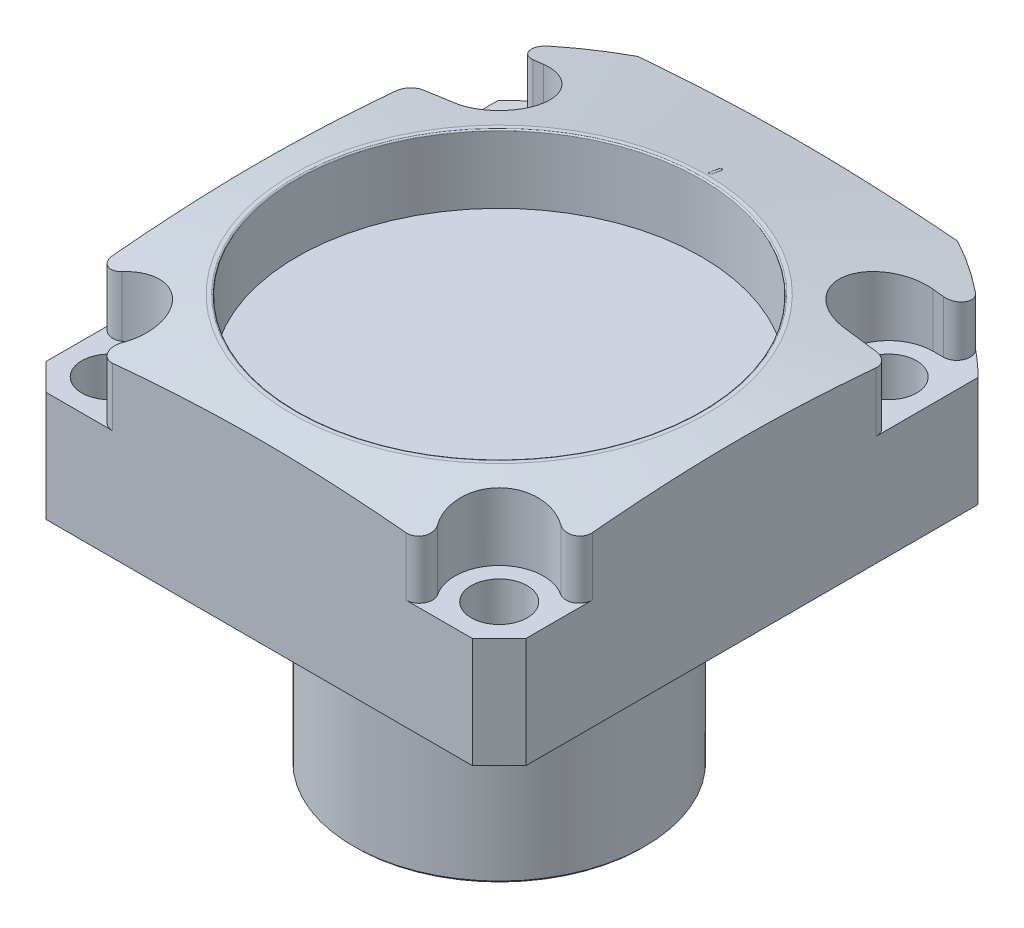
ISO-10303-21;
HEADER;
FILE_DESCRIPTION(('STEP AP214'),'2;1');
FILE_NAME('part.step','',(''),(''),'','','');
FILE_SCHEMA(('AUTOMOTIVE_DESIGN { 1 0 10303 214 1 1 1 1 }'));
ENDSEC;
DATA;
#1=APPLICATION_CONTEXT('core data for automotive mechanical design processes');
#2=APPLICATION_PROTOCOL_DEFINITION('international standard','automotive_design',2000,#1);
#3=PRODUCT_CONTEXT('',#1,'mechanical');
#4=PRODUCT('Part','Part','',(#3));
#5=PRODUCT_RELATED_PRODUCT_CATEGORY('part','',(#4));
#6=PRODUCT_DEFINITION_FORMATION('','',#4);
#7=PRODUCT_DEFINITION_CONTEXT('part definition',#1,'design');
#8=PRODUCT_DEFINITION('design','',#6,#7);
#9=PRODUCT_DEFINITION_SHAPE('','',#8);
#10=(LENGTH_UNIT() NAMED_UNIT(*) SI_UNIT(.MILLI.,.METRE.));
#11=(NAMED_UNIT(*) PLANE_ANGLE_UNIT() SI_UNIT($,.RADIAN.));
#12=(NAMED_UNIT(*) SI_UNIT($,.STERADIAN.) SOLID_ANGLE_UNIT());
#13=UNCERTAINTY_MEASURE_WITH_UNIT(LENGTH_MEASURE(1.E-05),#10,'distance_accuracy_value','');
#14=(GEOMETRIC_REPRESENTATION_CONTEXT(3) GLOBAL_UNCERTAINTY_ASSIGNED_CONTEXT((#13)) GLOBAL_UNIT_ASSIGNED_CONTEXT((#10,
#11,#12)) REPRESENTATION_CONTEXT('',''));
#15=CARTESIAN_POINT('',(0.,0.,0.));
#16=DIRECTION('',(0.,0.,1.));
#17=DIRECTION('',(1.,0.,0.));
#18=AXIS2_PLACEMENT_3D('',#15,#16,#17);
#19=CARTESIAN_POINT('',(18.,0.876299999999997,-46.7614));
#20=DIRECTION('',(0.,1.,0.));
#21=DIRECTION('',(0.,0.,1.));
#22=AXIS2_PLACEMENT_3D('',#19,#20,#21);
#23=TOROIDAL_SURFACE('',#22,6.3373,1.7653);
#24=CARTESIAN_POINT('',(18.,0.876299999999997,-38.6588));
#25=VERTEX_POINT('',#24);
#26=VERTEX_LOOP('',#25);
#27=FACE_BOUND('',#26,.T.);
#28=ADVANCED_FACE('F36',(#27),#23,.T.);
#29=CLOSED_SHELL('',(#28));
#30=MANIFOLD_SOLID_BREP('B2',#29);
#31=CARTESIAN_POINT('',(-18.,0.876299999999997,-46.7614));
#32=DIRECTION('',(0.,1.,0.));
#33=DIRECTION('',(0.,0.,1.));
#34=AXIS2_PLACEMENT_3D('',#31,#32,#33);
#35=TOROIDAL_SURFACE('',#34,6.3373,1.7653);
#36=CARTESIAN_POINT('',(-18.,0.876299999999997,-38.6588));
#37=VERTEX_POINT('',#36);
#38=VERTEX_LOOP('',#37);
#39=FACE_BOUND('',#38,.T.);
#40=ADVANCED_FACE('F58',(#39),#35,.T.);
#41=CLOSED_SHELL('',(#40));
#42=MANIFOLD_SOLID_BREP('B7',#41);
#43=CARTESIAN_POINT('',(0.,29.7192952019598,0.));
#44=DIRECTION('',(0.,-1.,0.));
#45=DIRECTION('',(0.,0.,-1.));
#46=AXIS2_PLACEMENT_3D('',#43,#44,#45);
#47=CONICAL_SURFACE('',#46,63.5,1.39626340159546);
#48=CARTESIAN_POINT('',(-0.10217073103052,33.8916063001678,-39.8375169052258));
#49=CARTESIAN_POINT('',(-0.114985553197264,33.8925994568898,-39.8318516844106));
#50=CARTESIAN_POINT('',(-0.127300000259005,33.8937832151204,-39.8251003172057));
#51=CARTESIAN_POINT('',(-0.150599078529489,33.8964898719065,-39.8096686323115));
#52=CARTESIAN_POINT('',(-0.16158476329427,33.8980124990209,-39.8009898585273));
#53=CARTESIAN_POINT('',(-0.181923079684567,33.9013572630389,-39.7819328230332));
#54=CARTESIAN_POINT('',(-0.191275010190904,33.903179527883,-39.7715538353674));
#55=CARTESIAN_POINT('',(-0.208076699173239,33.9070708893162,-39.7494001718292));
#56=CARTESIAN_POINT('',(-0.215526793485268,33.9091399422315,-39.7376257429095));
#57=CARTESIAN_POINT('',(-0.228319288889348,33.9134678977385,-39.7130088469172));
#58=CARTESIAN_POINT('',(-0.233660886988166,33.915726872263,-39.7001659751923));
#59=CARTESIAN_POINT('',(-0.242083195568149,33.9203706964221,-39.6737785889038));
#60=CARTESIAN_POINT('',(-0.245163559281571,33.922755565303,-39.6602339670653));
#61=CARTESIAN_POINT('',(-0.24897818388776,33.9275867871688,-39.6328104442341));
#62=CARTESIAN_POINT('',(-0.249709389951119,33.9300332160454,-39.6189311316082));
#63=CARTESIAN_POINT('',(-0.248796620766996,33.9349151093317,-39.5912497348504));
#64=CARTESIAN_POINT('',(-0.247152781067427,33.9373505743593,-39.5774476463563));
#65=CARTESIAN_POINT('',(-0.241534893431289,33.9421427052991,-39.5503042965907));
#66=CARTESIAN_POINT('',(-0.237559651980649,33.9444993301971,-39.5369632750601));
#67=CARTESIAN_POINT('',(-0.227389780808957,33.9490651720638,-39.5111284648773));
#68=CARTESIAN_POINT('',(-0.22119510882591,33.9512743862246,-39.4986346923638));
#69=CARTESIAN_POINT('',(-0.206765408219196,33.9554806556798,-39.4748575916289));
#70=CARTESIAN_POINT('',(-0.198531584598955,33.9574778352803,-39.4635735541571));
#71=CARTESIAN_POINT('',(-0.180254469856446,33.9612038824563,-39.4425295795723));
#72=CARTESIAN_POINT('',(-0.170211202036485,33.9629327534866,-39.4327696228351));
#73=CARTESIAN_POINT('',(-0.148615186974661,33.9660698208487,-39.4150655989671));
#74=CARTESIAN_POINT('',(-0.137064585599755,33.9674784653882,-39.4071189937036));
#75=CARTESIAN_POINT('',(-0.112770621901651,33.969937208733,-39.393251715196));
#76=CARTESIAN_POINT('',(-0.100027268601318,33.9709873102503,-39.3873310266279));
#77=CARTESIAN_POINT('',(-0.0737317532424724,33.9726968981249,-39.3776934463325));
#78=CARTESIAN_POINT('',(-0.0601809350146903,33.973357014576,-39.3739729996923));
#79=CARTESIAN_POINT('',(-0.0326369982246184,33.9742699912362,-39.3688277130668));
#80=CARTESIAN_POINT('',(-0.0186438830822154,33.9745228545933,-39.3674028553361));
#81=CARTESIAN_POINT('',(0.00937087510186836,33.9746138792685,-39.3668899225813));
#82=CARTESIAN_POINT('',(0.0233924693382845,33.9744524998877,-39.3677992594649));
#83=CARTESIAN_POINT('',(0.0510814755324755,33.9737207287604,-39.3719231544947));
#84=CARTESIAN_POINT('',(0.0647488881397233,33.973150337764,-39.3751377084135));
#85=CARTESIAN_POINT('',(0.0913404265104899,33.9716172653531,-39.3837795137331));
#86=CARTESIAN_POINT('',(0.104264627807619,33.9706546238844,-39.3892065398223));
#87=CARTESIAN_POINT('',(0.129005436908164,33.9683650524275,-39.4021181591));
#88=CARTESIAN_POINT('',(0.140822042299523,33.9670381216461,-39.4096027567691));
#89=CARTESIAN_POINT('',(0.163024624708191,33.9640569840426,-39.4264241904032));
#90=CARTESIAN_POINT('',(0.173409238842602,33.9624024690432,-39.4357627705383));
#91=CARTESIAN_POINT('',(0.19244198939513,33.9588146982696,-39.4560219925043));
#92=CARTESIAN_POINT('',(0.20109010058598,33.9568814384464,-39.4669426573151));
#93=CARTESIAN_POINT('',(0.216418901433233,33.9527884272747,-39.490074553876));
#94=CARTESIAN_POINT('',(0.223096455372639,33.9506283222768,-39.5022878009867));
#95=CARTESIAN_POINT('',(0.234277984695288,33.9461460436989,-39.5276437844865));
#96=CARTESIAN_POINT('',(0.238781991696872,33.943823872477,-39.5407865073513));
#97=CARTESIAN_POINT('',(0.245495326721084,33.9390800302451,-39.5676495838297));
#98=CARTESIAN_POINT('',(0.247701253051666,33.9366582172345,-39.5813707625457));
#99=CARTESIAN_POINT('',(0.24974478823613,33.9317869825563,-39.6089846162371));
#100=CARTESIAN_POINT('',(0.249582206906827,33.9293375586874,-39.6228773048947));
#101=CARTESIAN_POINT('',(0.246891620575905,33.9244786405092,-39.6504509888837));
#102=CARTESIAN_POINT('',(0.244361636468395,33.9220691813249,-39.6641317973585));
#103=CARTESIAN_POINT('',(0.237005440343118,33.9173609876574,-39.690878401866));
#104=CARTESIAN_POINT('',(0.232179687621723,33.9150622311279,-39.7039443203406));
#105=CARTESIAN_POINT('',(0.220369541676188,33.9106407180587,-39.7290876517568));
#106=CARTESIAN_POINT('',(0.213385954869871,33.9085178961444,-39.7411654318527));
#107=CARTESIAN_POINT('',(0.197456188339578,33.9045064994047,-39.7639978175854));
#108=CARTESIAN_POINT('',(0.188509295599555,33.9026180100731,-39.7747519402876));
#109=CARTESIAN_POINT('',(0.167795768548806,33.8989334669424,-39.7957412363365));
#110=CARTESIAN_POINT('',(0.155825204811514,33.8971716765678,-39.8057821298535));
#111=CARTESIAN_POINT('',(0.130171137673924,33.8940617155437,-39.8235119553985));
#112=CARTESIAN_POINT('',(0.116484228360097,33.8927143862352,-39.8311961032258));
#113=CARTESIAN_POINT('',(0.102170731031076,33.8916063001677,-39.8375169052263));
#114=B_SPLINE_CURVE_WITH_KNOTS('',3,(#48,#49,#50,#51,#52,#53,#54,#55,#56,#57,#58,#59,#60,#61,
#62,#63,#64,#65,#66,#67,#68,#69,#70,#71,#72,#73,#74,#75,#76,#77,#78,#79,#80,#81,#82,#83,#84,#85,
#86,#87,#88,#89,#90,#91,#92,#93,#94,#95,#96,#97,#98,#99,#100,#101,#102,#103,#104,#105,#106,#107,
#108,#109,#110,#111,#112,#113),.UNSPECIFIED.,.F.,.F.,(4,2,2,2,2,2,2,2,2,2,2,2,2,2,2,2,2,2,2,2,2,
2,2,2,2,2,2,2,2,2,2,2,4),(0.,0.0420823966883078,0.0841312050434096,0.126198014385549,
0.168257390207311,0.210332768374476,0.252414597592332,0.294551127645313,0.336685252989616,
0.378840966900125,0.420997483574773,0.463129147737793,0.505260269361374,0.547332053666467,
0.589403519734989,0.631406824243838,0.673409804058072,0.715366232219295,0.757322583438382,
0.799274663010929,0.841226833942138,0.883218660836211,0.92521109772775,0.967270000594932,
1.0093282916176,1.0514487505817,1.09357259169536,1.13573167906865,1.17788233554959,
1.22001725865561,1.26216750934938,1.30905666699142,1.35604038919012),.UNSPECIFIED.);
#115=CARTESIAN_POINT('',(-0.249384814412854,33.9310643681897,-39.6130851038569));
#116=VERTEX_POINT('',#115);
#117=CARTESIAN_POINT('',(0.249384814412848,33.9310643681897,-39.6130851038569));
#118=VERTEX_POINT('',#117);
#119=EDGE_CURVE('E56',#116,#118,#114,.T.);
#120=ORIENTED_EDGE('',*,*,#119,.F.);
#121=CARTESIAN_POINT('',(-0.249406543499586,33.544309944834,-41.8065194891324));
#122=CARTESIAN_POINT('',(-0.249401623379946,33.6369207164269,-41.2812884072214));
#123=CARTESIAN_POINT('',(-0.249396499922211,33.7295314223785,-40.7560573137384));
#124=CARTESIAN_POINT('',(-0.249389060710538,33.8588681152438,-40.0225384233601));
#125=CARTESIAN_POINT('',(-0.249386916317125,33.8955941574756,-39.8142506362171));
#126=CARTESIAN_POINT('',(-0.249384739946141,33.9323201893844,-39.6059628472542));
#127=B_SPLINE_CURVE_WITH_KNOTS('',3,(#121,#122,#123,#124,#125,#126),.UNSPECIFIED.,.F.,.F.,(4,2,
4),(0.,1.60000000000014,2.23450251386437),.UNSPECIFIED.);
#128=CARTESIAN_POINT('',(-0.249404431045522,33.5837743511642,-41.5827017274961));
#129=VERTEX_POINT('',#128);
#130=EDGE_CURVE('E276',#129,#116,#127,.T.);
#131=ORIENTED_EDGE('',*,*,#130,.F.);
#132=CARTESIAN_POINT('',(0.249299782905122,33.5850304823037,-41.5755783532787));
#133=CARTESIAN_POINT('',(0.249718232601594,33.5825894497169,-41.5894196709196));
#134=CARTESIAN_POINT('',(0.248928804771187,33.5801442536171,-41.6032922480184));
#135=CARTESIAN_POINT('',(0.245009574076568,33.5753150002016,-41.6307041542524));
#136=CARTESIAN_POINT('',(0.241881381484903,33.5729309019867,-41.6442437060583));
#137=CARTESIAN_POINT('',(0.233358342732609,33.5682886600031,-41.6706201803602));
#138=CARTESIAN_POINT('',(0.227962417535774,33.5660305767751,-41.6834567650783));
#139=CARTESIAN_POINT('',(0.215060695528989,33.5617056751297,-41.7080533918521));
#140=CARTESIAN_POINT('',(0.207555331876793,33.5596388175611,-41.7198136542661));
#141=CARTESIAN_POINT('',(0.19064518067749,33.5557542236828,-41.7419252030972));
#142=CARTESIAN_POINT('',(0.181240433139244,33.5539364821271,-41.7522765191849));
#143=CARTESIAN_POINT('',(0.160796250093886,33.5506011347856,-41.7712760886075));
#144=CARTESIAN_POINT('',(0.149756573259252,33.5490835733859,-41.779924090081));
#145=CARTESIAN_POINT('',(0.12637481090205,33.5463938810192,-41.7952554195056));
#146=CARTESIAN_POINT('',(0.114034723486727,33.5452212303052,-41.8019417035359));
#147=CARTESIAN_POINT('',(0.0883896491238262,33.5432514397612,-41.8131750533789));
#148=CARTESIAN_POINT('',(0.0750847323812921,33.542454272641,-41.8177222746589));
#149=CARTESIAN_POINT('',(0.0479070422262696,33.5412586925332,-41.82454270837));
#150=CARTESIAN_POINT('',(0.0340350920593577,33.5408597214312,-41.8268191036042));
#151=CARTESIAN_POINT('',(0.00609978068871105,33.5404698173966,-41.8290437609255));
#152=CARTESIAN_POINT('',(-0.00796358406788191,33.5404788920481,-41.82899197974));
#153=CARTESIAN_POINT('',(-0.0358707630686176,33.5409046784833,-41.8265625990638));
#154=CARTESIAN_POINT('',(-0.0497147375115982,33.5413210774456,-41.8241867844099));
#155=CARTESIAN_POINT('',(-0.0768012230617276,33.5425493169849,-41.8171801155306));
#156=CARTESIAN_POINT('',(-0.0900437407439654,33.5433611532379,-41.8125492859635));
#157=CARTESIAN_POINT('',(-0.115555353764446,33.545357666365,-41.801163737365));
#158=CARTESIAN_POINT('',(-0.127824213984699,33.5465424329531,-41.7944085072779));
#159=CARTESIAN_POINT('',(-0.151037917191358,33.549251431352,-41.778967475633));
#160=CARTESIAN_POINT('',(-0.161982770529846,33.5507756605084,-41.7702816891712));
#161=CARTESIAN_POINT('',(-0.182250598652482,33.5541225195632,-41.75121702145));
#162=CARTESIAN_POINT('',(-0.191571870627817,33.5559454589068,-41.7408363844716));
#163=CARTESIAN_POINT('',(-0.208317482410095,33.55983783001,-41.7186811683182));
#164=CARTESIAN_POINT('',(-0.215741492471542,33.5619073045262,-41.7069063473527));
#165=CARTESIAN_POINT('',(-0.228494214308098,33.5662381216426,-41.6822767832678));
#166=CARTESIAN_POINT('',(-0.233818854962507,33.5684998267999,-41.669419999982));
#167=CARTESIAN_POINT('',(-0.242198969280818,33.5731472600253,-41.6430147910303));
#168=CARTESIAN_POINT('',(-0.2452566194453,33.5755328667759,-41.6294670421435));
#169=CARTESIAN_POINT('',(-0.248057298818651,33.5791188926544,-41.6091126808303));
#170=CARTESIAN_POINT('',(-0.248696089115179,33.5802992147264,-41.6024148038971));
#171=CARTESIAN_POINT('',(-0.249415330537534,33.5826633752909,-41.58900243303));
#172=CARTESIAN_POINT('',(-0.24949680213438,33.5838472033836,-41.5822879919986));
#173=CARTESIAN_POINT('',(-0.249299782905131,33.5850304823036,-41.575578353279));
#174=B_SPLINE_CURVE_WITH_KNOTS('',3,(#132,#133,#134,#135,#136,#137,#138,#139,#140,#141,#142,
#143,#144,#145,#146,#147,#148,#149,#150,#151,#152,#153,#154,#155,#156,#157,#158,#159,#160,#161,
#162,#163,#164,#165,#166,#167,#168,#169,#170,#171,#172,#173),.UNSPECIFIED.,.F.,.F.,(4,2,2,2,2,2,
2,2,2,2,2,2,2,2,2,2,2,2,2,2,4),(0.,0.042127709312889,0.0842264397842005,0.126345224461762,
0.168455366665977,0.210564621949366,0.252680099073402,0.294731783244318,0.336780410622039,
0.378770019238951,0.420760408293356,0.462718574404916,0.504676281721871,0.546644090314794,
0.588611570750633,0.63062280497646,0.672641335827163,0.714740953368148,0.756800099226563,
0.777273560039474,0.797709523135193),.UNSPECIFIED.);
#175=CARTESIAN_POINT('',(0.249404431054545,33.5837743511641,-41.5827017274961));
#176=VERTEX_POINT('',#175);
#177=EDGE_CURVE('E271',#176,#129,#174,.T.);
#178=ORIENTED_EDGE('',*,*,#177,.F.);
#179=CARTESIAN_POINT('',(0.249384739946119,33.9323201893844,-39.6059628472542));
#180=CARTESIAN_POINT('',(0.249390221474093,33.8397095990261,-40.1311939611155));
#181=CARTESIAN_POINT('',(0.249395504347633,33.7470989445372,-40.6564250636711));
#182=CARTESIAN_POINT('',(0.249402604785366,33.6177621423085,-41.3899439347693));
#183=CARTESIAN_POINT('',(0.249404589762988,33.5810360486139,-41.5982317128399));
#184=CARTESIAN_POINT('',(0.249406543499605,33.544309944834,-41.8065194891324));
#185=B_SPLINE_CURVE_WITH_KNOTS('',3,(#179,#180,#181,#182,#183,#184),.UNSPECIFIED.,.F.,.F.,(4,2,
4),(0.,1.60000000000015,2.23450251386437),.UNSPECIFIED.);
#186=EDGE_CURVE('E85',#118,#176,#185,.T.);
#187=ORIENTED_EDGE('',*,*,#186,.F.);
#188=EDGE_LOOP('',(#120,#131,#178,#187));
#189=FACE_BOUND('',#188,.T.);
#190=CARTESIAN_POINT('',(56.2837169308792,28.2254718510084,-44.8564000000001));
#191=CARTESIAN_POINT('',(54.7254730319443,28.4403020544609,-44.8564000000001));
#192=CARTESIAN_POINT('',(53.1667633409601,28.6518059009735,-44.8564000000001));
#193=CARTESIAN_POINT('',(50.0482663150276,29.0668445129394,-44.8564000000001));
#194=CARTESIAN_POINT('',(48.4884789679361,29.2703791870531,-44.8564000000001));
#195=CARTESIAN_POINT('',(45.3681691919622,29.6681003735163,-44.8564000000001));
#196=CARTESIAN_POINT('',(43.8076471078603,29.8622895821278,-44.8564000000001));
#197=CARTESIAN_POINT('',(40.6852788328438,30.2397599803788,-44.8564000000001));
#198=CARTESIAN_POINT('',(39.1234326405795,30.4230411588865,-44.8564000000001));
#199=CARTESIAN_POINT('',(35.9980221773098,30.7768452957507,-44.8564000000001));
#200=CARTESIAN_POINT('',(34.4344576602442,30.947366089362,-44.8564000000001));
#201=CARTESIAN_POINT('',(31.305782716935,31.2734442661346,-44.8564000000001));
#202=CARTESIAN_POINT('',(29.7406723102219,31.4290018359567,-44.8564000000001));
#203=CARTESIAN_POINT('',(26.6083658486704,31.7227709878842,-44.8564000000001));
#204=CARTESIAN_POINT('',(25.0411693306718,31.860977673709,-44.8564000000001));
#205=CARTESIAN_POINT('',(21.9050705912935,32.117359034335,-44.8564000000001));
#206=CARTESIAN_POINT('',(20.3361682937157,32.2355327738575,-44.8564000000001));
#207=CARTESIAN_POINT('',(18.766456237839,32.3423659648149,-44.8564000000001));
#208=B_SPLINE_CURVE_WITH_KNOTS('',3,(#190,#191,#192,#193,#194,#195,#196,#197,#198,#199,#200,
#201,#202,#203,#204,#205,#206,#207),.UNSPECIFIED.,.F.,.F.,(4,2,2,2,2,2,2,2,4),(0.,
4.71895657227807,9.43796721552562,14.1556081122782,18.8732538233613,23.5916980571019,
28.3100834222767,33.0297972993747,37.7497314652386),.UNSPECIFIED.);
#209=CARTESIAN_POINT('',(38.4800191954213,30.4951361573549,-44.8564000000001));
#210=VERTEX_POINT('',#209);
#211=CARTESIAN_POINT('',(36.5251999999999,30.7162065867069,-44.8564000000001));
#212=VERTEX_POINT('',#211);
#213=EDGE_CURVE('E768',#210,#212,#208,.T.);
#214=ORIENTED_EDGE('',*,*,#213,.F.);
#215=CARTESIAN_POINT('',(38.4800191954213,30.4951361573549,-44.8564000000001));
#216=CARTESIAN_POINT('',(38.5506887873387,30.4870237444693,-44.8563932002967));
#217=CARTESIAN_POINT('',(38.6213055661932,30.4784999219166,-44.8594094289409));
#218=CARTESIAN_POINT('',(38.7619264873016,30.4607041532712,-44.8714101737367));
#219=CARTESIAN_POINT('',(38.8319307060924,30.451432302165,-44.8803939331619));
#220=CARTESIAN_POINT('',(38.9707558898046,30.4322243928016,-44.9042379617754));
#221=CARTESIAN_POINT('',(39.0395781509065,30.4222891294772,-44.9190912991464));
#222=CARTESIAN_POINT('',(39.1756203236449,30.4018273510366,-44.9545325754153));
#223=CARTESIAN_POINT('',(39.2428402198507,30.3913008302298,-44.9751205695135));
#224=CARTESIAN_POINT('',(39.4414033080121,30.358951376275,-45.045269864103));
#225=CARTESIAN_POINT('',(39.5697629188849,30.336342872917,-45.1032360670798));
#226=CARTESIAN_POINT('',(39.8146450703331,30.2897580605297,-45.2397575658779));
#227=CARTESIAN_POINT('',(39.9311676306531,30.265781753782,-45.3183128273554));
#228=CARTESIAN_POINT('',(40.1503754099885,30.2168956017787,-45.4946560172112));
#229=CARTESIAN_POINT('',(40.2529137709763,30.191978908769,-45.5926249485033));
#230=CARTESIAN_POINT('',(40.4399174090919,30.1421451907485,-45.8045312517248));
#231=CARTESIAN_POINT('',(40.5243800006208,30.1172281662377,-45.9184709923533));
#232=CARTESIAN_POINT('',(40.673225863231,30.0679556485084,-46.1597825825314));
#233=CARTESIAN_POINT('',(40.7374984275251,30.0436039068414,-46.2872235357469));
#234=CARTESIAN_POINT('',(40.8434174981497,29.9962815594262,-46.5514221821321));
#235=CARTESIAN_POINT('',(40.8850652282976,29.9733108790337,-46.6881793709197));
#236=CARTESIAN_POINT('',(40.9442718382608,29.9294870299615,-46.966489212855));
#237=CARTESIAN_POINT('',(40.9619378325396,29.9086248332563,-47.1080176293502));
#238=CARTESIAN_POINT('',(40.9728422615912,29.8694833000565,-47.3923642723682));
#239=CARTESIAN_POINT('',(40.9660834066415,29.8512036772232,-47.5351823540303));
#240=CARTESIAN_POINT('',(40.9283901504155,29.8179460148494,-47.8161836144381));
#241=CARTESIAN_POINT('',(40.8977522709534,29.8029303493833,-47.9544021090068));
#242=CARTESIAN_POINT('',(40.8133562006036,29.7763358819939,-48.2240099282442));
#243=CARTESIAN_POINT('',(40.7595907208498,29.7647581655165,-48.3553970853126));
#244=CARTESIAN_POINT('',(40.631285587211,29.7455073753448,-48.6056366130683));
#245=CARTESIAN_POINT('',(40.5570348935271,29.7377839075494,-48.7246337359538));
#246=CARTESIAN_POINT('',(40.3895759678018,29.7262372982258,-48.9484627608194));
#247=CARTESIAN_POINT('',(40.2964043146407,29.7224067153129,-49.0533213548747));
#248=CARTESIAN_POINT('',(40.1718609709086,29.7201439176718,-49.171753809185));
#249=CARTESIAN_POINT('',(40.1480421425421,29.7198254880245,-49.1935344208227));
#250=CARTESIAN_POINT('',(40.0996082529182,29.719401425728,-49.2361243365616));
#251=CARTESIAN_POINT('',(40.0749943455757,29.7192954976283,-49.256934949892));
#252=CARTESIAN_POINT('',(40.0499783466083,29.7192952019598,-49.277268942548));
#253=B_SPLINE_CURVE_WITH_KNOTS('',3,(#215,#216,#217,#218,#219,#220,#221,#222,#223,#224,#225,
#226,#227,#228,#229,#230,#231,#232,#233,#234,#235,#236,#237,#238,#239,#240,#241,#242,#243,#244,
#245,#246,#247,#248,#249,#250,#251,#252),.UNSPECIFIED.,.F.,.F.,(4,2,2,2,2,2,2,2,2,2,2,2,2,2,2,2,
2,2,4),(0.,0.2133267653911,0.426626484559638,0.639675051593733,0.852725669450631,
1.27848394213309,1.70424150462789,2.13417310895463,2.56416854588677,2.99648217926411,
3.42877242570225,3.85912542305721,4.28943066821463,4.71447603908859,5.13965546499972,
5.55911964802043,5.97778049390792,6.07459930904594,6.17128341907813),.UNSPECIFIED.);
#254=CARTESIAN_POINT('',(40.0499783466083,29.7192952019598,-49.277268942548));
#255=VERTEX_POINT('',#254);
#256=EDGE_CURVE('E906',#210,#255,#253,.T.);
#257=ORIENTED_EDGE('',*,*,#256,.T.);
#258=CARTESIAN_POINT('',(0.,29.7192952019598,0.));
#259=DIRECTION('',(0.,-1.,0.));
#260=DIRECTION('',(0.,0.,-1.));
#261=AXIS2_PLACEMENT_3D('',#258,#259,#260);
#262=CIRCLE('',#261,63.5);
#263=CARTESIAN_POINT('',(29.9718277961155,29.7192952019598,-55.9816));
#264=VERTEX_POINT('',#263);
#265=EDGE_CURVE('E532',#264,#255,#262,.T.);
#266=ORIENTED_EDGE('',*,*,#265,.F.);
#267=CARTESIAN_POINT('',(-98.769265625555,20.8974649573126,-55.9816));
#268=CARTESIAN_POINT('',(-97.412355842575,21.1056120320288,-55.9816));
#269=CARTESIAN_POINT('',(-96.0552908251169,21.3127466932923,-55.9816));
#270=CARTESIAN_POINT('',(-93.3408189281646,21.724771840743,-55.9816));
#271=CARTESIAN_POINT('',(-91.9834120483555,21.9296623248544,-55.9816));
#272=CARTESIAN_POINT('',(-87.9106055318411,22.5406423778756,-55.9816));
#273=CARTESIAN_POINT('',(-85.1946497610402,22.9430359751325,-55.9816));
#274=CARTESIAN_POINT('',(-79.7605886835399,23.7358357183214,-55.9816));
#275=CARTESIAN_POINT('',(-77.0424831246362,24.126240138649,-55.9816));
#276=CARTESIAN_POINT('',(-71.604179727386,24.8921938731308,-55.9816));
#277=CARTESIAN_POINT('',(-68.8839818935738,25.267743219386,-55.9816));
#278=CARTESIAN_POINT('',(-63.448716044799,25.9993740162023,-55.9816));
#279=CARTESIAN_POINT('',(-60.7336549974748,26.355507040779,-55.9816));
#280=CARTESIAN_POINT('',(-55.3006122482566,27.044897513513,-55.9816));
#281=CARTESIAN_POINT('',(-52.5826305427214,27.3781549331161,-55.9816));
#282=CARTESIAN_POINT('',(-47.1429977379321,28.0161087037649,-55.9816));
#283=CARTESIAN_POINT('',(-44.421346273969,28.3208019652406,-55.9816));
#284=CARTESIAN_POINT('',(-38.9742469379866,28.8945382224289,-55.9816));
#285=CARTESIAN_POINT('',(-36.2487990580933,29.1635811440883,-55.9816));
#286=CARTESIAN_POINT('',(-30.7797960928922,29.658985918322,-55.9816));
#287=CARTESIAN_POINT('',(-28.0362201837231,29.885120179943,-55.9816));
#288=CARTESIAN_POINT('',(-22.5450981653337,30.283716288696,-55.9816));
#289=CARTESIAN_POINT('',(-19.7975520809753,30.4561784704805,-55.9816));
#290=CARTESIAN_POINT('',(-15.6743539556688,30.6679954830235,-55.9816));
#291=CARTESIAN_POINT('',(-14.2998848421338,30.7307814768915,-55.9816));
#292=CARTESIAN_POINT('',(-11.5502843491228,30.839846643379,-55.9816));
#293=CARTESIAN_POINT('',(-10.1751529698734,30.8861258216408,-55.9816));
#294=CARTESIAN_POINT('',(-7.42442631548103,30.961442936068,-55.9816));
#295=CARTESIAN_POINT('',(-6.04883104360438,30.9904809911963,-55.9816));
#296=CARTESIAN_POINT('',(-3.29737906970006,31.0308388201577,-55.9816));
#297=CARTESIAN_POINT('',(-1.92152236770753,31.0421585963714,-55.9816));
#298=CARTESIAN_POINT('',(0.832515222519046,31.0468915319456,-55.9816));
#299=CARTESIAN_POINT('',(2.21069616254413,31.0402748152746,-55.9816));
#300=CARTESIAN_POINT('',(4.96685516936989,31.0091843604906,-55.9816));
#301=CARTESIAN_POINT('',(6.34483323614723,30.9847106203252,-55.9816));
#302=CARTESIAN_POINT('',(9.10037723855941,30.9183129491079,-55.9816));
#303=CARTESIAN_POINT('',(10.4779431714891,30.8763889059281,-55.9816));
#304=CARTESIAN_POINT('',(13.2324531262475,30.7757687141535,-55.9816));
#305=CARTESIAN_POINT('',(14.6093971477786,30.7170725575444,-55.9816));
#306=CARTESIAN_POINT('',(18.7401155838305,30.5170640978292,-55.9816));
#307=CARTESIAN_POINT('',(21.4927655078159,30.3518573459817,-55.9816));
#308=CARTESIAN_POINT('',(25.6187331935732,30.0627607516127,-55.9816));
#309=CARTESIAN_POINT('',(26.9935614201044,29.9595135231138,-55.9816));
#310=CARTESIAN_POINT('',(29.7422227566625,29.7404362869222,-55.9816));
#311=CARTESIAN_POINT('',(31.1160558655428,29.6246062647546,-55.9816));
#312=CARTESIAN_POINT('',(34.1822655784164,29.3532264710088,-55.9816));
#313=CARTESIAN_POINT('',(35.8743783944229,29.194705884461,-55.9816));
#314=CARTESIAN_POINT('',(39.25710605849,28.862348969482,-55.9816));
#315=CARTESIAN_POINT('',(40.9477208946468,28.6885125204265,-55.9816));
#316=CARTESIAN_POINT('',(44.327569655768,28.3274167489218,-55.9816));
#317=CARTESIAN_POINT('',(46.0168035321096,28.1401569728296,-55.9816));
#318=CARTESIAN_POINT('',(49.3939245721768,27.7539283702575,-55.9816));
#319=CARTESIAN_POINT('',(51.0818117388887,27.5549595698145,-55.9816));
#320=CARTESIAN_POINT('',(54.4565936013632,27.146792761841,-55.9816));
#321=CARTESIAN_POINT('',(56.1434881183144,26.9375932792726,-55.9816));
#322=CARTESIAN_POINT('',(59.516150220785,26.5103101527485,-55.9816));
#323=CARTESIAN_POINT('',(61.2019178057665,26.2922265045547,-55.9816));
#324=CARTESIAN_POINT('',(64.5724037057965,25.8483231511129,-55.9816));
#325=CARTESIAN_POINT('',(66.2571220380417,25.6225035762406,-55.9816));
#326=CARTESIAN_POINT('',(69.6256395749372,25.1641033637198,-55.9816));
#327=CARTESIAN_POINT('',(71.309438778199,24.9315227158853,-55.9816));
#328=CARTESIAN_POINT('',(76.3613624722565,24.2246969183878,-55.9816));
#329=CARTESIAN_POINT('',(79.7282495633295,23.7416020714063,-55.9816));
#330=CARTESIAN_POINT('',(86.459365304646,22.7572622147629,-55.9816));
#331=CARTESIAN_POINT('',(89.8235939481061,22.2560171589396,-55.9816));
#332=CARTESIAN_POINT('',(96.5496102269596,21.2393824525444,-55.9816));
#333=CARTESIAN_POINT('',(99.9113980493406,20.7239940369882,-55.9816));
#334=CARTESIAN_POINT('',(106.633227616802,19.6819983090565,-55.9816));
#335=CARTESIAN_POINT('',(109.993269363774,19.155391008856,-55.9816));
#336=CARTESIAN_POINT('',(116.697998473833,18.0953895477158,-55.9816));
#337=CARTESIAN_POINT('',(120.042691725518,17.5620325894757,-55.9816));
#338=CARTESIAN_POINT('',(126.730916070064,16.4880844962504,-55.9816));
#339=CARTESIAN_POINT('',(130.074447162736,15.9474933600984,-55.9816));
#340=CARTESIAN_POINT('',(136.760628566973,14.8603614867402,-55.9816));
#341=CARTESIAN_POINT('',(140.103278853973,14.313820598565,-55.9816));
#342=CARTESIAN_POINT('',(146.787771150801,13.2158174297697,-55.9816));
#343=CARTESIAN_POINT('',(150.129613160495,12.6643551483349,-55.9816));
#344=CARTESIAN_POINT('',(156.80802731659,11.5580717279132,-55.9816));
#345=CARTESIAN_POINT('',(160.144600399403,11.0032562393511,-55.9816));
#346=CARTESIAN_POINT('',(166.817167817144,9.89015515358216,-55.9816));
#347=CARTESIAN_POINT('',(170.153162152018,9.33186955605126,-55.9816));
#348=CARTESIAN_POINT('',(176.824548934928,8.21236600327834,-55.9816));
#349=CARTESIAN_POINT('',(180.159941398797,7.65114814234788,-55.9816));
#350=CARTESIAN_POINT('',(186.830295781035,6.52616695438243,-55.9816));
#351=CARTESIAN_POINT('',(190.165257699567,5.962403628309,-55.9816));
#352=CARTESIAN_POINT('',(193.500037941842,5.39756965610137,-55.9816));
#353=B_SPLINE_CURVE_WITH_KNOTS('',3,(#267,#268,#269,#270,#271,#272,#273,#274,#275,#276,#277,
#278,#279,#280,#281,#282,#283,#284,#285,#286,#287,#288,#289,#290,#291,#292,#293,#294,#295,#296,
#297,#298,#299,#300,#301,#302,#303,#304,#305,#306,#307,#308,#309,#310,#311,#312,#313,#314,#315,
#316,#317,#318,#319,#320,#321,#322,#323,#324,#325,#326,#327,#328,#329,#330,#331,#332,#333,#334,
#335,#336,#337,#338,#339,#340,#341,#342,#343,#344,#345,#346,#347,#348,#349,#350,#351,#352),
.UNSPECIFIED.,.F.,.F.,(4,2,2,2,2,2,2,2,2,2,2,2,2,2,2,2,2,2,2,2,2,2,2,2,2,2,2,2,2,2,2,2,2,2,2,2,
2,2,2,2,2,2,4),(0.,4.11834412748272,8.23669206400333,16.4734782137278,24.7114443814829,
32.9493927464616,41.164270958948,49.3791594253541,57.5949354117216,65.8107284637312,
74.0689499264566,82.3271198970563,86.4547440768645,90.5823668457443,94.7099611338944,
98.8375548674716,102.972027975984,107.106501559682,111.241001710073,115.375503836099,
123.647540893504,127.783600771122,131.919665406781,137.018150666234,142.116676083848,
147.215373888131,152.314060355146,157.413484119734,162.512910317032,167.612250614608,
172.711598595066,182.915631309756,193.119689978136,203.322860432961,213.52601981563,
223.686865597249,233.84771301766,244.008818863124,254.169926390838,264.317084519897,
274.46424359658,284.61107829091,294.757909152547),.UNSPECIFIED.);
#354=CARTESIAN_POINT('',(-29.9718277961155,29.7192952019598,-55.9816));
#355=VERTEX_POINT('',#354);
#356=EDGE_CURVE('E597',#264,#355,#353,.F.);
#357=ORIENTED_EDGE('',*,*,#356,.T.);
#358=CARTESIAN_POINT('',(-40.0499783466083,29.7192952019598,-49.277268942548));
#359=VERTEX_POINT('',#358);
#360=EDGE_CURVE('E531',#359,#355,#262,.T.);
#361=ORIENTED_EDGE('',*,*,#360,.F.);
#362=CARTESIAN_POINT('',(-40.0499783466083,29.7192952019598,-49.277268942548));
#363=CARTESIAN_POINT('',(-40.1037526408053,29.7192941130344,-49.2335733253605));
#364=CARTESIAN_POINT('',(-40.1556904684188,29.719785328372,-49.1876236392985));
#365=CARTESIAN_POINT('',(-40.2555449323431,29.7217439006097,-49.0915710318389));
#366=CARTESIAN_POINT('',(-40.3034618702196,29.7232111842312,-49.0414684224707));
#367=CARTESIAN_POINT('',(-40.3948848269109,29.7271113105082,-48.93751465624));
#368=CARTESIAN_POINT('',(-40.4383955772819,29.7295431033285,-48.8836676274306));
#369=CARTESIAN_POINT('',(-40.5207550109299,29.735352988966,-48.772590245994));
#370=CARTESIAN_POINT('',(-40.5596037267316,29.7387310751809,-48.7153599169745));
#371=CARTESIAN_POINT('',(-40.6687635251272,29.7502571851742,-48.539150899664));
#372=CARTESIAN_POINT('',(-40.7317393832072,29.7597992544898,-48.415595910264));
#373=CARTESIAN_POINT('',(-40.8362350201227,29.7823255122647,-48.1601178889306));
#374=CARTESIAN_POINT('',(-40.8777568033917,29.7953093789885,-48.0281956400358));
#375=CARTESIAN_POINT('',(-40.9385851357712,29.8244619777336,-47.758806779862));
#376=CARTESIAN_POINT('',(-40.9577565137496,29.8406494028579,-47.6213115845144));
#377=CARTESIAN_POINT('',(-40.9730537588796,29.8757271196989,-47.3453760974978));
#378=CARTESIAN_POINT('',(-40.9691750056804,29.8946179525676,-47.2069356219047));
#379=CARTESIAN_POINT('',(-40.9384352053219,29.9348701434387,-46.9310890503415));
#380=CARTESIAN_POINT('',(-40.9112686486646,29.9562610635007,-46.7937213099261));
#381=CARTESIAN_POINT('',(-40.834451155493,30.0007325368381,-46.5257207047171));
#382=CARTESIAN_POINT('',(-40.7847998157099,30.0238131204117,-46.3950879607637));
#383=CARTESIAN_POINT('',(-40.6636726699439,30.0713687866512,-46.1424107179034));
#384=CARTESIAN_POINT('',(-40.5919126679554,30.0958584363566,-46.0205051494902));
#385=CARTESIAN_POINT('',(-40.4288771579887,30.1452712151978,-45.7906315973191));
#386=CARTESIAN_POINT('',(-40.3376013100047,30.1701943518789,-45.6826638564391));
#387=CARTESIAN_POINT('',(-40.137319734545,30.2199715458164,-45.4829060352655));
#388=CARTESIAN_POINT('',(-40.0281836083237,30.2448236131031,-45.3912461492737));
#389=CARTESIAN_POINT('',(-39.7956920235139,30.2935545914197,-45.2277428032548));
#390=CARTESIAN_POINT('',(-39.6723313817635,30.3174331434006,-45.1559065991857));
#391=CARTESIAN_POINT('',(-39.415041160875,30.3634658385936,-45.0343028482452));
#392=CARTESIAN_POINT('',(-39.2811213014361,30.3856215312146,-44.9845152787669));
#393=CARTESIAN_POINT('',(-39.0065188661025,30.4275200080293,-44.9085663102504));
#394=CARTESIAN_POINT('',(-38.865848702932,30.4472670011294,-44.8823631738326));
#395=CARTESIAN_POINT('',(-38.6834450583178,30.4706803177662,-44.8643896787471));
#396=CARTESIAN_POINT('',(-38.6428067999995,30.4757585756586,-44.8613932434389));
#397=CARTESIAN_POINT('',(-38.5614626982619,30.4856476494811,-44.8574011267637));
#398=CARTESIAN_POINT('',(-38.5207570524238,30.4904588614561,-44.8564024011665));
#399=CARTESIAN_POINT('',(-38.4800191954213,30.4951361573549,-44.8564000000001));
#400=B_SPLINE_CURVE_WITH_KNOTS('',3,(#362,#363,#364,#365,#366,#367,#368,#369,#370,#371,#372,
#373,#374,#375,#376,#377,#378,#379,#380,#381,#382,#383,#384,#385,#386,#387,#388,#389,#390,#391,
#392,#393,#394,#395,#396,#397,#398,#399),.UNSPECIFIED.,.F.,.F.,(4,2,2,2,2,2,2,2,2,2,2,2,2,2,2,2,
2,2,4),(0.,0.207798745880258,0.415581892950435,0.623139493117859,0.830695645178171,
1.24557823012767,1.66042204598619,2.07776195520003,2.49518552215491,2.91817051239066,
3.34116308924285,3.76983746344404,4.19851930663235,4.63048337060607,5.06260533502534,
5.49433407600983,5.92529727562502,6.04845585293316,6.17142661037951),.UNSPECIFIED.);
#401=CARTESIAN_POINT('',(-38.4800191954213,30.4951361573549,-44.8564000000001));
#402=VERTEX_POINT('',#401);
#403=EDGE_CURVE('E913',#359,#402,#400,.T.);
#404=ORIENTED_EDGE('',*,*,#403,.T.);
#405=CARTESIAN_POINT('',(-25.0528460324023,31.856657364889,-44.8564000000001));
#406=CARTESIAN_POINT('',(-26.6201576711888,31.7218619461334,-44.8564000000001));
#407=CARTESIAN_POINT('',(-28.1866240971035,31.5775734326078,-44.8564000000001));
#408=CARTESIAN_POINT('',(-31.3178926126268,31.2724104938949,-44.8564000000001));
#409=CARTESIAN_POINT('',(-32.8826947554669,31.1115366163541,-44.8564000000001));
#410=CARTESIAN_POINT('',(-36.0104723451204,30.7756253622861,-44.8564000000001));
#411=CARTESIAN_POINT('',(-37.5734480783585,30.6005906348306,-44.8564000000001));
#412=CARTESIAN_POINT('',(-40.6980033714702,30.2383892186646,-44.8564000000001));
#413=CARTESIAN_POINT('',(-42.2595829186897,30.0512224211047,-44.8564000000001));
#414=CARTESIAN_POINT('',(-45.381286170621,29.6665747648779,-44.8564000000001));
#415=CARTESIAN_POINT('',(-46.9414100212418,29.4690950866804,-44.8564000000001));
#416=CARTESIAN_POINT('',(-50.0605126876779,29.0653231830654,-44.8564000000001));
#417=CARTESIAN_POINT('',(-51.6194915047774,28.8590309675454,-44.8564000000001));
#418=CARTESIAN_POINT('',(-54.7367331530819,28.4388907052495,-44.8564000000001));
#419=CARTESIAN_POINT('',(-56.2949957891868,28.2250412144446,-44.8564000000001));
#420=CARTESIAN_POINT('',(-59.4106089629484,27.7908706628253,-44.8564000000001));
#421=CARTESIAN_POINT('',(-60.9679595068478,27.5705496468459,-44.8564000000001));
#422=CARTESIAN_POINT('',(-62.5249166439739,27.3475147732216,-44.8564000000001));
#423=B_SPLINE_CURVE_WITH_KNOTS('',3,(#405,#406,#407,#408,#409,#410,#411,#412,#413,#414,#415,
#416,#417,#418,#419,#420,#421,#422),.UNSPECIFIED.,.F.,.F.,(4,2,2,2,2,2,2,2,4),(0.,
4.71922199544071,9.43828821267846,14.1564736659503,18.8747014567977,23.5923903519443,
28.3100739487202,33.0286639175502,37.747221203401),.UNSPECIFIED.);
#424=CARTESIAN_POINT('',(-36.5251999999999,30.7162065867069,-44.8564000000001));
#425=VERTEX_POINT('',#424);
#426=EDGE_CURVE('E703',#425,#402,#423,.T.);
#427=ORIENTED_EDGE('',*,*,#426,.F.);
#428=CARTESIAN_POINT('',(-36.5253999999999,32.7801273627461,-28.1940000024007));
#429=CARTESIAN_POINT('',(-36.2940284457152,32.812425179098,-28.1939706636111));
#430=CARTESIAN_POINT('',(-36.0624930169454,32.8435885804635,-28.2036264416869));
#431=CARTESIAN_POINT('',(-35.6006898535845,32.9033462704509,-28.2422198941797));
#432=CARTESIAN_POINT('',(-35.3704221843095,32.9319404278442,-28.2711585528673));
#433=CARTESIAN_POINT('',(-34.9127795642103,32.9862553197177,-28.3482284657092));
#434=CARTESIAN_POINT('',(-34.6854045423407,33.0119761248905,-28.3963592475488));
#435=CARTESIAN_POINT('',(-34.2351654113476,33.0602617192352,-28.5115478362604));
#436=CARTESIAN_POINT('',(-34.0123011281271,33.0828266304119,-28.5786049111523));
#437=CARTESIAN_POINT('',(-33.5724638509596,33.124562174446,-28.731324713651));
#438=CARTESIAN_POINT('',(-33.3554968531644,33.1437294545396,-28.8170056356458));
#439=CARTESIAN_POINT('',(-32.9292673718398,33.1784125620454,-29.0063872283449));
#440=CARTESIAN_POINT('',(-32.7200049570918,33.1939283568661,-29.1100880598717));
#441=CARTESIAN_POINT('',(-32.3108297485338,33.2211091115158,-29.3347600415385));
#442=CARTESIAN_POINT('',(-32.1109126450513,33.2327758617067,-29.455723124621));
#443=CARTESIAN_POINT('',(-31.721814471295,33.2521194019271,-29.7141120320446));
#444=CARTESIAN_POINT('',(-31.5326332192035,33.2597962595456,-29.8515375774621));
#445=CARTESIAN_POINT('',(-31.1687139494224,33.2709897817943,-30.1400459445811));
#446=CARTESIAN_POINT('',(-30.993824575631,33.2745574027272,-30.2909359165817));
#447=CARTESIAN_POINT('',(-30.6571590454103,33.277659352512,-30.606732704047));
#448=CARTESIAN_POINT('',(-30.4953827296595,33.2771937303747,-30.7716393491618));
#449=CARTESIAN_POINT('',(-30.186080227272,33.2722348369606,-31.1143094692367));
#450=CARTESIAN_POINT('',(-30.0385564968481,33.2677408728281,-31.292075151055));
#451=CARTESIAN_POINT('',(-29.7588377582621,33.2547819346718,-31.6591460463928));
#452=CARTESIAN_POINT('',(-29.6266427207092,33.2463169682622,-31.8484512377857));
#453=CARTESIAN_POINT('',(-29.3793172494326,33.2255916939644,-32.2359418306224));
#454=CARTESIAN_POINT('',(-29.2640801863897,33.2133567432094,-32.4340605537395));
#455=CARTESIAN_POINT('',(-29.0503697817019,33.1852184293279,-32.8389780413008));
#456=CARTESIAN_POINT('',(-28.951902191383,33.1693138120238,-33.0457797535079));
#457=CARTESIAN_POINT('',(-28.7724320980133,33.1340318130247,-33.466479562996));
#458=CARTESIAN_POINT('',(-28.6914253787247,33.1146552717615,-33.6803759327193));
#459=CARTESIAN_POINT('',(-28.547337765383,33.0726486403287,-34.113816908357));
#460=CARTESIAN_POINT('',(-28.4842574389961,33.0500184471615,-34.333361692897));
#461=CARTESIAN_POINT('',(-28.3758558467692,33.0015183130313,-34.7787398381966));
#462=CARTESIAN_POINT('',(-28.3307141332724,32.9756188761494,-35.004613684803));
#463=CARTESIAN_POINT('',(-28.2593064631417,32.9210348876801,-35.4589960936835));
#464=CARTESIAN_POINT('',(-28.2330410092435,32.8923502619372,-35.6875047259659));
#465=CARTESIAN_POINT('',(-28.1994865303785,32.8324921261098,-36.1455667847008));
#466=CARTESIAN_POINT('',(-28.1921960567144,32.8013188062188,-36.3751201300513));
#467=CARTESIAN_POINT('',(-28.1965581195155,32.736773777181,-36.8338112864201));
#468=CARTESIAN_POINT('',(-28.2082169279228,32.7034013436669,-37.0629489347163));
#469=CARTESIAN_POINT('',(-28.2507287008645,32.6341388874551,-37.5234307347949));
#470=CARTESIAN_POINT('',(-28.2819330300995,32.5982136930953,-37.7547371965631));
#471=CARTESIAN_POINT('',(-28.3635652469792,32.5247362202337,-38.213671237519));
#472=CARTESIAN_POINT('',(-28.413993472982,32.4871839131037,-38.4412987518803));
#473=CARTESIAN_POINT('',(-28.5336832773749,32.4107662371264,-38.8913760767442));
#474=CARTESIAN_POINT('',(-28.6029490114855,32.3719005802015,-39.1138247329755));
#475=CARTESIAN_POINT('',(-28.75976566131,32.2931927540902,-39.5519205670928));
#476=CARTESIAN_POINT('',(-28.8473109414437,32.2533508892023,-39.767569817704));
#477=CARTESIAN_POINT('',(-29.0416566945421,32.1723262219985,-40.1941655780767));
#478=CARTESIAN_POINT('',(-29.14874977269,32.1311321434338,-40.4049766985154));
#479=CARTESIAN_POINT('',(-29.3804185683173,32.0483547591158,-40.8166780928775));
#480=CARTESIAN_POINT('',(-29.5049940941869,32.006771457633,-41.0175684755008));
#481=CARTESIAN_POINT('',(-29.7707498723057,31.9235159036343,-41.4080341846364));
#482=CARTESIAN_POINT('',(-29.9119304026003,31.8818436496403,-41.5976093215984));
#483=CARTESIAN_POINT('',(-30.2099042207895,31.7987012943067,-41.9641070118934));
#484=CARTESIAN_POINT('',(-30.3666972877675,31.7572311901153,-42.1410297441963));
#485=CARTESIAN_POINT('',(-30.6959180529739,31.6744907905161,-42.4821225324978));
#486=CARTESIAN_POINT('',(-30.86844423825,31.6332237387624,-42.6461983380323));
#487=CARTESIAN_POINT('',(-31.2269432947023,31.5514590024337,-42.9590125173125));
#488=CARTESIAN_POINT('',(-31.4129115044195,31.5109610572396,-43.1077561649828));
#489=CARTESIAN_POINT('',(-31.7971344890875,31.4309565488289,-43.3889446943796));
#490=CARTESIAN_POINT('',(-31.9953953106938,31.3914504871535,-43.5213814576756));
#491=CARTESIAN_POINT('',(-32.4027116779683,31.3136957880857,-43.7688710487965));
#492=CARTESIAN_POINT('',(-32.6117668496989,31.2754471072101,-43.8839244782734));
#493=CARTESIAN_POINT('',(-33.0385700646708,31.2005453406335,-44.0954621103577));
#494=CARTESIAN_POINT('',(-33.2562911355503,31.1638879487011,-44.1919992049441));
#495=CARTESIAN_POINT('',(-33.699436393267,31.0922676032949,-44.3661582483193));
#496=CARTESIAN_POINT('',(-33.9248603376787,31.0573045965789,-44.4437807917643));
#497=CARTESIAN_POINT('',(-34.381496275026,30.9893186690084,-44.5793968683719));
#498=CARTESIAN_POINT('',(-34.6127004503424,30.9562933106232,-44.6374155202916));
#499=CARTESIAN_POINT('',(-35.0794138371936,30.8923345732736,-44.7334468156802));
#500=CARTESIAN_POINT('',(-35.3149208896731,30.8614001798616,-44.7714692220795));
#501=CARTESIAN_POINT('',(-35.7132801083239,30.8112628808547,-44.8183387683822));
#502=CARTESIAN_POINT('',(-35.8754374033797,30.7914558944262,-44.8326176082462));
#503=CARTESIAN_POINT('',(-36.2001697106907,30.7529718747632,-44.8516440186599));
#504=CARTESIAN_POINT('',(-36.3627435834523,30.7342930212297,-44.8564073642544));
#505=CARTESIAN_POINT('',(-36.5253999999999,30.7161843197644,-44.8563999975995));
#506=B_SPLINE_CURVE_WITH_KNOTS('',3,(#428,#429,#430,#431,#432,#433,#434,#435,#436,#437,#438,
#439,#440,#441,#442,#443,#444,#445,#446,#447,#448,#449,#450,#451,#452,#453,#454,#455,#456,#457,
#458,#459,#460,#461,#462,#463,#464,#465,#466,#467,#468,#469,#470,#471,#472,#473,#474,#475,#476,
#477,#478,#479,#480,#481,#482,#483,#484,#485,#486,#487,#488,#489,#490,#491,#492,#493,#494,#495,
#496,#497,#498,#499,#500,#501,#502,#503,#504,#505),.UNSPECIFIED.,.F.,.F.,(4,2,2,2,2,2,2,2,2,2,2,
2,2,2,2,2,2,2,2,2,2,2,2,2,2,2,2,2,2,2,2,2,2,2,2,2,2,2,4),(0.,0.700650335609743,1.40133643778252,
2.10200529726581,2.8026470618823,3.5039764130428,4.20531202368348,4.90632095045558,
5.60731800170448,6.29952548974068,6.99172456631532,7.68404272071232,8.37635954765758,
9.06411786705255,9.75211158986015,10.4399389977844,11.1277881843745,11.8223585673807,
12.5169474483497,13.2114832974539,13.9062490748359,14.6138777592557,15.3215188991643,
16.0293162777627,16.7368957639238,17.456095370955,18.1752870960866,18.8944908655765,
19.6136844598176,20.3377377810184,21.0615412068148,21.7857035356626,22.5098407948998,
23.2318776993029,23.9538919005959,24.6749774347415,25.3957105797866,25.8874029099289,
26.378279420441),.UNSPECIFIED.);
#507=CARTESIAN_POINT('',(-36.5251999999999,32.7801552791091,-28.1940000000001));
#508=VERTEX_POINT('',#507);
#509=EDGE_CURVE('E559',#508,#425,#506,.T.);
#510=ORIENTED_EDGE('',*,*,#509,.F.);
#511=CARTESIAN_POINT('',(-62.7162222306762,28.7914452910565,-28.1940000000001));
#512=CARTESIAN_POINT('',(-61.1634575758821,29.0411337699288,-28.1940000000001));
#513=CARTESIAN_POINT('',(-59.6104563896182,29.2893636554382,-28.1940000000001));
#514=CARTESIAN_POINT('',(-56.5038663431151,29.782127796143,-28.1940000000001));
#515=CARTESIAN_POINT('',(-54.9502774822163,30.0266620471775,-28.1940000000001));
#516=CARTESIAN_POINT('',(-51.8425515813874,30.5112324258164,-28.1940000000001));
#517=CARTESIAN_POINT('',(-50.2884146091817,30.7512689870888,-28.1940000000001));
#518=CARTESIAN_POINT('',(-47.1792893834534,31.2258036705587,-28.1940000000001));
#519=CARTESIAN_POINT('',(-45.624301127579,31.4603017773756,-28.1940000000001));
#520=CARTESIAN_POINT('',(-42.5131676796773,31.9224004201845,-28.1940000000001));
#521=CARTESIAN_POINT('',(-40.9570224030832,32.1500003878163,-28.1940000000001));
#522=CARTESIAN_POINT('',(-37.8434885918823,32.5964715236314,-28.1940000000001));
#523=CARTESIAN_POINT('',(-36.2861000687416,32.8153427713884,-28.1940000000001));
#524=CARTESIAN_POINT('',(-33.9487965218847,33.1352974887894,-28.1940000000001));
#525=CARTESIAN_POINT('',(-33.1694533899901,33.2405620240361,-28.1940000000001));
#526=CARTESIAN_POINT('',(-31.6103465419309,33.4479218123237,-28.1940000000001));
#527=CARTESIAN_POINT('',(-30.8305828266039,33.5500170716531,-28.1940000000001));
#528=CARTESIAN_POINT('',(-29.2705689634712,33.7506222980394,-28.1940000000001));
#529=CARTESIAN_POINT('',(-28.4903188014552,33.8491321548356,-28.1940000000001));
#530=CARTESIAN_POINT('',(-26.9293080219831,34.0420629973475,-28.1940000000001));
#531=CARTESIAN_POINT('',(-26.1485474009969,34.1364839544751,-28.1940000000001));
#532=CARTESIAN_POINT('',(-25.3675130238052,34.2286096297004,-28.1940000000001));
#533=B_SPLINE_CURVE_WITH_KNOTS('',3,(#511,#512,#513,#514,#515,#516,#517,#518,#519,#520,#521,
#522,#523,#524,#525,#526,#527,#528,#529,#530,#531,#532),.UNSPECIFIED.,.F.,.F.,(4,2,2,2,2,2,2,2,
2,2,4),(0.,4.71813765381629,9.43628061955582,14.1539662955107,18.8716650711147,23.5897515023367,
28.3077949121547,30.6670494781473,33.0262993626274,35.3856217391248,37.7449606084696),.UNSPECIFIED.);
#534=CARTESIAN_POINT('',(-42.5069,31.922106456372,-28.1940000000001));
#535=VERTEX_POINT('',#534);
#536=EDGE_CURVE('E713',#535,#508,#533,.T.);
#537=ORIENTED_EDGE('',*,*,#536,.F.);
#538=CARTESIAN_POINT('',(-42.5069,31.9221064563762,-28.1940000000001));
#539=CARTESIAN_POINT('',(-42.5765757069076,31.9118675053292,-28.1940064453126));
#540=CARTESIAN_POINT('',(-42.6462902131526,31.9019015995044,-28.1910745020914));
#541=CARTESIAN_POINT('',(-42.7853126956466,31.882578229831,-28.1793628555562));
#542=CARTESIAN_POINT('',(-42.8546206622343,31.8732207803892,-28.1705830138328));
#543=CARTESIAN_POINT('',(-42.9923262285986,31.8551793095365,-28.1472073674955));
#544=CARTESIAN_POINT('',(-43.0607240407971,31.8464951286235,-28.1326129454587));
#545=CARTESIAN_POINT('',(-43.1961130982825,31.8298578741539,-28.0977053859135));
#546=CARTESIAN_POINT('',(-43.2631043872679,31.8219047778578,-28.0773924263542));
#547=CARTESIAN_POINT('',(-43.4613613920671,31.7992113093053,-28.0079909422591));
#548=CARTESIAN_POINT('',(-43.5899169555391,31.7856358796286,-27.9504386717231));
#549=CARTESIAN_POINT('',(-43.83563068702,31.7620095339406,-27.8143811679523));
#550=CARTESIAN_POINT('',(-43.9527929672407,31.7519573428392,-27.7358835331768));
#551=CARTESIAN_POINT('',(-44.1713001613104,31.7357162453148,-27.5609449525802));
#552=CARTESIAN_POINT('',(-44.2727881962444,31.7294906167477,-27.4646864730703));
#553=CARTESIAN_POINT('',(-44.4583124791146,31.7209222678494,-27.2564301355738));
#554=CARTESIAN_POINT('',(-44.5423462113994,31.7185801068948,-27.1444300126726));
#555=CARTESIAN_POINT('',(-44.6898340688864,31.7178463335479,-26.9089808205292));
#556=CARTESIAN_POINT('',(-44.7534613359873,31.7194204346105,-26.7856401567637));
#557=CARTESIAN_POINT('',(-44.859320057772,31.7264067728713,-26.5302223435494));
#558=CARTESIAN_POINT('',(-44.9015618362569,31.7318171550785,-26.3981494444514));
#559=CARTESIAN_POINT('',(-44.9536906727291,31.7440107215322,-26.1719303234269));
#560=CARTESIAN_POINT('',(-44.9695936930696,31.7498112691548,-26.0790692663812));
#561=CARTESIAN_POINT('',(-44.9907986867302,31.763039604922,-25.8923940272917));
#562=CARTESIAN_POINT('',(-44.9961157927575,31.7704650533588,-25.7985813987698));
#563=CARTESIAN_POINT('',(-44.9961,31.778669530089,-25.7048000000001));
#564=B_SPLINE_CURVE_WITH_KNOTS('',3,(#538,#539,#540,#541,#542,#543,#544,#545,#546,#547,#548,
#549,#550,#551,#552,#553,#554,#555,#556,#557,#558,#559,#560,#561,#562,#563),.UNSPECIFIED.,.F.,
.F.,(4,2,2,2,2,2,2,2,2,2,2,2,4),(0.,0.211207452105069,0.422419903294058,0.633582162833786,
0.84473785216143,1.26702890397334,1.6891669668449,2.1071879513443,2.52526914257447,
2.93970297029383,3.3539365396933,3.63653282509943,3.91872484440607),.UNSPECIFIED.);
#565=CARTESIAN_POINT('',(-44.9961,31.778669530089,-25.7048000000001));
#566=VERTEX_POINT('',#565);
#567=EDGE_CURVE('E433',#535,#566,#564,.T.);
#568=ORIENTED_EDGE('',*,*,#567,.T.);
#569=CARTESIAN_POINT('',(-44.9961,20.5636829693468,-106.292351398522));
#570=CARTESIAN_POINT('',(-44.9961,20.7749890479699,-104.991010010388));
#571=CARTESIAN_POINT('',(-44.9961,20.9857243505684,-103.689575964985));
#572=CARTESIAN_POINT('',(-44.9961,21.4059297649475,-101.086503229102));
#573=CARTESIAN_POINT('',(-44.9961,21.6153998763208,-99.7848645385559));
#574=CARTESIAN_POINT('',(-44.9961,22.2417283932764,-95.8796035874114));
#575=CARTESIAN_POINT('',(-44.9961,22.6565033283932,-93.2756466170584));
#576=CARTESIAN_POINT('',(-44.9961,23.4791606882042,-88.0672276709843));
#577=CARTESIAN_POINT('',(-44.9961,23.8870446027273,-85.4627659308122));
#578=CARTESIAN_POINT('',(-44.9961,24.6943863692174,-80.2525366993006));
#579=CARTESIAN_POINT('',(-44.9961,25.0938442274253,-77.6467692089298));
#580=CARTESIAN_POINT('',(-44.9961,25.8818607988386,-72.4358638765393));
#581=CARTESIAN_POINT('',(-44.9961,26.2704285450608,-69.8307274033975));
#582=CARTESIAN_POINT('',(-44.9961,27.0341912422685,-64.6184873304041));
#583=CARTESIAN_POINT('',(-44.9961,27.4093861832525,-62.0113837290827));
#584=CARTESIAN_POINT('',(-44.9961,28.1427311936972,-56.7939537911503));
#585=CARTESIAN_POINT('',(-44.9961,28.5008759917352,-54.1836267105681));
#586=CARTESIAN_POINT('',(-44.9961,29.194915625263,-48.9599957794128));
#587=CARTESIAN_POINT('',(-44.9961,29.5308104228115,-46.3466919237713));
#588=CARTESIAN_POINT('',(-44.9961,30.1751230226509,-41.1038294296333));
#589=CARTESIAN_POINT('',(-44.9961,30.4833999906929,-38.4742533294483));
#590=CARTESIAN_POINT('',(-44.9961,31.061649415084,-33.2108400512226));
#591=CARTESIAN_POINT('',(-44.9961,31.3316216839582,-30.5770028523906));
#592=CARTESIAN_POINT('',(-44.9961,31.8218839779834,-25.3061105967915));
#593=CARTESIAN_POINT('',(-44.9961,32.0422022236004,-22.6690582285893));
#594=CARTESIAN_POINT('',(-44.9961,32.3260824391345,-18.7101463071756));
#595=CARTESIAN_POINT('',(-44.9961,32.4129433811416,-17.3899452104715));
#596=CARTESIAN_POINT('',(-44.9961,32.5695846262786,-14.7485360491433));
#597=CARTESIAN_POINT('',(-44.9961,32.6393651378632,-13.4273279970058));
#598=CARTESIAN_POINT('',(-44.9961,32.7605356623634,-10.7822206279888));
#599=CARTESIAN_POINT('',(-44.9961,32.8118999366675,-9.45832012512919));
#600=CARTESIAN_POINT('',(-44.9961,32.8949714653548,-6.8098986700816));
#601=CARTESIAN_POINT('',(-44.9961,32.9266787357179,-5.48537771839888));
#602=CARTESIAN_POINT('',(-44.9961,32.9696910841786,-2.83602485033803));
#603=CARTESIAN_POINT('',(-44.9961,32.9809965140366,-1.51119293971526));
#604=CARTESIAN_POINT('',(-44.9961,32.9829314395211,1.13848612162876));
#605=CARTESIAN_POINT('',(-44.9961,32.9735609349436,2.46333327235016));
#606=CARTESIAN_POINT('',(-44.9961,32.9343641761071,5.11325854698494));
#607=CARTESIAN_POINT('',(-44.9961,32.9045296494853,6.43833654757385));
#608=CARTESIAN_POINT('',(-44.9961,32.8251008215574,9.08789686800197));
#609=CARTESIAN_POINT('',(-44.9961,32.775506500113,10.4123791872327));
#610=CARTESIAN_POINT('',(-44.9961,32.6576583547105,13.0605120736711));
#611=CARTESIAN_POINT('',(-44.9961,32.5894044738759,14.3841626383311));
#612=CARTESIAN_POINT('',(-44.9961,32.4356209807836,17.0304497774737));
#613=CARTESIAN_POINT('',(-44.9961,32.3500913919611,18.3530863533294));
#614=CARTESIAN_POINT('',(-44.9961,32.1293426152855,21.4779449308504));
#615=CARTESIAN_POINT('',(-44.9961,31.9873636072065,23.2796896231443));
#616=CARTESIAN_POINT('',(-44.9961,31.6782021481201,26.8810200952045));
#617=CARTESIAN_POINT('',(-44.9961,31.5110192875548,28.6806058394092));
#618=CARTESIAN_POINT('',(-44.9961,31.1552982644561,32.2778292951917));
#619=CARTESIAN_POINT('',(-44.9961,30.966758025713,34.0754668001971));
#620=CARTESIAN_POINT('',(-44.9961,30.5717939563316,37.6687534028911));
#621=CARTESIAN_POINT('',(-44.9961,30.365370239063,39.4644025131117));
#622=CARTESIAN_POINT('',(-44.9961,29.9375316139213,43.0545993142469));
#623=CARTESIAN_POINT('',(-44.9961,29.7161110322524,44.8491463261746));
#624=CARTESIAN_POINT('',(-44.9961,29.2608472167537,48.4366607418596));
#625=CARTESIAN_POINT('',(-44.9961,29.0270039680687,50.2296281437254));
#626=CARTESIAN_POINT('',(-44.9961,28.5489718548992,53.8140949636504));
#627=CARTESIAN_POINT('',(-44.9961,28.3047834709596,55.6055944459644));
#628=CARTESIAN_POINT('',(-44.9961,27.8077450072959,59.1873878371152));
#629=CARTESIAN_POINT('',(-44.9961,27.5548949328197,60.9776817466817));
#630=CARTESIAN_POINT('',(-44.9961,27.0414929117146,64.5601909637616));
#631=CARTESIAN_POINT('',(-44.9961,26.7809288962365,66.3524045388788));
#632=CARTESIAN_POINT('',(-44.9961,26.2536372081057,69.9359235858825));
#633=CARTESIAN_POINT('',(-44.9961,25.9869095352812,71.7272290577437));
#634=CARTESIAN_POINT('',(-44.9961,25.448221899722,75.3090646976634));
#635=CARTESIAN_POINT('',(-44.9961,25.1762619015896,77.0995948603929));
#636=CARTESIAN_POINT('',(-44.9961,24.6278718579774,80.6799709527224));
#637=CARTESIAN_POINT('',(-44.9961,24.351441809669,82.4698168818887));
#638=CARTESIAN_POINT('',(-44.9961,23.5165530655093,87.837639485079));
#639=CARTESIAN_POINT('',(-44.9961,22.9523710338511,91.4147261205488));
#640=CARTESIAN_POINT('',(-44.9961,21.8126111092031,98.5670677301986));
#641=CARTESIAN_POINT('',(-44.9961,21.2370332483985,102.142322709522));
#642=CARTESIAN_POINT('',(-44.9961,20.0754515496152,109.301856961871));
#643=CARTESIAN_POINT('',(-44.9961,19.4894221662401,112.886132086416));
#644=CARTESIAN_POINT('',(-44.9961,18.3105269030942,120.053558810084));
#645=CARTESIAN_POINT('',(-44.9961,17.7176610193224,123.636710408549));
#646=CARTESIAN_POINT('',(-44.9961,16.5264724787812,130.802367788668));
#647=CARTESIAN_POINT('',(-44.9961,15.9281494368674,134.384873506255));
#648=CARTESIAN_POINT('',(-44.9961,14.7271506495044,141.549155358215));
#649=CARTESIAN_POINT('',(-44.9961,14.1244749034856,145.130931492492));
#650=CARTESIAN_POINT('',(-44.9961,12.917492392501,152.282539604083));
#651=CARTESIAN_POINT('',(-44.9961,12.3131968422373,155.852373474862));
#652=CARTESIAN_POINT('',(-44.9961,11.1016976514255,162.991547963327));
#653=CARTESIAN_POINT('',(-44.9961,10.494494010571,166.560888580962));
#654=CARTESIAN_POINT('',(-44.9961,9.27771242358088,173.698882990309));
#655=CARTESIAN_POINT('',(-44.9961,8.66813466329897,177.267536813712));
#656=CARTESIAN_POINT('',(-44.9961,7.4469254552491,184.404491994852));
#657=CARTESIAN_POINT('',(-44.9961,6.83529400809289,187.972793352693));
#658=CARTESIAN_POINT('',(-44.9961,6.22281901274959,191.540949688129));
#659=B_SPLINE_CURVE_WITH_KNOTS('',3,(#569,#570,#571,#572,#573,#574,#575,#576,#577,#578,#579,
#580,#581,#582,#583,#584,#585,#586,#587,#588,#589,#590,#591,#592,#593,#594,#595,#596,#597,#598,
#599,#600,#601,#602,#603,#604,#605,#606,#607,#608,#609,#610,#611,#612,#613,#614,#615,#616,#617,
#618,#619,#620,#621,#622,#623,#624,#625,#626,#627,#628,#629,#630,#631,#632,#633,#634,#635,#636,
#637,#638,#639,#640,#641,#642,#643,#644,#645,#646,#647,#648,#649,#650,#651,#652,#653,#654,#655,
#656,#657,#658),.UNSPECIFIED.,.F.,.F.,(4,2,2,2,2,2,2,2,2,2,2,2,2,2,2,2,2,2,2,2,2,2,2,2,2,2,2,2,
2,2,2,2,2,2,2,2,2,2,2,2,2,2,2,2,4),(0.,3.95515551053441,7.91031229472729,15.8206567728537,
23.7292685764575,31.6378745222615,39.5397137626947,47.4415589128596,55.3458314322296,
63.2501174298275,71.1926542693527,79.1352299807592,87.0732801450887,91.0423546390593,
95.0113806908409,98.9859324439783,102.960480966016,106.934960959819,110.909440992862,
114.885528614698,118.861620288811,122.837724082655,126.813822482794,132.235592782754,
137.657451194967,143.0798371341,148.502188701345,153.926603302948,159.351024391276,
164.775193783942,170.199359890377,175.632514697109,181.065669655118,186.498861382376,
191.932056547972,202.795943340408,213.659799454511,224.555392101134,235.450991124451,
246.347365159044,257.243740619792,268.105598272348,278.967457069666,289.828482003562,
300.689503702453),.UNSPECIFIED.);
#660=CARTESIAN_POINT('',(-44.9961,31.6168063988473,27.508530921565));
#661=VERTEX_POINT('',#660);
#662=EDGE_CURVE('E629',#566,#661,#659,.T.);
#663=ORIENTED_EDGE('',*,*,#662,.T.);
#664=CARTESIAN_POINT('',(-44.9961,31.6168063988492,27.5085309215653));
#665=CARTESIAN_POINT('',(-44.996106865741,31.610453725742,27.5775927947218));
#666=CARTESIAN_POINT('',(-44.9932258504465,31.6045144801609,27.6466910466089));
#667=CARTESIAN_POINT('',(-44.9817214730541,31.5934980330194,27.7844768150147));
#668=CARTESIAN_POINT('',(-44.9730981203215,31.588420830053,27.8531643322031));
#669=CARTESIAN_POINT('',(-44.9501485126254,31.5791660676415,27.9896095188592));
#670=CARTESIAN_POINT('',(-44.9358252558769,31.5749880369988,28.0573676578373));
#671=CARTESIAN_POINT('',(-44.9015791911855,31.5675564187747,28.1914842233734));
#672=CARTESIAN_POINT('',(-44.8816565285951,31.564302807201,28.2578426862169));
#673=CARTESIAN_POINT('',(-44.8136235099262,31.5559613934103,28.4542018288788));
#674=CARTESIAN_POINT('',(-44.7572437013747,31.5522912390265,28.5815124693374));
#675=CARTESIAN_POINT('',(-44.6240991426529,31.5488523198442,28.8249082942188));
#676=CARTESIAN_POINT('',(-44.5473403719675,31.549082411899,28.9409967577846));
#677=CARTESIAN_POINT('',(-44.3759817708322,31.5534201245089,29.1582888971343));
#678=CARTESIAN_POINT('',(-44.2814597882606,31.5575111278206,29.2595542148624));
#679=CARTESIAN_POINT('',(-44.0770715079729,31.5694386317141,29.444951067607));
#680=CARTESIAN_POINT('',(-43.9672025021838,31.5772757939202,29.529079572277));
#681=CARTESIAN_POINT('',(-43.7350502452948,31.5965055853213,29.6780524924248));
#682=CARTESIAN_POINT('',(-43.6127418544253,31.6079055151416,29.7428567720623));
#683=CARTESIAN_POINT('',(-43.3594015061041,31.6339519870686,29.8512519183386));
#684=CARTESIAN_POINT('',(-43.2283700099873,31.6485983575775,29.8948439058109));
#685=CARTESIAN_POINT('',(-42.9599483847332,31.6809117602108,29.9600867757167));
#686=CARTESIAN_POINT('',(-42.8225088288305,31.6986067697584,29.9815202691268));
#687=CARTESIAN_POINT('',(-42.5462818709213,31.7364572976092,30.0012689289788));
#688=CARTESIAN_POINT('',(-42.4074940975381,31.7566135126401,29.99957753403));
#689=CARTESIAN_POINT('',(-42.1304749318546,31.7991549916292,29.9730928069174));
#690=CARTESIAN_POINT('',(-41.9922793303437,31.8215678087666,29.9479722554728));
#691=CARTESIAN_POINT('',(-41.7223496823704,31.8677750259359,29.8749840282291));
#692=CARTESIAN_POINT('',(-41.590609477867,31.8915680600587,29.8271385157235));
#693=CARTESIAN_POINT('',(-41.4060946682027,31.9267512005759,29.7420090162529));
#694=CARTESIAN_POINT('',(-41.3492769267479,31.937862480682,29.7130919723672));
#695=CARTESIAN_POINT('',(-41.2381437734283,31.9601586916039,29.6510551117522));
#696=CARTESIAN_POINT('',(-41.1838238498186,31.9713434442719,29.6179433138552));
#697=CARTESIAN_POINT('',(-41.130828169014,31.9825491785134,29.5827881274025));
#698=B_SPLINE_CURVE_WITH_KNOTS('',3,(#664,#665,#666,#667,#668,#669,#670,#671,#672,#673,#674,
#675,#676,#677,#678,#679,#680,#681,#682,#683,#684,#685,#686,#687,#688,#689,#690,#691,#692,#693,
#694,#695,#696,#697),.UNSPECIFIED.,.F.,.F.,(4,2,2,2,2,2,2,2,2,2,2,2,2,2,2,2,4),(0.,
0.207995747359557,0.415991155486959,0.623877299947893,0.831758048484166,1.24744064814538,
1.66300141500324,2.07678173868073,2.49063516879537,2.90534226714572,3.32002745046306,
3.73874342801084,4.1575782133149,4.58235160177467,5.00671156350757,5.2006989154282,
5.39432087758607),.UNSPECIFIED.);
#699=CARTESIAN_POINT('',(-41.1308281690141,31.9825491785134,29.5827881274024));
#700=VERTEX_POINT('',#699);
#701=EDGE_CURVE('E440',#661,#700,#698,.T.);
#702=ORIENTED_EDGE('',*,*,#701,.T.);
#703=CARTESIAN_POINT('',(-30.6343519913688,31.6902328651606,42.4164480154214));
#704=CARTESIAN_POINT('',(-30.46629221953,31.7315977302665,42.2484328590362));
#705=CARTESIAN_POINT('',(-30.305491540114,31.7732372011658,42.0732324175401));
#706=CARTESIAN_POINT('',(-29.9994628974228,31.8567740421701,41.709790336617));
#707=CARTESIAN_POINT('',(-29.8542342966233,31.8986714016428,41.5215492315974));
#708=CARTESIAN_POINT('',(-29.580443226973,31.9824199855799,41.1334160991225));
#709=CARTESIAN_POINT('',(-29.4518743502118,32.0242712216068,40.9335285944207));
#710=CARTESIAN_POINT('',(-29.2122497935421,32.1076382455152,40.5234545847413));
#711=CARTESIAN_POINT('',(-29.1011939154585,32.1491540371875,40.3132681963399));
#712=CARTESIAN_POINT('',(-28.8973500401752,32.2315554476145,39.8839635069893));
#713=CARTESIAN_POINT('',(-28.804571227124,32.2724407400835,39.6648407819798));
#714=CARTESIAN_POINT('',(-28.6380411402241,32.3532330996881,39.2193006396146));
#715=CARTESIAN_POINT('',(-28.5642901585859,32.3931401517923,38.9928831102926));
#716=CARTESIAN_POINT('',(-28.4364056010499,32.4716292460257,38.5344095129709));
#717=CARTESIAN_POINT('',(-28.3822672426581,32.5102116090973,38.3023548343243));
#718=CARTESIAN_POINT('',(-28.2940306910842,32.5857179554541,37.8342005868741));
#719=CARTESIAN_POINT('',(-28.2599323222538,32.6226419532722,37.5981010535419));
#720=CARTESIAN_POINT('',(-28.2121985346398,32.6943257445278,37.1245929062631));
#721=CARTESIAN_POINT('',(-28.1984733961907,32.7290943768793,36.8871946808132));
#722=CARTESIAN_POINT('',(-28.1913806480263,32.796300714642,36.4117656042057));
#723=CARTESIAN_POINT('',(-28.1980127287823,32.8287384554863,36.173734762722));
#724=CARTESIAN_POINT('',(-28.2316752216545,32.8909488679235,35.6987413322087));
#725=CARTESIAN_POINT('',(-28.2587077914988,32.9207212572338,35.461778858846));
#726=CARTESIAN_POINT('',(-28.3330664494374,32.9772695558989,34.9906966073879));
#727=CARTESIAN_POINT('',(-28.3803922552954,33.0040455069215,34.7565767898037));
#728=CARTESIAN_POINT('',(-28.494172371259,33.0538959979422,34.2965819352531));
#729=CARTESIAN_POINT('',(-28.5603140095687,33.0770221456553,34.0706351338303));
#730=CARTESIAN_POINT('',(-28.7116020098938,33.1198002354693,33.6248589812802));
#731=CARTESIAN_POINT('',(-28.7967479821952,33.1394522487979,33.4050295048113));
#732=CARTESIAN_POINT('',(-28.9854770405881,33.1750394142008,32.9731589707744));
#733=CARTESIAN_POINT('',(-29.0890572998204,33.1909751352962,32.7611167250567));
#734=CARTESIAN_POINT('',(-29.3139550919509,33.2189316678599,32.3463864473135));
#735=CARTESIAN_POINT('',(-29.4352723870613,33.2309525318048,32.1436982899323));
#736=CARTESIAN_POINT('',(-29.6923040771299,33.2507324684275,31.7529823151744));
#737=CARTESIAN_POINT('',(-29.8276996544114,33.2585684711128,31.564748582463));
#738=CARTESIAN_POINT('',(-30.1137735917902,33.2702231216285,31.2001464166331));
#739=CARTESIAN_POINT('',(-30.2644516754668,33.274041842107,31.023777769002));
#740=CARTESIAN_POINT('',(-30.5800032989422,33.2776125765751,30.6842027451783));
#741=CARTESIAN_POINT('',(-30.7448762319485,33.2773647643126,30.5209958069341));
#742=CARTESIAN_POINT('',(-31.087623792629,33.2728060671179,30.2089214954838));
#743=CARTESIAN_POINT('',(-31.265498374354,33.2684951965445,30.0600540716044));
#744=CARTESIAN_POINT('',(-31.631002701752,33.2559330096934,29.7792174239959));
#745=CARTESIAN_POINT('',(-31.8185095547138,33.2477237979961,29.6470863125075));
#746=CARTESIAN_POINT('',(-32.2036944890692,33.2274815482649,29.3987697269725));
#747=CARTESIAN_POINT('',(-32.4013760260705,33.2154472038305,29.2825897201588));
#748=CARTESIAN_POINT('',(-32.8053976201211,33.1877054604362,29.0670246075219));
#749=CARTESIAN_POINT('',(-33.0117360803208,33.1719987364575,28.9676364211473));
#750=CARTESIAN_POINT('',(-33.4316462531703,33.1370974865,28.786264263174));
#751=CARTESIAN_POINT('',(-33.6452182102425,33.1179028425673,28.7042808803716));
#752=CARTESIAN_POINT('',(-34.0793450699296,33.0761258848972,28.5577994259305));
#753=CARTESIAN_POINT('',(-34.2999332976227,33.0535245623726,28.493405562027));
#754=CARTESIAN_POINT('',(-34.7453593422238,33.0052693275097,28.3831053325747));
#755=CARTESIAN_POINT('',(-34.9701972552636,32.9796153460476,28.3371993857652));
#756=CARTESIAN_POINT('',(-35.4225626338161,32.9255294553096,28.2641118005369));
#757=CARTESIAN_POINT('',(-35.650090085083,32.8970975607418,28.2369300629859));
#758=CARTESIAN_POINT('',(-36.1062885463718,32.837744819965,28.2013935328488));
#759=CARTESIAN_POINT('',(-36.3349595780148,32.8068239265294,28.1930390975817));
#760=CARTESIAN_POINT('',(-36.7958715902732,32.7422368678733,28.1951545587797));
#761=CARTESIAN_POINT('',(-37.028105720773,32.7085323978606,28.2059533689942));
#762=CARTESIAN_POINT('',(-37.4905673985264,32.639177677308,28.2468640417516));
#763=CARTESIAN_POINT('',(-37.720794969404,32.6035274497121,28.2769756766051));
#764=CARTESIAN_POINT('',(-38.1777802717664,32.5305859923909,28.3562543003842));
#765=CARTESIAN_POINT('',(-38.4045365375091,32.4932940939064,28.4054291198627));
#766=CARTESIAN_POINT('',(-38.8529534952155,32.4174011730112,28.5224410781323));
#767=CARTESIAN_POINT('',(-39.074614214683,32.3788001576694,28.5902781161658));
#768=CARTESIAN_POINT('',(-39.5154331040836,32.2998711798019,28.7455458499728));
#769=CARTESIAN_POINT('',(-39.7344676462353,32.2595244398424,28.8333181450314));
#770=CARTESIAN_POINT('',(-40.1641214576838,32.178131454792,29.0270232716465));
#771=CARTESIAN_POINT('',(-40.3747436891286,32.1370854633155,29.1329496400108));
#772=CARTESIAN_POINT('',(-40.7859786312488,32.0546352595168,29.3620992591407));
#773=CARTESIAN_POINT('',(-40.9866016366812,32.0132314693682,29.485304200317));
#774=CARTESIAN_POINT('',(-41.3766135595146,31.930336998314,29.7481841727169));
#775=CARTESIAN_POINT('',(-41.5660078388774,31.8888463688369,29.887851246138));
#776=CARTESIAN_POINT('',(-41.8657164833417,31.8211059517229,30.1290931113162));
#777=CARTESIAN_POINT('',(-41.9797550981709,31.7947974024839,30.2260640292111));
#778=CARTESIAN_POINT('',(-42.2022796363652,31.7423688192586,30.4258569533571));
#779=CARTESIAN_POINT('',(-42.3107744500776,31.7162485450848,30.5286689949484));
#780=CARTESIAN_POINT('',(-42.4164480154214,31.6902328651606,30.6343519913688));
#781=B_SPLINE_CURVE_WITH_KNOTS('',3,(#703,#704,#705,#706,#707,#708,#709,#710,#711,#712,#713,
#714,#715,#716,#717,#718,#719,#720,#721,#722,#723,#724,#725,#726,#727,#728,#729,#730,#731,#732,
#733,#734,#735,#736,#737,#738,#739,#740,#741,#742,#743,#744,#745,#746,#747,#748,#749,#750,#751,
#752,#753,#754,#755,#756,#757,#758,#759,#760,#761,#762,#763,#764,#765,#766,#767,#768,#769,#770,
#771,#772,#773,#774,#775,#776,#777,#778,#779,#780),.UNSPECIFIED.,.F.,.F.,(4,2,2,2,2,2,2,2,2,2,2,
2,2,2,2,2,2,2,2,2,2,2,2,2,2,2,2,2,2,2,2,2,2,2,2,2,2,2,4),(0.,0.723420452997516,1.44681127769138,
2.16992302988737,2.893026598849,3.61649260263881,4.33996971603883,5.0632702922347,
5.78656452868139,6.50666397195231,7.22675246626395,7.94691713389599,8.66707178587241,
9.37589594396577,10.0847055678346,10.7934065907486,11.5020981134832,12.1972694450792,
12.8924282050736,13.5875572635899,14.2826838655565,14.9704677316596,15.658486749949,
16.3463794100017,17.0342953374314,17.7262024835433,18.4181253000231,19.1100444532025,
19.8019767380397,20.5059066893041,21.2098283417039,21.9140394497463,22.6182467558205,
23.335578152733,24.0526546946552,24.7689770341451,25.4849545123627,25.9407205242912,
26.3957310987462),.UNSPECIFIED.);
#782=CARTESIAN_POINT('',(-29.5892850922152,31.9804805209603,41.14060657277));
#783=VERTEX_POINT('',#782);
#784=EDGE_CURVE('E546',#783,#700,#781,.T.);
#785=ORIENTED_EDGE('',*,*,#784,.F.);
#786=CARTESIAN_POINT('',(-29.5892850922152,31.9804805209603,41.14060657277));
#787=CARTESIAN_POINT('',(-29.6284949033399,31.9680084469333,41.1995319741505));
#788=CARTESIAN_POINT('',(-29.6651749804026,31.9555613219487,41.2601045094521));
#789=CARTESIAN_POINT('',(-29.7332560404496,31.9307913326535,41.3841699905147));
#790=CARTESIAN_POINT('',(-29.7646570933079,31.9184684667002,41.4476628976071));
#791=CARTESIAN_POINT('',(-29.8505474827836,31.8818255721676,41.6418140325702));
#792=CARTESIAN_POINT('',(-29.8968157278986,31.8578020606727,41.7762826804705));
#793=CARTESIAN_POINT('',(-29.9658573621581,31.8112499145,42.0513955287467));
#794=CARTESIAN_POINT('',(-29.988615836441,31.7887222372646,42.1920435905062));
#795=CARTESIAN_POINT('',(-30.0098272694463,31.7457852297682,42.4754620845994));
#796=CARTESIAN_POINT('',(-30.0082880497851,31.7253752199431,42.6182318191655));
#797=CARTESIAN_POINT('',(-29.9808792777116,31.6873710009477,42.9007295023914));
#798=CARTESIAN_POINT('',(-29.9551869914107,31.6697573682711,43.0404720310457));
#799=CARTESIAN_POINT('',(-29.880288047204,31.6376482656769,43.313912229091));
#800=CARTESIAN_POINT('',(-29.831079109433,31.6231530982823,43.4476093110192));
#801=CARTESIAN_POINT('',(-29.7112775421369,31.5978661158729,43.7031381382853));
#802=CARTESIAN_POINT('',(-29.640992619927,31.5870254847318,43.8251093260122));
#803=CARTESIAN_POINT('',(-29.4807382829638,31.5690710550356,44.0556424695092));
#804=CARTESIAN_POINT('',(-29.3907722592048,31.5619566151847,44.1642067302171));
#805=CARTESIAN_POINT('',(-29.194945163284,31.551714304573,44.3634504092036));
#806=CARTESIAN_POINT('',(-29.0892961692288,31.5485378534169,44.4543358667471));
#807=CARTESIAN_POINT('',(-28.8642660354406,31.5460968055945,44.6172656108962));
#808=CARTESIAN_POINT('',(-28.7448819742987,31.5468330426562,44.6893058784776));
#809=CARTESIAN_POINT('',(-28.496554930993,31.5521819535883,44.8121150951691));
#810=CARTESIAN_POINT('',(-28.3676676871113,31.55677344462,44.8629980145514));
#811=CARTESIAN_POINT('',(-28.1034958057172,31.5696823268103,44.9426314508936));
#812=CARTESIAN_POINT('',(-27.9682192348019,31.5779951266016,44.9714091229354));
#813=CARTESIAN_POINT('',(-27.7794971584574,31.5918925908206,44.995481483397));
#814=CARTESIAN_POINT('',(-27.7270360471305,31.5959980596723,45.0004804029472));
#815=CARTESIAN_POINT('',(-27.6220398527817,31.6046962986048,45.0071353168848));
#816=CARTESIAN_POINT('',(-27.5695050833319,31.6092881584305,45.008797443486));
#817=CARTESIAN_POINT('',(-27.5169690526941,31.6141197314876,45.0088));
#818=B_SPLINE_CURVE_WITH_KNOTS('',3,(#786,#787,#788,#789,#790,#791,#792,#793,#794,#795,#796,
#797,#798,#799,#800,#801,#802,#803,#804,#805,#806,#807,#808,#809,#810,#811,#812,#813,#814,#815,
#816,#817),.UNSPECIFIED.,.F.,.F.,(4,2,2,2,2,2,2,2,2,2,2,2,2,2,2,4),(0.,0.215475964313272,
0.430949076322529,0.861396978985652,1.29211779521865,1.72269996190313,2.15014643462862,
2.5776343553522,2.99916203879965,3.42061715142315,3.83681957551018,4.25311068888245,
4.66712933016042,5.08063855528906,5.23912994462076,5.39732979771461),.UNSPECIFIED.);
#819=CARTESIAN_POINT('',(-27.5169690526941,31.6141197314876,45.0088));
#820=VERTEX_POINT('',#819);
#821=EDGE_CURVE('E953',#783,#820,#818,.T.);
#822=ORIENTED_EDGE('',*,*,#821,.T.);
#823=CARTESIAN_POINT('',(-83.9722640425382,24.1166834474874,45.0088));
#824=CARTESIAN_POINT('',(-82.8486108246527,24.2913085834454,45.0088));
#825=CARTESIAN_POINT('',(-81.7248397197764,24.4651748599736,45.0088));
#826=CARTESIAN_POINT('',(-79.4770377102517,24.8112252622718,45.0088));
#827=CARTESIAN_POINT('',(-78.3530068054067,24.9834093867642,45.0088));
#828=CARTESIAN_POINT('',(-74.9804706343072,25.4971945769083,45.0088));
#829=CARTESIAN_POINT('',(-72.7315421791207,25.8360253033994,45.0088));
#830=CARTESIAN_POINT('',(-68.2322369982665,26.5046699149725,45.0088));
#831=CARTESIAN_POINT('',(-65.9818602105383,26.8344833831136,45.0088));
#832=CARTESIAN_POINT('',(-61.4795002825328,27.4829584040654,45.0088));
#833=CARTESIAN_POINT('',(-59.2275171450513,27.8016199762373,45.0088));
#834=CARTESIAN_POINT('',(-54.7273454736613,28.4242742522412,45.0088));
#835=CARTESIAN_POINT('',(-52.4791618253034,28.7283021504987,45.0088));
#836=CARTESIAN_POINT('',(-47.9805110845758,29.3190670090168,45.0088));
#837=CARTESIAN_POINT('',(-45.7300439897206,29.605803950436,45.0088));
#838=CARTESIAN_POINT('',(-41.2260558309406,30.157576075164,45.0088));
#839=CARTESIAN_POINT('',(-38.9725343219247,30.4226076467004,45.0088));
#840=CARTESIAN_POINT('',(-34.4624089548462,30.9253077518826,45.0088));
#841=CARTESIAN_POINT('',(-32.2058050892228,31.1629762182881,45.0088));
#842=CARTESIAN_POINT('',(-27.677421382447,31.6052916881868,45.0088));
#843=CARTESIAN_POINT('',(-25.4056238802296,31.8097595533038,45.0088));
#844=CARTESIAN_POINT('',(-20.8585402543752,32.176236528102,45.0088));
#845=CARTESIAN_POINT('',(-18.583254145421,32.3382458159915,45.0088));
#846=CARTESIAN_POINT('',(-15.1685502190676,32.5433462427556,45.0088));
#847=CARTESIAN_POINT('',(-14.0302562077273,32.6053851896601,45.0088));
#848=CARTESIAN_POINT('',(-11.7530157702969,32.7159479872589,45.0088));
#849=CARTESIAN_POINT('',(-10.6140693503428,32.764471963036,45.0088));
#850=CARTESIAN_POINT('',(-8.33566087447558,32.8472297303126,45.0088));
#851=CARTESIAN_POINT('',(-7.19619882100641,32.8814635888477,45.0088));
#852=CARTESIAN_POINT('',(-4.91692307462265,32.9350609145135,45.0088));
#853=CARTESIAN_POINT('',(-3.77710938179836,32.9544243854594,45.0088));
#854=CARTESIAN_POINT('',(-1.49540728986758,32.9779574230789,45.0088));
#855=CARTESIAN_POINT('',(-0.353518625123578,32.9821013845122,45.0088));
#856=CARTESIAN_POINT('',(1.93021107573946,32.975049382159,45.0088));
#857=CARTESIAN_POINT('',(3.07205211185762,32.9638534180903,45.0088));
#858=CARTESIAN_POINT('',(5.35549006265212,32.9263230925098,45.0088));
#859=CARTESIAN_POINT('',(6.49708697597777,32.8999886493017,45.0088));
#860=CARTESIAN_POINT('',(8.77984585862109,32.8326416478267,45.0088));
#861=CARTESIAN_POINT('',(9.92100782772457,32.7916290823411,45.0088));
#862=CARTESIAN_POINT('',(12.2032161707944,32.6955858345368,45.0088));
#863=CARTESIAN_POINT('',(13.3442622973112,32.6405493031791,45.0088));
#864=CARTESIAN_POINT('',(15.6256445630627,32.5173143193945,45.0088));
#865=CARTESIAN_POINT('',(16.765980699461,32.449115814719,45.0088));
#866=CARTESIAN_POINT('',(19.0458458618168,32.3005152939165,45.0088));
#867=CARTESIAN_POINT('',(20.185374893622,32.2201133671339,45.0088));
#868=CARTESIAN_POINT('',(22.4635845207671,32.0481173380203,45.0088));
#869=CARTESIAN_POINT('',(23.602265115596,31.9565232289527,45.0088));
#870=CARTESIAN_POINT('',(26.2469704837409,31.7318899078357,45.0088));
#871=CARTESIAN_POINT('',(27.7526706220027,31.5950284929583,45.0088));
#872=CARTESIAN_POINT('',(30.7625852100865,31.305774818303,45.0088));
#873=CARTESIAN_POINT('',(32.2667996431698,31.1533823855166,45.0088));
#874=CARTESIAN_POINT('',(35.2738734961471,30.835163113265,45.0088));
#875=CARTESIAN_POINT('',(36.776732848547,30.6693356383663,45.0088));
#876=CARTESIAN_POINT('',(39.7811224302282,30.3261290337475,45.0088));
#877=CARTESIAN_POINT('',(41.2826526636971,30.148749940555,45.0088));
#878=CARTESIAN_POINT('',(44.2848011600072,29.7840405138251,45.0088));
#879=CARTESIAN_POINT('',(45.7854191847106,29.5967082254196,45.0088));
#880=CARTESIAN_POINT('',(48.7855667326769,29.2135327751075,45.0088));
#881=CARTESIAN_POINT('',(50.2850962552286,29.0176896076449,45.0088));
#882=CARTESIAN_POINT('',(53.2831449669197,28.6186973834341,45.0088));
#883=CARTESIAN_POINT('',(54.781664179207,28.4155485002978,45.0088));
#884=CARTESIAN_POINT('',(57.7778371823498,28.0029566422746,45.0088));
#885=CARTESIAN_POINT('',(59.2754909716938,27.7935136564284,45.0088));
#886=CARTESIAN_POINT('',(62.2711140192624,27.3690407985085,45.0088));
#887=CARTESIAN_POINT('',(63.7690827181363,27.1540069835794,45.0088));
#888=CARTESIAN_POINT('',(66.764335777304,26.7192212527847,45.0088));
#889=CARTESIAN_POINT('',(68.2616201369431,26.4994693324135,45.0088));
#890=CARTESIAN_POINT('',(72.7525716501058,25.8340847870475,45.0088));
#891=CARTESIAN_POINT('',(75.7453312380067,25.3823242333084,45.0088));
#892=CARTESIAN_POINT('',(81.7285803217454,24.4663913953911,45.0088));
#893=CARTESIAN_POINT('',(84.7190700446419,24.0022205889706,45.0088));
#894=CARTESIAN_POINT('',(90.6985215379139,23.0641803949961,45.0088));
#895=CARTESIAN_POINT('',(93.6874833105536,22.5903110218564,45.0088));
#896=CARTESIAN_POINT('',(99.6532370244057,21.6366708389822,45.0088));
#897=CARTESIAN_POINT('',(102.63003344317,21.1569280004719,45.0088));
#898=CARTESIAN_POINT('',(108.582639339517,20.1913584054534,45.0088));
#899=CARTESIAN_POINT('',(111.558448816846,19.7055316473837,45.0088));
#900=CARTESIAN_POINT('',(117.509362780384,18.7289256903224,45.0088));
#901=CARTESIAN_POINT('',(120.484467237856,18.2381463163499,45.0088));
#902=CARTESIAN_POINT('',(126.434005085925,17.2525361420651,45.0088));
#903=CARTESIAN_POINT('',(129.408438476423,16.7577053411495,45.0088));
#904=CARTESIAN_POINT('',(135.351636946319,15.7655351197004,45.0088));
#905=CARTESIAN_POINT('',(138.320402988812,15.2682014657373,45.0088));
#906=CARTESIAN_POINT('',(144.25746335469,14.270725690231,45.0088));
#907=CARTESIAN_POINT('',(147.225757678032,13.7705835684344,45.0088));
#908=CARTESIAN_POINT('',(153.161822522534,12.7679487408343,45.0088));
#909=CARTESIAN_POINT('',(156.129593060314,12.2654561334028,45.0088));
#910=CARTESIAN_POINT('',(162.06478793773,11.2584362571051,45.0088));
#911=CARTESIAN_POINT('',(165.032212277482,10.7539089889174,45.0088));
#912=CARTESIAN_POINT('',(167.999491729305,10.248532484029,45.0088));
#913=B_SPLINE_CURVE_WITH_KNOTS('',3,(#823,#824,#825,#826,#827,#828,#829,#830,#831,#832,#833,
#834,#835,#836,#837,#838,#839,#840,#841,#842,#843,#844,#845,#846,#847,#848,#849,#850,#851,#852,
#853,#854,#855,#856,#857,#858,#859,#860,#861,#862,#863,#864,#865,#866,#867,#868,#869,#870,#871,
#872,#873,#874,#875,#876,#877,#878,#879,#880,#881,#882,#883,#884,#885,#886,#887,#888,#889,#890,
#891,#892,#893,#894,#895,#896,#897,#898,#899,#900,#901,#902,#903,#904,#905,#906,#907,#908,#909,
#910,#911,#912),.UNSPECIFIED.,.F.,.F.,(4,2,2,2,2,2,2,2,2,2,2,2,2,2,2,2,2,2,2,2,2,2,2,2,2,2,2,2,
2,2,2,2,2,2,2,2,2,2,2,2,2,2,2,2,4),(0.,3.41142361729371,6.82284982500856,13.6457637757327,
20.4689926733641,27.2922097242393,34.0981003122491,40.903998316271,47.7110265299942,
54.5180714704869,61.3607048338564,68.2033094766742,71.6231925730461,75.0430440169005,
78.4628794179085,81.8827139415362,85.3082993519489,88.7338848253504,92.1594887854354,
95.5850944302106,99.0121311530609,102.439181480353,105.866206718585,109.293234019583,
113.828858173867,118.364532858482,122.90042219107,127.436297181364,131.973066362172,
136.509838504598,141.046502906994,145.583175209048,150.123138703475,154.663106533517,
163.743060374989,172.821937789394,181.900801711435,190.946413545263,199.992027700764,
209.037962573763,218.083898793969,227.114302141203,236.144706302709,245.174735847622,
254.204762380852),.UNSPECIFIED.);
#914=CARTESIAN_POINT('',(27.5169690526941,31.6141197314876,45.0088));
#915=VERTEX_POINT('',#914);
#916=EDGE_CURVE('E633',#820,#915,#913,.T.);
#917=ORIENTED_EDGE('',*,*,#916,.T.);
#918=CARTESIAN_POINT('',(27.5169690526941,31.6141197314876,45.0088));
#919=CARTESIAN_POINT('',(27.5860309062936,31.6077669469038,45.0088068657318));
#920=CARTESIAN_POINT('',(27.6551291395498,31.6018275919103,45.0059258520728));
#921=CARTESIAN_POINT('',(27.7929148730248,31.5908109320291,44.9944214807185));
#922=CARTESIAN_POINT('',(27.8616023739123,31.5857336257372,44.9857981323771));
#923=CARTESIAN_POINT('',(27.9980475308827,31.5764786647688,44.9628485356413));
#924=CARTESIAN_POINT('',(28.0658056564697,31.5723005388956,44.9485252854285));
#925=CARTESIAN_POINT('',(28.1999221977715,31.5648687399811,44.914279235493));
#926=CARTESIAN_POINT('',(28.2662806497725,31.5616150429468,44.894356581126));
#927=CARTESIAN_POINT('',(28.4626397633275,31.5532733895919,44.8263235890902));
#928=CARTESIAN_POINT('',(28.5899503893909,31.5496030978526,44.7699438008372));
#929=CARTESIAN_POINT('',(28.8333461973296,31.5461639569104,44.636799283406));
#930=CARTESIAN_POINT('',(28.9494346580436,31.5463939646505,44.560040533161));
#931=CARTESIAN_POINT('',(29.1667267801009,31.5507315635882,44.3886819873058));
#932=CARTESIAN_POINT('',(29.2679920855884,31.5548225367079,44.2941600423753));
#933=CARTESIAN_POINT('',(29.4533889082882,31.5667500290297,44.08977186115));
#934=CARTESIAN_POINT('',(29.5375173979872,31.5745872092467,43.9799029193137));
#935=CARTESIAN_POINT('',(29.6864902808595,31.5938170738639,43.7477508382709));
#936=CARTESIAN_POINT('',(29.7512945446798,31.6052170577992,43.6254425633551));
#937=CARTESIAN_POINT('',(29.8596897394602,31.631263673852,43.3721023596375));
#938=CARTESIAN_POINT('',(29.9032817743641,31.6459101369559,43.2410708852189));
#939=CARTESIAN_POINT('',(29.9685247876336,31.6782237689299,42.9726490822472));
#940=CARTESIAN_POINT('',(29.9899583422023,31.6959189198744,42.8352093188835));
#941=CARTESIAN_POINT('',(30.0097070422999,31.7337696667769,42.5589824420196));
#942=CARTESIAN_POINT('',(30.008015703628,31.7539259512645,42.4201949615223));
#943=CARTESIAN_POINT('',(29.981531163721,31.7964674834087,42.1431768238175));
#944=CARTESIAN_POINT('',(29.9564108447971,31.8188802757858,42.00498194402));
#945=CARTESIAN_POINT('',(29.8834231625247,31.8650875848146,41.7350524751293));
#946=CARTESIAN_POINT('',(29.835577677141,31.8888807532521,41.6033118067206));
#947=CARTESIAN_POINT('',(29.7502021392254,31.9241656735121,41.4182635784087));
#948=CARTESIAN_POINT('',(29.7209987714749,31.935379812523,41.3609333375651));
#949=CARTESIAN_POINT('',(29.6583129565,31.9578826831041,41.2488233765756));
#950=CARTESIAN_POINT('',(29.6248386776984,31.9691712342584,41.1940390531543));
#951=CARTESIAN_POINT('',(29.5892850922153,31.9804805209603,41.1406065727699));
#952=B_SPLINE_CURVE_WITH_KNOTS('',3,(#918,#919,#920,#921,#922,#923,#924,#925,#926,#927,#928,
#929,#930,#931,#932,#933,#934,#935,#936,#937,#938,#939,#940,#941,#942,#943,#944,#945,#946,#947,
#948,#949,#950,#951),.UNSPECIFIED.,.F.,.F.,(4,2,2,2,2,2,2,2,2,2,2,2,2,2,2,2,4),(0.,
0.207995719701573,0.415991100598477,0.623877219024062,0.83175794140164,1.24744048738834,
1.66300121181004,2.07678142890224,2.49063468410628,2.90534147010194,3.32002667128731,
3.73874330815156,4.15757735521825,4.58234816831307,5.00671087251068,5.20248010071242,
5.3978803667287),.UNSPECIFIED.);
#953=CARTESIAN_POINT('',(29.5892850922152,31.9804805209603,41.14060657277));
#954=VERTEX_POINT('',#953);
#955=EDGE_CURVE('E948',#915,#954,#952,.T.);
#956=ORIENTED_EDGE('',*,*,#955,.T.);
#957=CARTESIAN_POINT('',(42.4164480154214,31.6902328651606,30.6343519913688));
#958=CARTESIAN_POINT('',(42.2484328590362,31.7315977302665,30.46629221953));
#959=CARTESIAN_POINT('',(42.0732324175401,31.7732372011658,30.305491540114));
#960=CARTESIAN_POINT('',(41.709790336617,31.8567740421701,29.9994628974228));
#961=CARTESIAN_POINT('',(41.5215492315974,31.8986714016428,29.8542342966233));
#962=CARTESIAN_POINT('',(41.1334160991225,31.9824199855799,29.5804432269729));
#963=CARTESIAN_POINT('',(40.9335285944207,32.0242712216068,29.4518743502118));
#964=CARTESIAN_POINT('',(40.5234545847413,32.1076382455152,29.2122497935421));
#965=CARTESIAN_POINT('',(40.31326819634,32.1491540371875,29.1011939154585));
#966=CARTESIAN_POINT('',(39.8839635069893,32.2315554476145,28.8973500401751));
#967=CARTESIAN_POINT('',(39.6648407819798,32.2724407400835,28.804571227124));
#968=CARTESIAN_POINT('',(39.2193006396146,32.3532330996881,28.6380411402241));
#969=CARTESIAN_POINT('',(38.9928831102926,32.3931401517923,28.5642901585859));
#970=CARTESIAN_POINT('',(38.5344095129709,32.4716292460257,28.4364056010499));
#971=CARTESIAN_POINT('',(38.3023548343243,32.5102116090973,28.3822672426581));
#972=CARTESIAN_POINT('',(37.8342005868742,32.5857179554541,28.2940306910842));
#973=CARTESIAN_POINT('',(37.5981010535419,32.6226419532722,28.2599323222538));
#974=CARTESIAN_POINT('',(37.1245929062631,32.6943257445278,28.2121985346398));
#975=CARTESIAN_POINT('',(36.8871946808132,32.7290943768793,28.1984733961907));
#976=CARTESIAN_POINT('',(36.4117656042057,32.796300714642,28.1913806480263));
#977=CARTESIAN_POINT('',(36.173734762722,32.8287384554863,28.1980127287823));
#978=CARTESIAN_POINT('',(35.6987413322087,32.8909488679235,28.2316752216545));
#979=CARTESIAN_POINT('',(35.461778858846,32.9207212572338,28.2587077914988));
#980=CARTESIAN_POINT('',(34.9906966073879,32.9772695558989,28.3330664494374));
#981=CARTESIAN_POINT('',(34.7565767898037,33.0040455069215,28.3803922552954));
#982=CARTESIAN_POINT('',(34.2965819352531,33.0538959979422,28.494172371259));
#983=CARTESIAN_POINT('',(34.0706351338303,33.0770221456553,28.5603140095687));
#984=CARTESIAN_POINT('',(33.6248589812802,33.1198002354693,28.7116020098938));
#985=CARTESIAN_POINT('',(33.4050295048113,33.1394522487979,28.7967479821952));
#986=CARTESIAN_POINT('',(32.9731589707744,33.1750394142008,28.9854770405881));
#987=CARTESIAN_POINT('',(32.7611167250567,33.1909751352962,29.0890572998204));
#988=CARTESIAN_POINT('',(32.3463864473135,33.2189316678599,29.3139550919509));
#989=CARTESIAN_POINT('',(32.1436982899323,33.2309525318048,29.4352723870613));
#990=CARTESIAN_POINT('',(31.7529823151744,33.2507324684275,29.6923040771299));
#991=CARTESIAN_POINT('',(31.564748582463,33.2585684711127,29.8276996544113));
#992=CARTESIAN_POINT('',(31.2001464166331,33.2702231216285,30.1137735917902));
#993=CARTESIAN_POINT('',(31.023777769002,33.274041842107,30.2644516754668));
#994=CARTESIAN_POINT('',(30.6842027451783,33.2776125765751,30.5800032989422));
#995=CARTESIAN_POINT('',(30.5209958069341,33.2773647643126,30.7448762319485));
#996=CARTESIAN_POINT('',(30.2089214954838,33.2728060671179,31.087623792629));
#997=CARTESIAN_POINT('',(30.0600540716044,33.2684951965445,31.265498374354));
#998=CARTESIAN_POINT('',(29.7792174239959,33.2559330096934,31.631002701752));
#999=CARTESIAN_POINT('',(29.6470863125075,33.2477237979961,31.8185095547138));
#1000=CARTESIAN_POINT('',(29.3987697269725,33.2274815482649,32.2036944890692));
#1001=CARTESIAN_POINT('',(29.2825897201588,33.2154472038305,32.4013760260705));
#1002=CARTESIAN_POINT('',(29.0670246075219,33.1877054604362,32.8053976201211));
#1003=CARTESIAN_POINT('',(28.9676364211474,33.1719987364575,33.0117360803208));
#1004=CARTESIAN_POINT('',(28.7862642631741,33.1370974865,33.4316462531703));
#1005=CARTESIAN_POINT('',(28.7042808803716,33.1179028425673,33.6452182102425));
#1006=CARTESIAN_POINT('',(28.5577994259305,33.0761258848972,34.0793450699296));
#1007=CARTESIAN_POINT('',(28.493405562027,33.0535245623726,34.2999332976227));
#1008=CARTESIAN_POINT('',(28.3831053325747,33.0052693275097,34.7453593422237));
#1009=CARTESIAN_POINT('',(28.3371993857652,32.9796153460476,34.9701972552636));
#1010=CARTESIAN_POINT('',(28.2641118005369,32.9255294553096,35.4225626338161));
#1011=CARTESIAN_POINT('',(28.2369300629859,32.8970975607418,35.650090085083));
#1012=CARTESIAN_POINT('',(28.2013935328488,32.837744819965,36.1062885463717));
#1013=CARTESIAN_POINT('',(28.1930390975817,32.8068239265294,36.3349595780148));
#1014=CARTESIAN_POINT('',(28.1951545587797,32.7422368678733,36.7958715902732));
#1015=CARTESIAN_POINT('',(28.2059533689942,32.7085323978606,37.028105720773));
#1016=CARTESIAN_POINT('',(28.2468640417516,32.639177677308,37.4905673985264));
#1017=CARTESIAN_POINT('',(28.2769756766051,32.6035274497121,37.720794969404));
#1018=CARTESIAN_POINT('',(28.3562543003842,32.5305859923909,38.1777802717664));
#1019=CARTESIAN_POINT('',(28.4054291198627,32.4932940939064,38.4045365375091));
#1020=CARTESIAN_POINT('',(28.5224410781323,32.4174011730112,38.8529534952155));
#1021=CARTESIAN_POINT('',(28.5902781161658,32.3788001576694,39.074614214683));
#1022=CARTESIAN_POINT('',(28.7455458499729,32.2998711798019,39.5154331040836));
#1023=CARTESIAN_POINT('',(28.8333181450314,32.2595244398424,39.7344676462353));
#1024=CARTESIAN_POINT('',(29.0270232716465,32.178131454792,40.1641214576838));
#1025=CARTESIAN_POINT('',(29.1329496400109,32.1370854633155,40.3747436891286));
#1026=CARTESIAN_POINT('',(29.3620992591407,32.0546352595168,40.7859786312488));
#1027=CARTESIAN_POINT('',(29.485304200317,32.0132314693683,40.9866016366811));
#1028=CARTESIAN_POINT('',(29.7481841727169,31.930336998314,41.3766135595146));
#1029=CARTESIAN_POINT('',(29.887851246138,31.8888463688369,41.5660078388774));
#1030=CARTESIAN_POINT('',(30.1290931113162,31.8211059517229,41.8657164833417));
#1031=CARTESIAN_POINT('',(30.2260640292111,31.7947974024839,41.9797550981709));
#1032=CARTESIAN_POINT('',(30.4258569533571,31.7423688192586,42.2022796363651));
#1033=CARTESIAN_POINT('',(30.5286689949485,31.7162485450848,42.3107744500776));
#1034=CARTESIAN_POINT('',(30.6343519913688,31.6902328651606,42.4164480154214));
#1035=B_SPLINE_CURVE_WITH_KNOTS('',3,(#957,#958,#959,#960,#961,#962,#963,#964,#965,#966,#967,
#968,#969,#970,#971,#972,#973,#974,#975,#976,#977,#978,#979,#980,#981,#982,#983,#984,#985,#986,
#987,#988,#989,#990,#991,#992,#993,#994,#995,#996,#997,#998,#999,#1000,#1001,#1002,#1003,#1004,
#1005,#1006,#1007,#1008,#1009,#1010,#1011,#1012,#1013,#1014,#1015,#1016,#1017,#1018,#1019,#1020,
#1021,#1022,#1023,#1024,#1025,#1026,#1027,#1028,#1029,#1030,#1031,#1032,#1033,#1034),
.UNSPECIFIED.,.F.,.F.,(4,2,2,2,2,2,2,2,2,2,2,2,2,2,2,2,2,2,2,2,2,2,2,2,2,2,2,2,2,2,2,2,2,2,2,2,
2,2,4),(0.,0.723420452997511,1.44681127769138,2.16992302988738,2.893026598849,3.6164926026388,
4.33996971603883,5.0632702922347,5.78656452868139,6.50666397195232,7.22675246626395,
7.94691713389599,8.66707178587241,9.37589594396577,10.0847055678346,10.7934065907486,
11.5020981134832,12.1972694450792,12.8924282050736,13.5875572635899,14.2826838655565,
14.9704677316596,15.658486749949,16.3463794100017,17.0342953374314,17.7262024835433,
18.4181253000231,19.1100444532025,19.8019767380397,20.5059066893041,21.2098283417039,
21.9140394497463,22.6182467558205,23.335578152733,24.0526546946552,24.7689770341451,
25.4849545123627,25.9407205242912,26.3957310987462),.UNSPECIFIED.);
#1036=CARTESIAN_POINT('',(41.1308281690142,31.9825491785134,29.5827881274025));
#1037=VERTEX_POINT('',#1036);
#1038=EDGE_CURVE('E428',#1037,#954,#1035,.T.);
#1039=ORIENTED_EDGE('',*,*,#1038,.F.);
#1040=CARTESIAN_POINT('',(41.1308281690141,31.9825491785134,29.5827881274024));
#1041=CARTESIAN_POINT('',(41.1898068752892,31.9700781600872,29.6219136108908));
#1042=CARTESIAN_POINT('',(41.2504291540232,31.9576328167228,29.6585072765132));
#1043=CARTESIAN_POINT('',(41.374586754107,31.9328678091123,29.7264118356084));
#1044=CARTESIAN_POINT('',(41.4381220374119,31.9205481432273,29.7577227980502));
#1045=CARTESIAN_POINT('',(41.6323888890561,31.8839169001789,29.8433383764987));
#1046=CARTESIAN_POINT('',(41.7669194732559,31.8599039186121,29.8894170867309));
#1047=CARTESIAN_POINT('',(42.0421239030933,31.8133779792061,29.9580720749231));
#1048=CARTESIAN_POINT('',(42.1828015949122,31.7908659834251,29.9806334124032));
#1049=CARTESIAN_POINT('',(42.4662457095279,31.7479650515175,30.0014482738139));
#1050=CARTESIAN_POINT('',(42.6090114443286,31.7275754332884,29.9997096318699));
#1051=CARTESIAN_POINT('',(42.8914644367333,31.6896163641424,29.9719071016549));
#1052=CARTESIAN_POINT('',(43.0311665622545,31.6720274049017,29.9460209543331));
#1053=CARTESIAN_POINT('',(43.3044935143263,31.6399709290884,29.8707442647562));
#1054=CARTESIAN_POINT('',(43.4381177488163,31.6255037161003,29.8213514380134));
#1055=CARTESIAN_POINT('',(43.6934709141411,31.6002747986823,29.7012005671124));
#1056=CARTESIAN_POINT('',(43.8153397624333,31.5894642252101,29.6307501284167));
#1057=CARTESIAN_POINT('',(44.0456416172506,31.5715714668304,29.4701854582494));
#1058=CARTESIAN_POINT('',(44.1540769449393,31.5644886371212,29.3800746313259));
#1059=CARTESIAN_POINT('',(44.3530438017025,31.5543097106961,29.1839830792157));
#1060=CARTESIAN_POINT('',(44.4437813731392,31.5511650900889,29.0782138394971));
#1061=CARTESIAN_POINT('',(44.6063979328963,31.5487875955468,28.8529702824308));
#1062=CARTESIAN_POINT('',(44.6782728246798,31.5495555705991,28.7334929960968));
#1063=CARTESIAN_POINT('',(44.8007420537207,31.5549669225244,28.4850054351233));
#1064=CARTESIAN_POINT('',(44.8514496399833,31.5595892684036,28.3560503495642));
#1065=CARTESIAN_POINT('',(44.9307235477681,31.5725583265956,28.0917748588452));
#1066=CARTESIAN_POINT('',(44.9593173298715,31.5809003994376,27.956462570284));
#1067=CARTESIAN_POINT('',(44.9830636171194,31.5947955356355,27.768270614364));
#1068=CARTESIAN_POINT('',(44.9879566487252,31.5988650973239,27.7163645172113));
#1069=CARTESIAN_POINT('',(44.9944705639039,31.6074809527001,27.6124828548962));
#1070=CARTESIAN_POINT('',(44.9960974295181,31.6120263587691,27.5605075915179));
#1071=CARTESIAN_POINT('',(44.9961,31.6168063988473,27.5085309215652));
#1072=B_SPLINE_CURVE_WITH_KNOTS('',3,(#1040,#1041,#1042,#1043,#1044,#1045,#1046,#1047,#1048,
#1049,#1050,#1051,#1052,#1053,#1054,#1055,#1056,#1057,#1058,#1059,#1060,#1061,#1062,#1063,#1064,
#1065,#1066,#1067,#1068,#1069,#1070,#1071),.UNSPECIFIED.,.F.,.F.,(4,2,2,2,2,2,2,2,2,2,2,2,2,2,2,
4),(0.,0.215468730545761,0.430934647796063,0.861368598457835,1.29207583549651,1.72264421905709,
2.15006814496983,2.57753361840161,2.99903691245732,3.42046727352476,3.83665227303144,
4.25292758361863,4.66694627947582,5.08045002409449,5.23725363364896,5.39376979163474),.UNSPECIFIED.);
#1073=CARTESIAN_POINT('',(44.9961,31.6168063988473,27.5085309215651));
#1074=VERTEX_POINT('',#1073);
#1075=EDGE_CURVE('E942',#1037,#1074,#1072,.T.);
#1076=ORIENTED_EDGE('',*,*,#1075,.T.);
#1077=CARTESIAN_POINT('',(44.9961,20.5636829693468,-106.292351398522));
#1078=CARTESIAN_POINT('',(44.9961,20.7749890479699,-104.991010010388));
#1079=CARTESIAN_POINT('',(44.9961,20.9857243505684,-103.689575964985));
#1080=CARTESIAN_POINT('',(44.9961,21.4059297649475,-101.086503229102));
#1081=CARTESIAN_POINT('',(44.9961,21.6153998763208,-99.7848645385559));
#1082=CARTESIAN_POINT('',(44.9961,22.2417283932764,-95.8796035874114));
#1083=CARTESIAN_POINT('',(44.9961,22.6565033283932,-93.2756466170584));
#1084=CARTESIAN_POINT('',(44.9961,23.4791606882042,-88.0672276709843));
#1085=CARTESIAN_POINT('',(44.9961,23.8870446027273,-85.4627659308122));
#1086=CARTESIAN_POINT('',(44.9961,24.6943863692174,-80.2525366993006));
#1087=CARTESIAN_POINT('',(44.9961,25.0938442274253,-77.6467692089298));
#1088=CARTESIAN_POINT('',(44.9961,25.8818607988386,-72.4358638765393));
#1089=CARTESIAN_POINT('',(44.9961,26.2704285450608,-69.8307274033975));
#1090=CARTESIAN_POINT('',(44.9961,27.0341912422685,-64.6184873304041));
#1091=CARTESIAN_POINT('',(44.9961,27.4093861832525,-62.0113837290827));
#1092=CARTESIAN_POINT('',(44.9961,28.1427311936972,-56.7939537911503));
#1093=CARTESIAN_POINT('',(44.9961,28.5008759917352,-54.1836267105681));
#1094=CARTESIAN_POINT('',(44.9961,29.194915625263,-48.9599957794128));
#1095=CARTESIAN_POINT('',(44.9961,29.5308104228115,-46.3466919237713));
#1096=CARTESIAN_POINT('',(44.9961,30.1751230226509,-41.1038294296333));
#1097=CARTESIAN_POINT('',(44.9961,30.4833999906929,-38.4742533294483));
#1098=CARTESIAN_POINT('',(44.9961,31.061649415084,-33.2108400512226));
#1099=CARTESIAN_POINT('',(44.9961,31.3316216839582,-30.5770028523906));
#1100=CARTESIAN_POINT('',(44.9961,31.8218839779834,-25.3061105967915));
#1101=CARTESIAN_POINT('',(44.9961,32.0422022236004,-22.6690582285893));
#1102=CARTESIAN_POINT('',(44.9961,32.3260824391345,-18.7101463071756));
#1103=CARTESIAN_POINT('',(44.9961,32.4129433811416,-17.3899452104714));
#1104=CARTESIAN_POINT('',(44.9961,32.5695846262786,-14.7485360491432));
#1105=CARTESIAN_POINT('',(44.9961,32.6393651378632,-13.4273279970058));
#1106=CARTESIAN_POINT('',(44.9961,32.7605356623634,-10.7822206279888));
#1107=CARTESIAN_POINT('',(44.9961,32.8118999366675,-9.45832012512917));
#1108=CARTESIAN_POINT('',(44.9961,32.8949714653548,-6.80989867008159));
#1109=CARTESIAN_POINT('',(44.9961,32.9266787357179,-5.48537771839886));
#1110=CARTESIAN_POINT('',(44.9961,32.9696910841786,-2.83602485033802));
#1111=CARTESIAN_POINT('',(44.9961,32.9809965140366,-1.51119293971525));
#1112=CARTESIAN_POINT('',(44.9961,32.9829314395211,1.13848612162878));
#1113=CARTESIAN_POINT('',(44.9961,32.9735609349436,2.46333327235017));
#1114=CARTESIAN_POINT('',(44.9961,32.9343641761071,5.11325854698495));
#1115=CARTESIAN_POINT('',(44.9961,32.9045296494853,6.43833654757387));
#1116=CARTESIAN_POINT('',(44.9961,32.8251008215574,9.08789686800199));
#1117=CARTESIAN_POINT('',(44.9961,32.775506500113,10.4123791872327));
#1118=CARTESIAN_POINT('',(44.9961,32.6576583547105,13.0605120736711));
#1119=CARTESIAN_POINT('',(44.9961,32.5894044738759,14.3841626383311));
#1120=CARTESIAN_POINT('',(44.9961,32.4356209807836,17.0304497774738));
#1121=CARTESIAN_POINT('',(44.9961,32.3500913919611,18.3530863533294));
#1122=CARTESIAN_POINT('',(44.9961,32.1293426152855,21.4779449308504));
#1123=CARTESIAN_POINT('',(44.9961,31.9873636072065,23.2796896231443));
#1124=CARTESIAN_POINT('',(44.9961,31.6782021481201,26.8810200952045));
#1125=CARTESIAN_POINT('',(44.9961,31.5110192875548,28.6806058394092));
#1126=CARTESIAN_POINT('',(44.9961,31.1552982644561,32.2778292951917));
#1127=CARTESIAN_POINT('',(44.9961,30.966758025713,34.0754668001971));
#1128=CARTESIAN_POINT('',(44.9961,30.5717939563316,37.6687534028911));
#1129=CARTESIAN_POINT('',(44.9961,30.365370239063,39.4644025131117));
#1130=CARTESIAN_POINT('',(44.9961,29.9375316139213,43.0545993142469));
#1131=CARTESIAN_POINT('',(44.9961,29.7161110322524,44.8491463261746));
#1132=CARTESIAN_POINT('',(44.9961,29.2608472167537,48.4366607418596));
#1133=CARTESIAN_POINT('',(44.9961,29.0270039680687,50.2296281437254));
#1134=CARTESIAN_POINT('',(44.9961,28.5489718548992,53.8140949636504));
#1135=CARTESIAN_POINT('',(44.9961,28.3047834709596,55.6055944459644));
#1136=CARTESIAN_POINT('',(44.9961,27.8077450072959,59.1873878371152));
#1137=CARTESIAN_POINT('',(44.9961,27.5548949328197,60.9776817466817));
#1138=CARTESIAN_POINT('',(44.9961,27.0414929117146,64.5601909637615));
#1139=CARTESIAN_POINT('',(44.9961,26.7809288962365,66.3524045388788));
#1140=CARTESIAN_POINT('',(44.9961,26.2536372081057,69.9359235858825));
#1141=CARTESIAN_POINT('',(44.9961,25.9869095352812,71.7272290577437));
#1142=CARTESIAN_POINT('',(44.9961,25.448221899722,75.3090646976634));
#1143=CARTESIAN_POINT('',(44.9961,25.1762619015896,77.0995948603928));
#1144=CARTESIAN_POINT('',(44.9961,24.6278718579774,80.6799709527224));
#1145=CARTESIAN_POINT('',(44.9961,24.3514418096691,82.4698168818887));
#1146=CARTESIAN_POINT('',(44.9961,23.5165530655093,87.837639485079));
#1147=CARTESIAN_POINT('',(44.9961,22.9523710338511,91.4147261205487));
#1148=CARTESIAN_POINT('',(44.9961,21.8126111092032,98.5670677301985));
#1149=CARTESIAN_POINT('',(44.9961,21.2370332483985,102.142322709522));
#1150=CARTESIAN_POINT('',(44.9961,20.0754515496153,109.301856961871));
#1151=CARTESIAN_POINT('',(44.9961,19.4894221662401,112.886132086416));
#1152=CARTESIAN_POINT('',(44.9961,18.3105269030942,120.053558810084));
#1153=CARTESIAN_POINT('',(44.9961,17.7176610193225,123.636710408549));
#1154=CARTESIAN_POINT('',(44.9961,16.5264724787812,130.802367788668));
#1155=CARTESIAN_POINT('',(44.9961,15.9281494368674,134.384873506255));
#1156=CARTESIAN_POINT('',(44.9961,14.7271506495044,141.549155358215));
#1157=CARTESIAN_POINT('',(44.9961,14.1244749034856,145.130931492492));
#1158=CARTESIAN_POINT('',(44.9961,12.917492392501,152.282539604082));
#1159=CARTESIAN_POINT('',(44.9961,12.3131968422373,155.852373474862));
#1160=CARTESIAN_POINT('',(44.9961,11.1016976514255,162.991547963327));
#1161=CARTESIAN_POINT('',(44.9961,10.494494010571,166.560888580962));
#1162=CARTESIAN_POINT('',(44.9961,9.27771242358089,173.698882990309));
#1163=CARTESIAN_POINT('',(44.9961,8.66813466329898,177.267536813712));
#1164=CARTESIAN_POINT('',(44.9961,7.44692545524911,184.404491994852));
#1165=CARTESIAN_POINT('',(44.9961,6.8352940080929,187.972793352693));
#1166=CARTESIAN_POINT('',(44.9961,6.2228190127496,191.540949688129));
#1167=B_SPLINE_CURVE_WITH_KNOTS('',3,(#1077,#1078,#1079,#1080,#1081,#1082,#1083,#1084,#1085,
#1086,#1087,#1088,#1089,#1090,#1091,#1092,#1093,#1094,#1095,#1096,#1097,#1098,#1099,#1100,#1101,
#1102,#1103,#1104,#1105,#1106,#1107,#1108,#1109,#1110,#1111,#1112,#1113,#1114,#1115,#1116,#1117,
#1118,#1119,#1120,#1121,#1122,#1123,#1124,#1125,#1126,#1127,#1128,#1129,#1130,#1131,#1132,#1133,
#1134,#1135,#1136,#1137,#1138,#1139,#1140,#1141,#1142,#1143,#1144,#1145,#1146,#1147,#1148,#1149,
#1150,#1151,#1152,#1153,#1154,#1155,#1156,#1157,#1158,#1159,#1160,#1161,#1162,#1163,#1164,#1165,
#1166),.UNSPECIFIED.,.F.,.F.,(4,2,2,2,2,2,2,2,2,2,2,2,2,2,2,2,2,2,2,2,2,2,2,2,2,2,2,2,2,2,2,2,2,
2,2,2,2,2,2,2,2,2,2,2,4),(0.,3.9551555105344,7.91031229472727,15.8206567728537,23.7292685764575,
31.6378745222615,39.5397137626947,47.4415589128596,55.3458314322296,63.2501174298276,
71.1926542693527,79.1352299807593,87.0732801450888,91.0423546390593,95.0113806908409,
98.9859324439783,102.960480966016,106.934960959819,110.909440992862,114.885528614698,
118.861620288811,122.837724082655,126.813822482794,132.235592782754,137.657451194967,
143.0798371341,148.502188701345,153.926603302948,159.351024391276,164.775193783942,
170.199359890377,175.632514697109,181.065669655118,186.498861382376,191.932056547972,
202.795943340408,213.659799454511,224.555392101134,235.450991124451,246.347365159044,
257.243740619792,268.105598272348,278.967457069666,289.828482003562,300.689503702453),.UNSPECIFIED.);
#1168=CARTESIAN_POINT('',(44.9961,31.778669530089,-25.7048000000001));
#1169=VERTEX_POINT('',#1168);
#1170=EDGE_CURVE('E511',#1074,#1169,#1167,.F.);
#1171=ORIENTED_EDGE('',*,*,#1170,.T.);
#1172=CARTESIAN_POINT('',(44.9961,31.778669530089,-25.7048000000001));
#1173=CARTESIAN_POINT('',(44.9961068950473,31.7726294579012,-25.7738473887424));
#1174=CARTESIAN_POINT('',(44.9932270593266,31.7670096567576,-25.8429298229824));
#1175=CARTESIAN_POINT('',(44.9817282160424,31.7566435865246,-25.9806809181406));
#1176=CARTESIAN_POINT('',(44.9731092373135,31.7518973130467,-26.049349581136));
#1177=CARTESIAN_POINT('',(44.9501734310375,31.7433138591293,-26.1857481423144));
#1178=CARTESIAN_POINT('',(44.9358601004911,31.7394761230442,-26.2534785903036));
#1179=CARTESIAN_POINT('',(44.9016398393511,31.7327316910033,-26.3875374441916));
#1180=CARTESIAN_POINT('',(44.8817330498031,31.7298249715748,-26.4538658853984));
#1181=CARTESIAN_POINT('',(44.8137583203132,31.7225311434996,-26.6501315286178));
#1182=CARTESIAN_POINT('',(44.7574314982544,31.7195686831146,-26.7773758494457));
#1183=CARTESIAN_POINT('',(44.6244241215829,31.7175422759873,-27.0206455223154));
#1184=CARTESIAN_POINT('',(44.5477486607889,31.718477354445,-27.1366736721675));
#1185=CARTESIAN_POINT('',(44.3765471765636,31.7242024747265,-27.3539146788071));
#1186=CARTESIAN_POINT('',(44.2820894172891,31.7289779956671,-27.4551816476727));
#1187=CARTESIAN_POINT('',(44.0778457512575,31.7422400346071,-27.6405879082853));
#1188=CARTESIAN_POINT('',(43.9680573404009,31.7507271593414,-27.72472439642));
#1189=CARTESIAN_POINT('',(43.7359854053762,31.7712148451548,-27.8737967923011));
#1190=CARTESIAN_POINT('',(43.6136657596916,31.7832257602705,-27.9386749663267));
#1191=CARTESIAN_POINT('',(43.360288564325,31.8104355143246,-28.0471966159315));
#1192=CARTESIAN_POINT('',(43.2292336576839,31.8256333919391,-28.0908464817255));
#1193=CARTESIAN_POINT('',(42.9991927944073,31.8542052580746,-28.146857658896));
#1194=CARTESIAN_POINT('',(42.9013818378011,31.8669179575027,-28.1645371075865));
#1195=CARTESIAN_POINT('',(42.7046633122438,31.8936053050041,-28.1881097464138));
#1196=CARTESIAN_POINT('',(42.6057575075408,31.9075781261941,-28.1940197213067));
#1197=CARTESIAN_POINT('',(42.5069,31.922106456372,-28.1940000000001));
#1198=B_SPLINE_CURVE_WITH_KNOTS('',3,(#1172,#1173,#1174,#1175,#1176,#1177,#1178,#1179,#1180,
#1181,#1182,#1183,#1184,#1185,#1186,#1187,#1188,#1189,#1190,#1191,#1192,#1193,#1194,#1195,#1196,
#1197),.UNSPECIFIED.,.F.,.F.,(4,2,2,2,2,2,2,2,2,2,2,2,4),(0.,0.207868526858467,
0.415736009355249,0.623476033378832,0.831210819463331,1.24659973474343,1.66188476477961,
2.07560692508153,2.4893967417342,2.9044147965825,3.31930784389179,3.61925108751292,
3.91876626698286),.UNSPECIFIED.);
#1199=CARTESIAN_POINT('',(42.5069,31.922106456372,-28.1940000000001));
#1200=VERTEX_POINT('',#1199);
#1201=EDGE_CURVE('E936',#1169,#1200,#1198,.T.);
#1202=ORIENTED_EDGE('',*,*,#1201,.T.);
#1203=CARTESIAN_POINT('',(18.8032769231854,34.9405120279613,-28.1940000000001));
#1204=CARTESIAN_POINT('',(19.5861381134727,34.8639092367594,-28.1940000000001));
#1205=CARTESIAN_POINT('',(20.3686747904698,34.7840503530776,-28.1940000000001));
#1206=CARTESIAN_POINT('',(21.933122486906,34.6185169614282,-28.1940000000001));
#1207=CARTESIAN_POINT('',(22.7150335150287,34.5328425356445,-28.1940000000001));
#1208=CARTESIAN_POINT('',(24.278225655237,34.3563780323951,-28.1940000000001));
#1209=CARTESIAN_POINT('',(25.0595068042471,34.2655882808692,-28.1940000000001));
#1210=CARTESIAN_POINT('',(26.6215325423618,34.0794896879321,-28.1940000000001));
#1211=CARTESIAN_POINT('',(27.402277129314,33.9841808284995,-28.1940000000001));
#1212=CARTESIAN_POINT('',(29.7434696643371,33.6923430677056,-28.1940000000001));
#1213=CARTESIAN_POINT('',(31.3031772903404,33.489868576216,-28.1940000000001));
#1214=CARTESIAN_POINT('',(34.4209650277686,33.072627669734,-28.1940000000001));
#1215=CARTESIAN_POINT('',(35.9790451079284,32.857861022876,-28.1940000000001));
#1216=CARTESIAN_POINT('',(39.0935850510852,32.4187520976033,-28.1940000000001));
#1217=CARTESIAN_POINT('',(40.6500451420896,32.1944114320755,-28.1940000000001));
#1218=CARTESIAN_POINT('',(43.7618416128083,31.7381517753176,-28.1940000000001));
#1219=CARTESIAN_POINT('',(45.3171779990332,31.5062328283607,-28.1940000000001));
#1220=CARTESIAN_POINT('',(48.4272301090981,31.0363083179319,-28.1940000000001));
#1221=CARTESIAN_POINT('',(49.9819456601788,30.7983016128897,-28.1940000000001));
#1222=CARTESIAN_POINT('',(52.3134509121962,30.4376354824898,-28.1940000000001));
#1223=CARTESIAN_POINT('',(53.0905241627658,30.316804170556,-28.1940000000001));
#1224=CARTESIAN_POINT('',(54.6444976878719,30.0740378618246,-28.1940000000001));
#1225=CARTESIAN_POINT('',(55.4213979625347,29.9521028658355,-28.1940000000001));
#1226=CARTESIAN_POINT('',(56.1982203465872,29.8296734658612,-28.1940000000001));
#1227=B_SPLINE_CURVE_WITH_KNOTS('',3,(#1203,#1204,#1205,#1206,#1207,#1208,#1209,#1210,#1211,
#1212,#1213,#1214,#1215,#1216,#1217,#1218,#1219,#1220,#1221,#1222,#1223,#1224,#1225,#1226),
.UNSPECIFIED.,.F.,.F.,(4,2,2,2,2,2,2,2,2,2,2,4),(0.,2.35978476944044,4.71953619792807,
7.07913743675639,9.43874808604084,14.1570608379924,18.8754626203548,23.5930726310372,
28.3106550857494,33.0291287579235,35.3883626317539,37.7475947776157),.UNSPECIFIED.);
#1228=CARTESIAN_POINT('',(36.5251999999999,32.7801552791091,-28.1940000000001));
#1229=VERTEX_POINT('',#1228);
#1230=EDGE_CURVE('E760',#1229,#1200,#1227,.T.);
#1231=ORIENTED_EDGE('',*,*,#1230,.F.);
#1232=CARTESIAN_POINT('',(36.5253999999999,30.7161843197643,-44.8563999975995));
#1233=CARTESIAN_POINT('',(36.2890403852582,30.7424959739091,-44.8564315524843));
#1234=CARTESIAN_POINT('',(36.0528251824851,30.7700191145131,-44.8463541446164));
#1235=CARTESIAN_POINT('',(35.5823972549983,30.8273243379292,-44.8062398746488));
#1236=CARTESIAN_POINT('',(35.3481843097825,30.8571061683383,-44.7762052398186));
#1237=CARTESIAN_POINT('',(34.8836873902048,30.9187353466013,-44.6964805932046));
#1238=CARTESIAN_POINT('',(34.6533992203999,30.9505802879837,-44.6468131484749));
#1239=CARTESIAN_POINT('',(34.1981064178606,31.0161894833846,-44.5282530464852));
#1240=CARTESIAN_POINT('',(33.9731018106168,31.0499537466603,-44.4593602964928));
#1241=CARTESIAN_POINT('',(33.5299658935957,31.1192113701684,-44.3029039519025));
#1242=CARTESIAN_POINT('',(33.3118343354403,31.1547046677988,-44.2153410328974));
#1243=CARTESIAN_POINT('',(32.8838749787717,31.2272331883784,-44.022184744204));
#1244=CARTESIAN_POINT('',(32.6740502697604,31.2642689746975,-43.9165847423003));
#1245=CARTESIAN_POINT('',(32.264287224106,31.3396471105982,-43.6881965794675));
#1246=CARTESIAN_POINT('',(32.0643465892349,31.3779891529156,-43.5654124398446));
#1247=CARTESIAN_POINT('',(31.675666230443,31.4557622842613,-43.3035353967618));
#1248=CARTESIAN_POINT('',(31.4869267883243,31.4951934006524,-43.1644420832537));
#1249=CARTESIAN_POINT('',(31.1203720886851,31.5752479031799,-42.8696868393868));
#1250=CARTESIAN_POINT('',(30.9426646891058,31.6158786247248,-42.7138927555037));
#1251=CARTESIAN_POINT('',(30.6011867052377,31.6977473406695,-42.3878521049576));
#1252=CARTESIAN_POINT('',(30.4374165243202,31.7389853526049,-42.2176051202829));
#1253=CARTESIAN_POINT('',(30.1249551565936,31.8217965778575,-41.8638747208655));
#1254=CARTESIAN_POINT('',(29.9762637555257,31.8633697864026,-41.6803914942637));
#1255=CARTESIAN_POINT('',(29.694946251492,31.9465825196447,-41.301415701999));
#1256=CARTESIAN_POINT('',(29.5623254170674,31.9882220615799,-41.1059192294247));
#1257=CARTESIAN_POINT('',(29.3132815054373,32.0715447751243,-40.7029519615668));
#1258=CARTESIAN_POINT('',(29.1969762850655,32.113226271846,-40.4954079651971));
#1259=CARTESIAN_POINT('',(28.982496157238,32.196029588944,-40.0710473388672));
#1260=CARTESIAN_POINT('',(28.8843212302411,32.2371514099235,-39.8542307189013));
#1261=CARTESIAN_POINT('',(28.7068156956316,32.3185162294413,-39.4128210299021));
#1262=CARTESIAN_POINT('',(28.6274875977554,32.3587591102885,-39.1882269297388));
#1263=CARTESIAN_POINT('',(28.4883241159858,32.4380124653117,-38.7329502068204));
#1264=CARTESIAN_POINT('',(28.4284821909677,32.477023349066,-38.5022696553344));
#1265=CARTESIAN_POINT('',(28.3288270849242,32.5534172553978,-38.0367932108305));
#1266=CARTESIAN_POINT('',(28.2889787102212,32.5908030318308,-37.8020053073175));
#1267=CARTESIAN_POINT('',(28.2295070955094,32.6636739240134,-37.329593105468));
#1268=CARTESIAN_POINT('',(28.2098834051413,32.6991590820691,-37.0919688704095));
#1269=CARTESIAN_POINT('',(28.1910804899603,32.7678834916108,-36.6155849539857));
#1270=CARTESIAN_POINT('',(28.1919014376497,32.8011227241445,-36.376825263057));
#1271=CARTESIAN_POINT('',(28.2140691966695,32.8650109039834,-35.8999179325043));
#1272=CARTESIAN_POINT('',(28.2354152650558,32.8956599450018,-35.6617702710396));
#1273=CARTESIAN_POINT('',(28.2981681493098,32.9536673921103,-35.190823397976));
#1274=CARTESIAN_POINT('',(28.3393191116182,32.9810623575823,-34.9579945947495));
#1275=CARTESIAN_POINT('',(28.4413381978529,33.0326865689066,-34.4964289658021));
#1276=CARTESIAN_POINT('',(28.5021989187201,33.0569169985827,-34.2676906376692));
#1277=CARTESIAN_POINT('',(28.643286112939,33.1019420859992,-33.8158941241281));
#1278=CARTESIAN_POINT('',(28.7235143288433,33.1227364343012,-33.5928364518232));
#1279=CARTESIAN_POINT('',(28.9028150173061,33.1606320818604,-33.1541027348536));
#1280=CARTESIAN_POINT('',(29.0018872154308,33.1777334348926,-32.9384265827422));
#1281=CARTESIAN_POINT('',(29.2161209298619,33.2077354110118,-32.5201524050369));
#1282=CARTESIAN_POINT('',(29.330937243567,33.2207103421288,-32.317382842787));
#1283=CARTESIAN_POINT('',(29.5772585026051,33.2427357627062,-31.9220221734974));
#1284=CARTESIAN_POINT('',(29.7087632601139,33.2517862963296,-31.7294309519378));
#1285=CARTESIAN_POINT('',(29.9875142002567,33.2658455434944,-31.3558807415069));
#1286=CARTESIAN_POINT('',(30.1347583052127,33.2708547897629,-31.1749202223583));
#1287=CARTESIAN_POINT('',(30.4439380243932,33.2767680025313,-30.8259466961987));
#1288=CARTESIAN_POINT('',(30.6058735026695,33.2776720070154,-30.6579335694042));
#1289=CARTESIAN_POINT('',(30.9407831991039,33.2753799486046,-30.3384432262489));
#1290=CARTESIAN_POINT('',(31.1135618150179,33.2722435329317,-30.1867604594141));
#1291=CARTESIAN_POINT('',(31.4709889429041,33.2620131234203,-29.89824045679));
#1292=CARTESIAN_POINT('',(31.6556374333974,33.254919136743,-29.7614031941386));
#1293=CARTESIAN_POINT('',(32.0355287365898,33.236860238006,-29.5034857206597));
#1294=CARTESIAN_POINT('',(32.2307746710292,33.2258941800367,-29.3824101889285));
#1295=CARTESIAN_POINT('',(32.6304005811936,33.2002275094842,-29.156884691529));
#1296=CARTESIAN_POINT('',(32.8347803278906,33.1855269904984,-29.0524343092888));
#1297=CARTESIAN_POINT('',(33.2514447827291,33.1525504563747,-28.8607320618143));
#1298=CARTESIAN_POINT('',(33.4637379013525,33.1342705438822,-28.7734991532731));
#1299=CARTESIAN_POINT('',(33.8945109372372,33.0943592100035,-28.616920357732));
#1300=CARTESIAN_POINT('',(34.1129907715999,33.0727278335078,-28.5475742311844));
#1301=CARTESIAN_POINT('',(34.5543482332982,33.0263843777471,-28.4272433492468));
#1302=CARTESIAN_POINT('',(34.777220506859,33.0016758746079,-28.376237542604));
#1303=CARTESIAN_POINT('',(35.2259938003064,32.9494326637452,-28.292763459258));
#1304=CARTESIAN_POINT('',(35.4518933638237,32.9218992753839,-28.2602865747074));
#1305=CARTESIAN_POINT('',(35.8194505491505,32.8751881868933,-28.2227374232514));
#1306=CARTESIAN_POINT('',(35.9606484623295,32.8567898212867,-28.2119457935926));
#1307=CARTESIAN_POINT('',(36.2430460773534,32.8191100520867,-28.197580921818));
#1308=CARTESIAN_POINT('',(36.3842453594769,32.7998302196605,-28.1939953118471));
#1309=CARTESIAN_POINT('',(36.5253999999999,32.7801273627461,-28.1940000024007));
#1310=B_SPLINE_CURVE_WITH_KNOTS('',3,(#1232,#1233,#1234,#1235,#1236,#1237,#1238,#1239,#1240,
#1241,#1242,#1243,#1244,#1245,#1246,#1247,#1248,#1249,#1250,#1251,#1252,#1253,#1254,#1255,#1256,
#1257,#1258,#1259,#1260,#1261,#1262,#1263,#1264,#1265,#1266,#1267,#1268,#1269,#1270,#1271,#1272,
#1273,#1274,#1275,#1276,#1277,#1278,#1279,#1280,#1281,#1282,#1283,#1284,#1285,#1286,#1287,#1288,
#1289,#1290,#1291,#1292,#1293,#1294,#1295,#1296,#1297,#1298,#1299,#1300,#1301,#1302,#1303,#1304,
#1305,#1306,#1307,#1308,#1309),.UNSPECIFIED.,.F.,.F.,(4,2,2,2,2,2,2,2,2,2,2,2,2,2,2,2,2,2,2,2,2,
2,2,2,2,2,2,2,2,2,2,2,2,2,2,2,2,2,4),(0.,0.713228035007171,1.42637648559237,2.13870757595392,
2.85104210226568,3.56335085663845,4.27592209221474,4.98832685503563,5.70074953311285,
6.4192965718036,7.13786439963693,7.85642201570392,8.575214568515,9.29895794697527,
10.0227005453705,10.746539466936,11.4701351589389,12.1924526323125,12.9147540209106,
13.6370615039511,14.359342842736,15.0725339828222,15.7854575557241,16.4984452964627,
17.2114226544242,17.9107192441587,18.6100079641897,19.3092044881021,20.0083945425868,
20.6973800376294,21.3863642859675,22.0755526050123,22.7647236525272,23.4546493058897,
24.1445657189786,24.8336876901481,25.5224892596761,25.9507192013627,26.3782135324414),.UNSPECIFIED.);
#1311=EDGE_CURVE('E420',#212,#1229,#1310,.T.);
#1312=ORIENTED_EDGE('',*,*,#1311,.F.);
#1313=EDGE_LOOP('',(#214,#257,#266,#357,#361,#404,#427,#510,#537,#568,#663,#702,#785,#822,#917,
#956,#1039,#1076,#1171,#1202,#1231,#1312));
#1314=FACE_BOUND('',#1313,.T.);
#1315=CARTESIAN_POINT('',(0.,34.0614,0.));
#1316=DIRECTION('',(0.,-1.,0.));
#1317=DIRECTION('',(0.,0.,-1.));
#1318=AXIS2_PLACEMENT_3D('',#1315,#1316,#1317);
#1319=CIRCLE('',#1318,38.8747);
#1320=CARTESIAN_POINT('',(0.,34.0614,-38.8747));
#1321=VERTEX_POINT('',#1320);
#1322=EDGE_CURVE('E519',#1321,#1321,#1319,.T.);
#1323=ORIENTED_EDGE('',*,*,#1322,.T.);
#1324=EDGE_LOOP('',(#1323));
#1325=FACE_BOUND('',#1324,.T.);
#1326=ADVANCED_FACE('F71',(#189,#1314,#1325),#47,.T.);
#1327=CARTESIAN_POINT('',(0.,-8.96894233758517,0.));
#1328=DIRECTION('',(0.,-1.,0.));
#1329=DIRECTION('',(0.,0.,-1.));
#1330=AXIS2_PLACEMENT_3D('',#1327,#1328,#1329);
#1331=CYLINDRICAL_SURFACE('',#1330,63.5);
#1332=ORIENTED_EDGE('',*,*,#265,.T.);
#1333=DIRECTION('',(0.,-1.,0.));
#1334=VECTOR('',#1333,1.);
#1335=CARTESIAN_POINT('',(40.0499783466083,-8.96894233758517,-49.277268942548));
#1336=LINE('',#1335,#1334);
#1337=CARTESIAN_POINT('',(40.0499783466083,20.6502,-49.277268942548));
#1338=VERTEX_POINT('',#1337);
#1339=EDGE_CURVE('E904',#255,#1338,#1336,.T.);
#1340=ORIENTED_EDGE('',*,*,#1339,.T.);
#1341=CARTESIAN_POINT('',(0.,20.6502,0.));
#1342=DIRECTION('',(0.,-1.,0.));
#1343=DIRECTION('',(0.,0.,-1.));
#1344=AXIS2_PLACEMENT_3D('',#1341,#1342,#1343);
#1345=CIRCLE('',#1344,63.5);
#1346=CARTESIAN_POINT('',(44.9961,20.6502,-44.8062605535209));
#1347=VERTEX_POINT('',#1346);
#1348=EDGE_CURVE('E614',#1347,#1338,#1345,.F.);
#1349=ORIENTED_EDGE('',*,*,#1348,.F.);
#1350=DIRECTION('',(0.,-1.,0.));
#1351=VECTOR('',#1350,1.);
#1352=CARTESIAN_POINT('',(44.9961,-8.96894233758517,-44.8062605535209));
#1353=LINE('',#1352,#1351);
#1354=CARTESIAN_POINT('',(44.9961,0.,-44.8062605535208));
#1355=VERTEX_POINT('',#1354);
#1356=EDGE_CURVE('E520',#1347,#1355,#1353,.T.);
#1357=ORIENTED_EDGE('',*,*,#1356,.T.);
#1358=CARTESIAN_POINT('',(0.,0.,0.));
#1359=DIRECTION('',(0.,-1.,0.));
#1360=DIRECTION('',(0.,0.,-1.));
#1361=AXIS2_PLACEMENT_3D('',#1358,#1359,#1360);
#1362=CIRCLE('',#1361,63.5);
#1363=CARTESIAN_POINT('',(29.9718277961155,0.,-55.9816));
#1364=VERTEX_POINT('',#1363);
#1365=EDGE_CURVE('E528',#1364,#1355,#1362,.T.);
#1366=ORIENTED_EDGE('',*,*,#1365,.F.);
#1367=DIRECTION('',(0.,-1.,0.));
#1368=VECTOR('',#1367,1.);
#1369=CARTESIAN_POINT('',(29.9718277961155,-8.96894233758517,-55.9816));
#1370=LINE('',#1369,#1368);
#1371=EDGE_CURVE('E604',#1364,#264,#1370,.F.);
#1372=ORIENTED_EDGE('',*,*,#1371,.T.);
#1373=EDGE_LOOP('',(#1332,#1340,#1349,#1357,#1366,#1372));
#1374=FACE_BOUND('',#1373,.T.);
#1375=ADVANCED_FACE('F464',(#1374),#1331,.T.);
#1376=CARTESIAN_POINT('',(0.,20.6502,0.));
#1377=DIRECTION('',(0.,-1.,0.));
#1378=DIRECTION('',(0.,0.,-1.));
#1379=AXIS2_PLACEMENT_3D('',#1376,#1377,#1378);
#1380=CIRCLE('',#1379,63.5);
#1381=CARTESIAN_POINT('',(-40.0499783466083,20.6502,-49.277268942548));
#1382=VERTEX_POINT('',#1381);
#1383=CARTESIAN_POINT('',(-44.9961,20.6502,-44.8062605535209));
#1384=VERTEX_POINT('',#1383);
#1385=EDGE_CURVE('E797',#1382,#1384,#1380,.F.);
#1386=ORIENTED_EDGE('',*,*,#1385,.F.);
#1387=DIRECTION('',(0.,-1.,0.));
#1388=VECTOR('',#1387,1.);
#1389=CARTESIAN_POINT('',(-40.0499783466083,-8.96894233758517,-49.277268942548));
#1390=LINE('',#1389,#1388);
#1391=EDGE_CURVE('E899',#1382,#359,#1390,.F.);
#1392=ORIENTED_EDGE('',*,*,#1391,.T.);
#1393=ORIENTED_EDGE('',*,*,#360,.T.);
#1394=DIRECTION('',(0.,-1.,0.));
#1395=VECTOR('',#1394,1.);
#1396=CARTESIAN_POINT('',(-29.9718277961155,-8.96894233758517,-55.9816));
#1397=LINE('',#1396,#1395);
#1398=CARTESIAN_POINT('',(-29.9718277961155,0.,-55.9816));
#1399=VERTEX_POINT('',#1398);
#1400=EDGE_CURVE('E605',#355,#1399,#1397,.T.);
#1401=ORIENTED_EDGE('',*,*,#1400,.T.);
#1402=CARTESIAN_POINT('',(-44.9961,0.,-44.8062605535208));
#1403=VERTEX_POINT('',#1402);
#1404=EDGE_CURVE('E527',#1403,#1399,#1362,.T.);
#1405=ORIENTED_EDGE('',*,*,#1404,.F.);
#1406=DIRECTION('',(0.,-1.,0.));
#1407=VECTOR('',#1406,1.);
#1408=CARTESIAN_POINT('',(-44.9961,-8.96894233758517,-44.8062605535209));
#1409=LINE('',#1408,#1407);
#1410=EDGE_CURVE('E631',#1403,#1384,#1409,.F.);
#1411=ORIENTED_EDGE('',*,*,#1410,.T.);
#1412=EDGE_LOOP('',(#1386,#1392,#1393,#1401,#1405,#1411));
#1413=FACE_BOUND('',#1412,.T.);
#1414=ADVANCED_FACE('F468',(#1413),#1331,.T.);
#1415=CARTESIAN_POINT('',(63.5,0.,0.));
#1416=DIRECTION('',(0.,-1.,0.));
#1417=DIRECTION('',(0.,0.,-1.));
#1418=AXIS2_PLACEMENT_3D('',#1415,#1416,#1417);
#1419=PLANE('',#1418);
#1420=CARTESIAN_POINT('',(18.,0.,-46.7614));
#1421=DIRECTION('',(0.,-1.,0.));
#1422=DIRECTION('',(1.,0.,0.));
#1423=AXIS2_PLACEMENT_3D('',#1420,#1421,#1422);
#1424=CIRCLE('',#1423,7.9375);
#1425=CARTESIAN_POINT('',(25.9375,0.,-46.7614));
#1426=VERTEX_POINT('',#1425);
#1427=EDGE_CURVE('E1071',#1426,#1426,#1424,.T.);
#1428=ORIENTED_EDGE('',*,*,#1427,.F.);
#1429=EDGE_LOOP('',(#1428));
#1430=FACE_BOUND('',#1429,.T.);
#1431=CARTESIAN_POINT('',(-18.,0.,-46.7614));
#1432=DIRECTION('',(0.,1.,0.));
#1433=DIRECTION('',(-1.,0.,0.));
#1434=AXIS2_PLACEMENT_3D('',#1431,#1432,#1433);
#1435=CIRCLE('',#1434,7.9375);
#1436=CARTESIAN_POINT('',(-25.9375,0.,-46.7614));
#1437=VERTEX_POINT('',#1436);
#1438=EDGE_CURVE('E1040',#1437,#1437,#1435,.T.);
#1439=ORIENTED_EDGE('',*,*,#1438,.T.);
#1440=EDGE_LOOP('',(#1439));
#1441=FACE_BOUND('',#1440,.T.);
#1442=CARTESIAN_POINT('',(0.,0.,0.));
#1443=DIRECTION('',(0.,-1.,0.));
#1444=DIRECTION('',(0.,0.,-1.));
#1445=AXIS2_PLACEMENT_3D('',#1442,#1443,#1444);
#1446=CIRCLE('',#1445,27.78252);
#1447=CARTESIAN_POINT('',(0.,0.,-27.78252));
#1448=VERTEX_POINT('',#1447);
#1449=EDGE_CURVE('E844',#1448,#1448,#1446,.F.);
#1450=ORIENTED_EDGE('',*,*,#1449,.T.);
#1451=EDGE_LOOP('',(#1450));
#1452=FACE_BOUND('',#1451,.T.);
#1453=CARTESIAN_POINT('',(36.5251999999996,0.,36.5252000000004));
#1454=DIRECTION('',(0.,-1.,0.));
#1455=DIRECTION('',(-1.,0.,0.));
#1456=AXIS2_PLACEMENT_3D('',#1453,#1454,#1455);
#1457=CIRCLE('',#1456,5.2451);
#1458=CARTESIAN_POINT('',(31.2800999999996,0.,36.5252000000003));
#1459=VERTEX_POINT('',#1458);
#1460=EDGE_CURVE('E550',#1459,#1459,#1457,.T.);
#1461=ORIENTED_EDGE('',*,*,#1460,.F.);
#1462=EDGE_LOOP('',(#1461));
#1463=FACE_BOUND('',#1462,.T.);
#1464=CARTESIAN_POINT('',(36.5252000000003,0.,-36.5251999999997));
#1465=DIRECTION('',(0.,-1.,0.));
#1466=DIRECTION('',(0.,0.,1.));
#1467=AXIS2_PLACEMENT_3D('',#1464,#1465,#1466);
#1468=CIRCLE('',#1467,5.2451);
#1469=CARTESIAN_POINT('',(36.5252000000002,0.,-31.2800999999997));
#1470=VERTEX_POINT('',#1469);
#1471=EDGE_CURVE('E695',#1470,#1470,#1468,.T.);
#1472=ORIENTED_EDGE('',*,*,#1471,.F.);
#1473=EDGE_LOOP('',(#1472));
#1474=FACE_BOUND('',#1473,.T.);
#1475=CARTESIAN_POINT('',(-36.5251999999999,0.,-36.5252000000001));
#1476=DIRECTION('',(0.,-1.,0.));
#1477=DIRECTION('',(1.,0.,0.));
#1478=AXIS2_PLACEMENT_3D('',#1475,#1476,#1477);
#1479=CIRCLE('',#1478,5.2451);
#1480=CARTESIAN_POINT('',(-31.2800999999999,0.,-36.5252000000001));
#1481=VERTEX_POINT('',#1480);
#1482=EDGE_CURVE('E692',#1481,#1481,#1479,.T.);
#1483=ORIENTED_EDGE('',*,*,#1482,.F.);
#1484=EDGE_LOOP('',(#1483));
#1485=FACE_BOUND('',#1484,.T.);
#1486=CARTESIAN_POINT('',(-36.5252,0.,36.5252));
#1487=DIRECTION('',(0.,-1.,0.));
#1488=DIRECTION('',(0.,0.,-1.));
#1489=AXIS2_PLACEMENT_3D('',#1486,#1487,#1488);
#1490=CIRCLE('',#1489,5.2451);
#1491=CARTESIAN_POINT('',(-36.5252,0.,31.2801));
#1492=VERTEX_POINT('',#1491);
#1493=EDGE_CURVE('E689',#1492,#1492,#1490,.T.);
#1494=ORIENTED_EDGE('',*,*,#1493,.F.);
#1495=EDGE_LOOP('',(#1494));
#1496=FACE_BOUND('',#1495,.T.);
#1497=ORIENTED_EDGE('',*,*,#1404,.T.);
#1498=DIRECTION('',(1.,0.,0.));
#1499=VECTOR('',#1498,1.);
#1500=CARTESIAN_POINT('',(63.5,0.,-55.9816));
#1501=LINE('',#1500,#1499);
#1502=EDGE_CURVE('E543',#1399,#1364,#1501,.T.);
#1503=ORIENTED_EDGE('',*,*,#1502,.T.);
#1504=ORIENTED_EDGE('',*,*,#1365,.T.);
#1505=DIRECTION('',(0.,0.,1.));
#1506=VECTOR('',#1505,1.);
#1507=CARTESIAN_POINT('',(44.9961,0.,0.));
#1508=LINE('',#1507,#1506);
#1509=CARTESIAN_POINT('',(44.9961,0.,40.0088));
#1510=VERTEX_POINT('',#1509);
#1511=EDGE_CURVE('E540',#1355,#1510,#1508,.T.);
#1512=ORIENTED_EDGE('',*,*,#1511,.T.);
#1513=DIRECTION('',(-0.707106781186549,0.,0.707106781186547));
#1514=VECTOR('',#1513,1.);
#1515=CARTESIAN_POINT('',(39.9961,0.,45.0088));
#1516=LINE('',#1515,#1514);
#1517=CARTESIAN_POINT('',(39.9961,0.,45.0088));
#1518=VERTEX_POINT('',#1517);
#1519=EDGE_CURVE('E685',#1510,#1518,#1516,.T.);
#1520=ORIENTED_EDGE('',*,*,#1519,.T.);
#1521=DIRECTION('',(-1.,0.,0.));
#1522=VECTOR('',#1521,1.);
#1523=CARTESIAN_POINT('',(-39.9961,0.,45.0088));
#1524=LINE('',#1523,#1522);
#1525=CARTESIAN_POINT('',(-39.9961,0.,45.0088));
#1526=VERTEX_POINT('',#1525);
#1527=EDGE_CURVE('E683',#1518,#1526,#1524,.T.);
#1528=ORIENTED_EDGE('',*,*,#1527,.T.);
#1529=DIRECTION('',(-0.707106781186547,0.,-0.707106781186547));
#1530=VECTOR('',#1529,1.);
#1531=CARTESIAN_POINT('',(-44.9961,0.,40.0088));
#1532=LINE('',#1531,#1530);
#1533=CARTESIAN_POINT('',(-44.9961,0.,40.0088));
#1534=VERTEX_POINT('',#1533);
#1535=EDGE_CURVE('E682',#1526,#1534,#1532,.T.);
#1536=ORIENTED_EDGE('',*,*,#1535,.T.);
#1537=DIRECTION('',(0.,0.,-1.));
#1538=VECTOR('',#1537,1.);
#1539=CARTESIAN_POINT('',(-44.9961,0.,40.0088));
#1540=LINE('',#1539,#1538);
#1541=EDGE_CURVE('E671',#1534,#1403,#1540,.T.);
#1542=ORIENTED_EDGE('',*,*,#1541,.T.);
#1543=EDGE_LOOP('',(#1497,#1503,#1504,#1512,#1520,#1528,#1536,#1542));
#1544=FACE_BOUND('',#1543,.T.);
#1545=ADVANCED_FACE('F473',(#1430,#1441,#1452,#1463,#1474,#1485,#1496,#1544),#1419,.T.);
#1546=CARTESIAN_POINT('',(0.,-8.96894233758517,0.));
#1547=DIRECTION('',(0.,-1.,0.));
#1548=DIRECTION('',(0.,0.,-1.));
#1549=AXIS2_PLACEMENT_3D('',#1546,#1547,#1548);
#1550=CYLINDRICAL_SURFACE('',#1549,27.3812);
#1551=CARTESIAN_POINT('',(0.,-41.89222,0.));
#1552=DIRECTION('',(0.,-1.,0.));
#1553=DIRECTION('',(0.,0.,-1.));
#1554=AXIS2_PLACEMENT_3D('',#1551,#1552,#1553);
#1555=CIRCLE('',#1554,27.3812);
#1556=CARTESIAN_POINT('',(0.,-41.89222,-27.3812));
#1557=VERTEX_POINT('',#1556);
#1558=EDGE_CURVE('E277',#1557,#1557,#1555,.F.);
#1559=ORIENTED_EDGE('',*,*,#1558,.T.);
#1560=EDGE_LOOP('',(#1559));
#1561=FACE_BOUND('',#1560,.T.);
#1562=CARTESIAN_POINT('',(0.,-0.401320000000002,0.));
#1563=DIRECTION('',(0.,-1.,0.));
#1564=DIRECTION('',(0.,0.,-1.));
#1565=AXIS2_PLACEMENT_3D('',#1562,#1563,#1564);
#1566=CIRCLE('',#1565,27.3812);
#1567=CARTESIAN_POINT('',(0.,-0.401320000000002,-27.3812));
#1568=VERTEX_POINT('',#1567);
#1569=EDGE_CURVE('E841',#1568,#1568,#1566,.T.);
#1570=ORIENTED_EDGE('',*,*,#1569,.T.);
#1571=EDGE_LOOP('',(#1570));
#1572=FACE_BOUND('',#1571,.T.);
#1573=ADVANCED_FACE('F479',(#1561,#1572),#1550,.T.);
#1574=CARTESIAN_POINT('',(27.3812,-42.3926,0.));
#1575=DIRECTION('',(0.,-1.,0.));
#1576=DIRECTION('',(0.,0.,-1.));
#1577=AXIS2_PLACEMENT_3D('',#1574,#1575,#1576);
#1578=PLANE('',#1577);
#1579=CARTESIAN_POINT('',(0.,-42.3926,0.));
#1580=DIRECTION('',(0.,-1.,0.));
#1581=DIRECTION('',(0.,0.,-1.));
#1582=AXIS2_PLACEMENT_3D('',#1579,#1580,#1581);
#1583=CIRCLE('',#1582,26.88082);
#1584=CARTESIAN_POINT('',(0.,-42.3926,-26.88082));
#1585=VERTEX_POINT('',#1584);
#1586=EDGE_CURVE('E847',#1585,#1585,#1583,.T.);
#1587=ORIENTED_EDGE('',*,*,#1586,.T.);
#1588=EDGE_LOOP('',(#1587));
#1589=FACE_BOUND('',#1588,.T.);
#1590=ADVANCED_FACE('F483',(#1589),#1578,.T.);
#1591=CARTESIAN_POINT('',(37.8968,21.2344,0.));
#1592=DIRECTION('',(0.,1.,0.));
#1593=DIRECTION('',(0.,0.,1.));
#1594=AXIS2_PLACEMENT_3D('',#1591,#1592,#1593);
#1595=PLANE('',#1594);
#1596=CARTESIAN_POINT('',(0.,21.2344,0.));
#1597=DIRECTION('',(0.,-1.,0.));
#1598=DIRECTION('',(0.,0.,-1.));
#1599=AXIS2_PLACEMENT_3D('',#1596,#1597,#1598);
#1600=CIRCLE('',#1599,37.8968);
#1601=CARTESIAN_POINT('',(0.,21.2344,-37.8968));
#1602=VERTEX_POINT('',#1601);
#1603=EDGE_CURVE('E524',#1602,#1602,#1600,.T.);
#1604=ORIENTED_EDGE('',*,*,#1603,.F.);
#1605=EDGE_LOOP('',(#1604));
#1606=FACE_BOUND('',#1605,.T.);
#1607=ADVANCED_FACE('F487',(#1606),#1595,.T.);
#1608=CARTESIAN_POINT('',(0.,-8.96894233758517,0.));
#1609=DIRECTION('',(0.,-1.,0.));
#1610=DIRECTION('',(0.,0.,-1.));
#1611=AXIS2_PLACEMENT_3D('',#1608,#1609,#1610);
#1612=CYLINDRICAL_SURFACE('',#1611,37.8968);
#1613=CARTESIAN_POINT('',(0.,33.8074,0.));
#1614=DIRECTION('',(0.,1.,0.));
#1615=DIRECTION('',(0.,0.,1.));
#1616=AXIS2_PLACEMENT_3D('',#1613,#1614,#1615);
#1617=CIRCLE('',#1616,37.8968);
#1618=CARTESIAN_POINT('',(0.,33.8074,37.8968));
#1619=VERTEX_POINT('',#1618);
#1620=EDGE_CURVE('E537',#1619,#1619,#1617,.T.);
#1621=ORIENTED_EDGE('',*,*,#1620,.T.);
#1622=EDGE_LOOP('',(#1621));
#1623=FACE_BOUND('',#1622,.T.);
#1624=ORIENTED_EDGE('',*,*,#1603,.T.);
#1625=EDGE_LOOP('',(#1624));
#1626=FACE_BOUND('',#1625,.T.);
#1627=ADVANCED_FACE('F491',(#1623,#1626),#1612,.F.);
#1628=CARTESIAN_POINT('',(37.8968,34.0614,0.));
#1629=DIRECTION('',(0.,1.,0.));
#1630=DIRECTION('',(0.,0.,1.));
#1631=AXIS2_PLACEMENT_3D('',#1628,#1629,#1630);
#1632=PLANE('',#1631);
#1633=CARTESIAN_POINT('',(0.,34.0614,0.));
#1634=DIRECTION('',(0.,1.,0.));
#1635=DIRECTION('',(0.,0.,1.));
#1636=AXIS2_PLACEMENT_3D('',#1633,#1634,#1635);
#1637=CIRCLE('',#1636,38.1508);
#1638=CARTESIAN_POINT('',(0.,34.0614,38.1508));
#1639=VERTEX_POINT('',#1638);
#1640=EDGE_CURVE('E534',#1639,#1639,#1637,.F.);
#1641=ORIENTED_EDGE('',*,*,#1640,.T.);
#1642=EDGE_LOOP('',(#1641));
#1643=FACE_BOUND('',#1642,.T.);
#1644=ORIENTED_EDGE('',*,*,#1322,.F.);
#1645=EDGE_LOOP('',(#1644));
#1646=FACE_BOUND('',#1645,.T.);
#1647=ADVANCED_FACE('F495',(#1643,#1646),#1632,.T.);
#1648=CARTESIAN_POINT('',(0.,33.8074,0.));
#1649=DIRECTION('',(0.,1.,0.));
#1650=DIRECTION('',(0.,0.,1.));
#1651=AXIS2_PLACEMENT_3D('',#1648,#1649,#1650);
#1652=TOROIDAL_SURFACE('',#1651,38.1508,0.254);
#1653=ORIENTED_EDGE('',*,*,#1620,.F.);
#1654=EDGE_LOOP('',(#1653));
#1655=FACE_BOUND('',#1654,.T.);
#1656=ORIENTED_EDGE('',*,*,#1640,.F.);
#1657=EDGE_LOOP('',(#1656));
#1658=FACE_BOUND('',#1657,.T.);
#1659=ADVANCED_FACE('F499',(#1655,#1658),#1652,.T.);
#1660=CARTESIAN_POINT('',(39.9961,34.0614,45.0088));
#1661=DIRECTION('',(0.707106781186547,0.,0.707106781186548));
#1662=DIRECTION('',(0.707106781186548,0.,-0.707106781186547));
#1663=AXIS2_PLACEMENT_3D('',#1660,#1661,#1662);
#1664=PLANE('',#1663);
#1665=DIRECTION('',(0.707106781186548,0.,-0.707106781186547));
#1666=VECTOR('',#1665,1.);
#1667=CARTESIAN_POINT('',(44.9961,20.6502,40.0088));
#1668=LINE('',#1667,#1666);
#1669=CARTESIAN_POINT('',(39.9961,20.6502,45.0088));
#1670=VERTEX_POINT('',#1669);
#1671=CARTESIAN_POINT('',(44.9961,20.6502,40.0088));
#1672=VERTEX_POINT('',#1671);
#1673=EDGE_CURVE('E741',#1670,#1672,#1668,.T.);
#1674=ORIENTED_EDGE('',*,*,#1673,.F.);
#1675=DIRECTION('',(0.,-1.,0.));
#1676=VECTOR('',#1675,1.);
#1677=CARTESIAN_POINT('',(39.9961,34.0614,45.0088));
#1678=LINE('',#1677,#1676);
#1679=EDGE_CURVE('E674',#1670,#1518,#1678,.T.);
#1680=ORIENTED_EDGE('',*,*,#1679,.T.);
#1681=ORIENTED_EDGE('',*,*,#1519,.F.);
#1682=DIRECTION('',(0.,-1.,0.));
#1683=VECTOR('',#1682,1.);
#1684=CARTESIAN_POINT('',(44.9961,34.0614,40.0088));
#1685=LINE('',#1684,#1683);
#1686=EDGE_CURVE('E617',#1672,#1510,#1685,.T.);
#1687=ORIENTED_EDGE('',*,*,#1686,.F.);
#1688=EDGE_LOOP('',(#1674,#1680,#1681,#1687));
#1689=FACE_BOUND('',#1688,.T.);
#1690=ADVANCED_FACE('F508',(#1689),#1664,.T.);
#1691=CARTESIAN_POINT('',(-39.9961,34.0614,45.0088));
#1692=DIRECTION('',(0.,0.,1.));
#1693=DIRECTION('',(1.,0.,0.));
#1694=AXIS2_PLACEMENT_3D('',#1691,#1692,#1693);
#1695=PLANE('',#1694);
#1696=DIRECTION('',(1.,0.,0.));
#1697=VECTOR('',#1696,1.);
#1698=CARTESIAN_POINT('',(39.9961,20.6502,45.0088));
#1699=LINE('',#1698,#1697);
#1700=CARTESIAN_POINT('',(27.5169690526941,20.6502,45.0088));
#1701=VERTEX_POINT('',#1700);
#1702=EDGE_CURVE('E779',#1701,#1670,#1699,.T.);
#1703=ORIENTED_EDGE('',*,*,#1702,.F.);
#1704=DIRECTION('',(0.,-1.,0.));
#1705=VECTOR('',#1704,1.);
#1706=CARTESIAN_POINT('',(27.5169690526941,31.0515039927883,45.0088));
#1707=LINE('',#1706,#1705);
#1708=EDGE_CURVE('E880',#1701,#915,#1707,.F.);
#1709=ORIENTED_EDGE('',*,*,#1708,.T.);
#1710=ORIENTED_EDGE('',*,*,#916,.F.);
#1711=DIRECTION('',(0.,-1.,0.));
#1712=VECTOR('',#1711,1.);
#1713=CARTESIAN_POINT('',(-27.5169690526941,20.6502,45.0088));
#1714=LINE('',#1713,#1712);
#1715=CARTESIAN_POINT('',(-27.5169690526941,20.6502,45.0088));
#1716=VERTEX_POINT('',#1715);
#1717=EDGE_CURVE('E883',#820,#1716,#1714,.T.);
#1718=ORIENTED_EDGE('',*,*,#1717,.T.);
#1719=DIRECTION('',(1.,0.,0.));
#1720=VECTOR('',#1719,1.);
#1721=CARTESIAN_POINT('',(-39.9961,20.6502,45.0088));
#1722=LINE('',#1721,#1720);
#1723=CARTESIAN_POINT('',(-39.9961,20.6502,45.0088));
#1724=VERTEX_POINT('',#1723);
#1725=EDGE_CURVE('E551',#1724,#1716,#1722,.T.);
#1726=ORIENTED_EDGE('',*,*,#1725,.F.);
#1727=DIRECTION('',(0.,-1.,0.));
#1728=VECTOR('',#1727,1.);
#1729=CARTESIAN_POINT('',(-39.9961,34.0614,45.0088));
#1730=LINE('',#1729,#1728);
#1731=EDGE_CURVE('E665',#1724,#1526,#1730,.T.);
#1732=ORIENTED_EDGE('',*,*,#1731,.T.);
#1733=ORIENTED_EDGE('',*,*,#1527,.F.);
#1734=ORIENTED_EDGE('',*,*,#1679,.F.);
#1735=EDGE_LOOP('',(#1703,#1709,#1710,#1718,#1726,#1732,#1733,#1734));
#1736=FACE_BOUND('',#1735,.T.);
#1737=ADVANCED_FACE('F648',(#1736),#1695,.T.);
#1738=CARTESIAN_POINT('',(-44.9961,34.0614,40.0088));
#1739=DIRECTION('',(-0.707106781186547,0.,0.707106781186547));
#1740=DIRECTION('',(0.707106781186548,0.,0.707106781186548));
#1741=AXIS2_PLACEMENT_3D('',#1738,#1739,#1740);
#1742=PLANE('',#1741);
#1743=DIRECTION('',(0.707106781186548,0.,0.707106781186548));
#1744=VECTOR('',#1743,1.);
#1745=CARTESIAN_POINT('',(-44.9961,20.6502,40.0088));
#1746=LINE('',#1745,#1744);
#1747=CARTESIAN_POINT('',(-44.9961,20.6502,40.0088));
#1748=VERTEX_POINT('',#1747);
#1749=EDGE_CURVE('E661',#1748,#1724,#1746,.T.);
#1750=ORIENTED_EDGE('',*,*,#1749,.F.);
#1751=DIRECTION('',(0.,-1.,0.));
#1752=VECTOR('',#1751,1.);
#1753=CARTESIAN_POINT('',(-44.9961,34.0614,40.0088));
#1754=LINE('',#1753,#1752);
#1755=EDGE_CURVE('E646',#1748,#1534,#1754,.T.);
#1756=ORIENTED_EDGE('',*,*,#1755,.T.);
#1757=ORIENTED_EDGE('',*,*,#1535,.F.);
#1758=ORIENTED_EDGE('',*,*,#1731,.F.);
#1759=EDGE_LOOP('',(#1750,#1756,#1757,#1758));
#1760=FACE_BOUND('',#1759,.T.);
#1761=ADVANCED_FACE('F651',(#1760),#1742,.T.);
#1762=CARTESIAN_POINT('',(-44.9961,34.0614,40.0088));
#1763=DIRECTION('',(-1.,0.,0.));
#1764=DIRECTION('',(0.,0.,1.));
#1765=AXIS2_PLACEMENT_3D('',#1762,#1763,#1764);
#1766=PLANE('',#1765);
#1767=DIRECTION('',(0.,0.,1.));
#1768=VECTOR('',#1767,1.);
#1769=CARTESIAN_POINT('',(-44.9961,20.6502,33.2140039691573));
#1770=LINE('',#1769,#1768);
#1771=CARTESIAN_POINT('',(-44.9961,20.6502,27.5085309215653));
#1772=VERTEX_POINT('',#1771);
#1773=EDGE_CURVE('E667',#1772,#1748,#1770,.T.);
#1774=ORIENTED_EDGE('',*,*,#1773,.F.);
#1775=DIRECTION('',(0.,-1.,0.));
#1776=VECTOR('',#1775,1.);
#1777=CARTESIAN_POINT('',(-44.9961,31.0546355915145,27.5085309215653));
#1778=LINE('',#1777,#1776);
#1779=EDGE_CURVE('E819',#1772,#661,#1778,.F.);
#1780=ORIENTED_EDGE('',*,*,#1779,.T.);
#1781=ORIENTED_EDGE('',*,*,#662,.F.);
#1782=DIRECTION('',(0.,1.,0.));
#1783=VECTOR('',#1782,1.);
#1784=CARTESIAN_POINT('',(-44.9961,20.6502,-25.7048000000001));
#1785=LINE('',#1784,#1783);
#1786=CARTESIAN_POINT('',(-44.9961,20.6502,-25.7048000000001));
#1787=VERTEX_POINT('',#1786);
#1788=EDGE_CURVE('E823',#566,#1787,#1785,.F.);
#1789=ORIENTED_EDGE('',*,*,#1788,.T.);
#1790=DIRECTION('',(0.,0.,1.));
#1791=VECTOR('',#1790,1.);
#1792=CARTESIAN_POINT('',(-44.9961,20.6502,-44.8564000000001));
#1793=LINE('',#1792,#1791);
#1794=EDGE_CURVE('E785',#1384,#1787,#1793,.T.);
#1795=ORIENTED_EDGE('',*,*,#1794,.F.);
#1796=ORIENTED_EDGE('',*,*,#1410,.F.);
#1797=ORIENTED_EDGE('',*,*,#1541,.F.);
#1798=ORIENTED_EDGE('',*,*,#1755,.F.);
#1799=EDGE_LOOP('',(#1774,#1780,#1781,#1789,#1795,#1796,#1797,#1798));
#1800=FACE_BOUND('',#1799,.T.);
#1801=ADVANCED_FACE('F506',(#1800),#1766,.T.);
#1802=CARTESIAN_POINT('',(44.9961,34.0614,40.0088));
#1803=DIRECTION('',(1.,0.,0.));
#1804=DIRECTION('',(0.,0.,-1.));
#1805=AXIS2_PLACEMENT_3D('',#1802,#1803,#1804);
#1806=PLANE('',#1805);
#1807=DIRECTION('',(0.,0.,-1.));
#1808=VECTOR('',#1807,1.);
#1809=CARTESIAN_POINT('',(44.9961,20.6502,-44.8564000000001));
#1810=LINE('',#1809,#1808);
#1811=CARTESIAN_POINT('',(44.9961,20.6502,-25.7048000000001));
#1812=VERTEX_POINT('',#1811);
#1813=EDGE_CURVE('E987',#1812,#1347,#1810,.T.);
#1814=ORIENTED_EDGE('',*,*,#1813,.F.);
#1815=DIRECTION('',(0.,1.,0.));
#1816=VECTOR('',#1815,1.);
#1817=CARTESIAN_POINT('',(44.9961,31.5531943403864,-25.7048000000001));
#1818=LINE('',#1817,#1816);
#1819=EDGE_CURVE('E893',#1812,#1169,#1818,.T.);
#1820=ORIENTED_EDGE('',*,*,#1819,.T.);
#1821=ORIENTED_EDGE('',*,*,#1170,.F.);
#1822=DIRECTION('',(0.,-1.,0.));
#1823=VECTOR('',#1822,1.);
#1824=CARTESIAN_POINT('',(44.9961,20.6502,27.5085309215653));
#1825=LINE('',#1824,#1823);
#1826=CARTESIAN_POINT('',(44.9961,20.6502,27.5085309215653));
#1827=VERTEX_POINT('',#1826);
#1828=EDGE_CURVE('E896',#1074,#1827,#1825,.T.);
#1829=ORIENTED_EDGE('',*,*,#1828,.T.);
#1830=DIRECTION('',(0.,0.,-1.));
#1831=VECTOR('',#1830,1.);
#1832=CARTESIAN_POINT('',(44.9961,20.6502,33.2140039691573));
#1833=LINE('',#1832,#1831);
#1834=EDGE_CURVE('E775',#1672,#1827,#1833,.T.);
#1835=ORIENTED_EDGE('',*,*,#1834,.F.);
#1836=ORIENTED_EDGE('',*,*,#1686,.T.);
#1837=ORIENTED_EDGE('',*,*,#1511,.F.);
#1838=ORIENTED_EDGE('',*,*,#1356,.F.);
#1839=EDGE_LOOP('',(#1814,#1820,#1821,#1829,#1835,#1836,#1837,#1838));
#1840=FACE_BOUND('',#1839,.T.);
#1841=ADVANCED_FACE('F501',(#1840),#1806,.T.);
#1842=CARTESIAN_POINT('',(-44.9961,34.0614,-55.9816));
#1843=DIRECTION('',(0.,0.,-1.));
#1844=DIRECTION('',(-1.,0.,0.));
#1845=AXIS2_PLACEMENT_3D('',#1842,#1843,#1844);
#1846=PLANE('',#1845);
#1847=CARTESIAN_POINT('',(18.,17.018,-55.9816));
#1848=DIRECTION('',(0.,0.,-1.));
#1849=DIRECTION('',(-1.,0.,0.));
#1850=AXIS2_PLACEMENT_3D('',#1847,#1848,#1849);
#1851=CIRCLE('',#1850,10.4775);
#1852=CARTESIAN_POINT('',(7.52249999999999,17.018,-55.9816));
#1853=VERTEX_POINT('',#1852);
#1854=EDGE_CURVE('E1049',#1853,#1853,#1851,.T.);
#1855=ORIENTED_EDGE('',*,*,#1854,.F.);
#1856=EDGE_LOOP('',(#1855));
#1857=FACE_BOUND('',#1856,.T.);
#1858=CARTESIAN_POINT('',(-18.,17.018,-55.9816));
#1859=DIRECTION('',(0.,0.,1.));
#1860=DIRECTION('',(1.,0.,0.));
#1861=AXIS2_PLACEMENT_3D('',#1858,#1859,#1860);
#1862=CIRCLE('',#1861,10.4775);
#1863=CARTESIAN_POINT('',(-7.52249999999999,17.018,-55.9816));
#1864=VERTEX_POINT('',#1863);
#1865=EDGE_CURVE('E1016',#1864,#1864,#1862,.T.);
#1866=ORIENTED_EDGE('',*,*,#1865,.T.);
#1867=EDGE_LOOP('',(#1866));
#1868=FACE_BOUND('',#1867,.T.);
#1869=ORIENTED_EDGE('',*,*,#1502,.F.);
#1870=ORIENTED_EDGE('',*,*,#1400,.F.);
#1871=ORIENTED_EDGE('',*,*,#356,.F.);
#1872=ORIENTED_EDGE('',*,*,#1371,.F.);
#1873=EDGE_LOOP('',(#1869,#1870,#1871,#1872));
#1874=FACE_BOUND('',#1873,.T.);
#1875=ADVANCED_FACE('F505',(#1857,#1868,#1874),#1846,.T.);
#1876=CARTESIAN_POINT('',(-36.5252,34.0614,36.5252));
#1877=DIRECTION('',(0.,-1.,0.));
#1878=DIRECTION('',(0.,0.,-1.));
#1879=AXIS2_PLACEMENT_3D('',#1876,#1877,#1878);
#1880=CYLINDRICAL_SURFACE('',#1879,5.2451);
#1881=CARTESIAN_POINT('',(-36.5252,20.6502,36.5252));
#1882=DIRECTION('',(0.,-1.,0.));
#1883=DIRECTION('',(0.,0.,-1.));
#1884=AXIS2_PLACEMENT_3D('',#1881,#1882,#1883);
#1885=CIRCLE('',#1884,5.2451);
#1886=CARTESIAN_POINT('',(-36.5252,20.6502,31.2801));
#1887=VERTEX_POINT('',#1886);
#1888=EDGE_CURVE('E547',#1887,#1887,#1885,.F.);
#1889=ORIENTED_EDGE('',*,*,#1888,.T.);
#1890=EDGE_LOOP('',(#1889));
#1891=FACE_BOUND('',#1890,.T.);
#1892=ORIENTED_EDGE('',*,*,#1493,.T.);
#1893=EDGE_LOOP('',(#1892));
#1894=FACE_BOUND('',#1893,.T.);
#1895=ADVANCED_FACE('F585',(#1891,#1894),#1880,.F.);
#1896=CARTESIAN_POINT('',(-36.5251999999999,34.0614,-36.5252000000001));
#1897=DIRECTION('',(0.,-1.,0.));
#1898=DIRECTION('',(0.,0.,-1.));
#1899=AXIS2_PLACEMENT_3D('',#1896,#1897,#1898);
#1900=CYLINDRICAL_SURFACE('',#1899,5.2451);
#1901=CARTESIAN_POINT('',(-36.5251999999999,20.6502,-36.5252000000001));
#1902=DIRECTION('',(0.,-1.,0.));
#1903=DIRECTION('',(0.,0.,-1.));
#1904=AXIS2_PLACEMENT_3D('',#1901,#1902,#1903);
#1905=CIRCLE('',#1904,5.2451);
#1906=CARTESIAN_POINT('',(-36.5251999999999,20.6502,-41.7703000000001));
#1907=VERTEX_POINT('',#1906);
#1908=EDGE_CURVE('E560',#1907,#1907,#1905,.F.);
#1909=ORIENTED_EDGE('',*,*,#1908,.T.);
#1910=EDGE_LOOP('',(#1909));
#1911=FACE_BOUND('',#1910,.T.);
#1912=ORIENTED_EDGE('',*,*,#1482,.T.);
#1913=EDGE_LOOP('',(#1912));
#1914=FACE_BOUND('',#1913,.T.);
#1915=ADVANCED_FACE('F581',(#1911,#1914),#1900,.F.);
#1916=CARTESIAN_POINT('',(36.5252000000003,34.0614,-36.5251999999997));
#1917=DIRECTION('',(0.,-1.,0.));
#1918=DIRECTION('',(0.,0.,-1.));
#1919=AXIS2_PLACEMENT_3D('',#1916,#1917,#1918);
#1920=CYLINDRICAL_SURFACE('',#1919,5.2451);
#1921=CARTESIAN_POINT('',(36.5252000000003,20.6502,-36.5251999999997));
#1922=DIRECTION('',(0.,-1.,0.));
#1923=DIRECTION('',(0.,0.,-1.));
#1924=AXIS2_PLACEMENT_3D('',#1921,#1922,#1923);
#1925=CIRCLE('',#1924,5.2451);
#1926=CARTESIAN_POINT('',(36.5252000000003,20.6502,-41.7702999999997));
#1927=VERTEX_POINT('',#1926);
#1928=EDGE_CURVE('E429',#1927,#1927,#1925,.F.);
#1929=ORIENTED_EDGE('',*,*,#1928,.T.);
#1930=EDGE_LOOP('',(#1929));
#1931=FACE_BOUND('',#1930,.T.);
#1932=ORIENTED_EDGE('',*,*,#1471,.T.);
#1933=EDGE_LOOP('',(#1932));
#1934=FACE_BOUND('',#1933,.T.);
#1935=ADVANCED_FACE('F577',(#1931,#1934),#1920,.F.);
#1936=CARTESIAN_POINT('',(36.5251999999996,34.0614,36.5252000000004));
#1937=DIRECTION('',(0.,-1.,0.));
#1938=DIRECTION('',(0.,0.,-1.));
#1939=AXIS2_PLACEMENT_3D('',#1936,#1937,#1938);
#1940=CYLINDRICAL_SURFACE('',#1939,5.2451);
#1941=CARTESIAN_POINT('',(36.5251999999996,20.6502,36.5252000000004));
#1942=DIRECTION('',(0.,-1.,0.));
#1943=DIRECTION('',(0.,0.,-1.));
#1944=AXIS2_PLACEMENT_3D('',#1941,#1942,#1943);
#1945=CIRCLE('',#1944,5.2451);
#1946=CARTESIAN_POINT('',(36.5251999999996,20.6502,31.2801000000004));
#1947=VERTEX_POINT('',#1946);
#1948=EDGE_CURVE('E738',#1947,#1947,#1945,.F.);
#1949=ORIENTED_EDGE('',*,*,#1948,.T.);
#1950=EDGE_LOOP('',(#1949));
#1951=FACE_BOUND('',#1950,.T.);
#1952=ORIENTED_EDGE('',*,*,#1460,.T.);
#1953=EDGE_LOOP('',(#1952));
#1954=FACE_BOUND('',#1953,.T.);
#1955=ADVANCED_FACE('F573',(#1951,#1954),#1940,.F.);
#1956=CARTESIAN_POINT('',(63.5,20.6502,0.));
#1957=DIRECTION('',(0.,-1.,0.));
#1958=DIRECTION('',(0.,0.,-1.));
#1959=AXIS2_PLACEMENT_3D('',#1956,#1957,#1958);
#1960=PLANE('',#1959);
#1961=ORIENTED_EDGE('',*,*,#1725,.T.);
#1962=CARTESIAN_POINT('',(-27.5169690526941,20.6502,42.5196));
#1963=DIRECTION('',(0.,-1.,0.));
#1964=DIRECTION('',(0.,0.,-1.));
#1965=AXIS2_PLACEMENT_3D('',#1962,#1963,#1964);
#1966=CIRCLE('',#1965,2.4892);
#1967=CARTESIAN_POINT('',(-29.5892850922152,20.6502,41.14060657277));
#1968=VERTEX_POINT('',#1967);
#1969=EDGE_CURVE('E836',#1716,#1968,#1966,.T.);
#1970=ORIENTED_EDGE('',*,*,#1969,.T.);
#1971=CARTESIAN_POINT('',(-36.5252,20.6502,36.5252));
#1972=DIRECTION('',(0.,-1.,0.));
#1973=DIRECTION('',(0.,0.,-1.));
#1974=AXIS2_PLACEMENT_3D('',#1971,#1972,#1973);
#1975=CIRCLE('',#1974,8.3312);
#1976=CARTESIAN_POINT('',(-41.1308281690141,20.6502,29.5827881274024));
#1977=VERTEX_POINT('',#1976);
#1978=EDGE_CURVE('E700',#1968,#1977,#1975,.F.);
#1979=ORIENTED_EDGE('',*,*,#1978,.T.);
#1980=CARTESIAN_POINT('',(-42.5069,20.6502,27.5085309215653));
#1981=DIRECTION('',(0.,-1.,0.));
#1982=DIRECTION('',(0.,0.,-1.));
#1983=AXIS2_PLACEMENT_3D('',#1980,#1981,#1982);
#1984=CIRCLE('',#1983,2.4892);
#1985=EDGE_CURVE('E838',#1977,#1772,#1984,.T.);
#1986=ORIENTED_EDGE('',*,*,#1985,.T.);
#1987=ORIENTED_EDGE('',*,*,#1773,.T.);
#1988=ORIENTED_EDGE('',*,*,#1749,.T.);
#1989=EDGE_LOOP('',(#1961,#1970,#1979,#1986,#1987,#1988));
#1990=FACE_BOUND('',#1989,.T.);
#1991=ORIENTED_EDGE('',*,*,#1888,.F.);
#1992=EDGE_LOOP('',(#1991));
#1993=FACE_BOUND('',#1992,.T.);
#1994=ADVANCED_FACE('F568',(#1990,#1993),#1960,.F.);
#1995=CARTESIAN_POINT('',(-36.5252,-23.7707396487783,36.5252));
#1996=DIRECTION('',(0.,1.,0.));
#1997=DIRECTION('',(0.,0.,1.));
#1998=AXIS2_PLACEMENT_3D('',#1995,#1996,#1997);
#1999=CYLINDRICAL_SURFACE('',#1998,8.3312);
#2000=ORIENTED_EDGE('',*,*,#1978,.F.);
#2001=DIRECTION('',(0.,1.,0.));
#2002=VECTOR('',#2001,1.);
#2003=CARTESIAN_POINT('',(-29.5892850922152,-23.7707396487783,41.14060657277));
#2004=LINE('',#2003,#2002);
#2005=EDGE_CURVE('E874',#1968,#783,#2004,.T.);
#2006=ORIENTED_EDGE('',*,*,#2005,.T.);
#2007=ORIENTED_EDGE('',*,*,#784,.T.);
#2008=DIRECTION('',(0.,1.,0.));
#2009=VECTOR('',#2008,1.);
#2010=CARTESIAN_POINT('',(-41.1308281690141,-23.7707396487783,29.5827881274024));
#2011=LINE('',#2010,#2009);
#2012=EDGE_CURVE('E876',#700,#1977,#2011,.F.);
#2013=ORIENTED_EDGE('',*,*,#2012,.T.);
#2014=EDGE_LOOP('',(#2000,#2006,#2007,#2013));
#2015=FACE_BOUND('',#2014,.T.);
#2016=ADVANCED_FACE('F562',(#2015),#1999,.F.);
#2017=CARTESIAN_POINT('',(63.5,20.6502,0.));
#2018=DIRECTION('',(0.,-1.,0.));
#2019=DIRECTION('',(0.,0.,-1.));
#2020=AXIS2_PLACEMENT_3D('',#2017,#2018,#2019);
#2021=PLANE('',#2020);
#2022=ORIENTED_EDGE('',*,*,#1385,.T.);
#2023=ORIENTED_EDGE('',*,*,#1794,.T.);
#2024=CARTESIAN_POINT('',(-42.5069,20.6502,-25.7048000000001));
#2025=DIRECTION('',(0.,-1.,0.));
#2026=DIRECTION('',(0.,0.,-1.));
#2027=AXIS2_PLACEMENT_3D('',#2024,#2025,#2026);
#2028=CIRCLE('',#2027,2.4892);
#2029=CARTESIAN_POINT('',(-42.5069,20.6502,-28.1940000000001));
#2030=VERTEX_POINT('',#2029);
#2031=EDGE_CURVE('E99',#1787,#2030,#2028,.T.);
#2032=ORIENTED_EDGE('',*,*,#2031,.T.);
#2033=DIRECTION('',(1.,0.,0.));
#2034=VECTOR('',#2033,1.);
#2035=CARTESIAN_POINT('',(-44.9961,20.6502,-28.1940000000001));
#2036=LINE('',#2035,#2034);
#2037=CARTESIAN_POINT('',(-36.5251999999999,20.6502,-28.1940000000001));
#2038=VERTEX_POINT('',#2037);
#2039=EDGE_CURVE('E740',#2030,#2038,#2036,.T.);
#2040=ORIENTED_EDGE('',*,*,#2039,.T.);
#2041=CARTESIAN_POINT('',(-36.5251999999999,20.6502,-36.5252000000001));
#2042=DIRECTION('',(0.,-1.,0.));
#2043=DIRECTION('',(0.,0.,-1.));
#2044=AXIS2_PLACEMENT_3D('',#2041,#2042,#2043);
#2045=CIRCLE('',#2044,8.3312);
#2046=CARTESIAN_POINT('',(-36.5251999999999,20.6502,-44.8564000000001));
#2047=VERTEX_POINT('',#2046);
#2048=EDGE_CURVE('E791',#2038,#2047,#2045,.F.);
#2049=ORIENTED_EDGE('',*,*,#2048,.T.);
#2050=DIRECTION('',(-1.,0.,0.));
#2051=VECTOR('',#2050,1.);
#2052=CARTESIAN_POINT('',(-36.5251999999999,20.6502,-44.8564000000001));
#2053=LINE('',#2052,#2051);
#2054=CARTESIAN_POINT('',(-38.4800191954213,20.6502,-44.8564000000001));
#2055=VERTEX_POINT('',#2054);
#2056=EDGE_CURVE('E787',#2047,#2055,#2053,.T.);
#2057=ORIENTED_EDGE('',*,*,#2056,.T.);
#2058=CARTESIAN_POINT('',(-38.4800191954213,20.6502,-47.3456000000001));
#2059=DIRECTION('',(0.,-1.,0.));
#2060=DIRECTION('',(0.,0.,-1.));
#2061=AXIS2_PLACEMENT_3D('',#2058,#2059,#2060);
#2062=CIRCLE('',#2061,2.4892);
#2063=EDGE_CURVE('E821',#2055,#1382,#2062,.T.);
#2064=ORIENTED_EDGE('',*,*,#2063,.T.);
#2065=EDGE_LOOP('',(#2022,#2023,#2032,#2040,#2049,#2057,#2064));
#2066=FACE_BOUND('',#2065,.T.);
#2067=ORIENTED_EDGE('',*,*,#1908,.F.);
#2068=EDGE_LOOP('',(#2067));
#2069=FACE_BOUND('',#2068,.T.);
#2070=ADVANCED_FACE('F567',(#2066,#2069),#2021,.F.);
#2071=CARTESIAN_POINT('',(-44.9961,-23.7707396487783,-28.1940000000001));
#2072=DIRECTION('',(0.,0.,1.));
#2073=DIRECTION('',(1.,0.,0.));
#2074=AXIS2_PLACEMENT_3D('',#2071,#2072,#2073);
#2075=PLANE('',#2074);
#2076=ORIENTED_EDGE('',*,*,#2039,.F.);
#2077=DIRECTION('',(0.,1.,0.));
#2078=VECTOR('',#2077,1.);
#2079=CARTESIAN_POINT('',(-42.5069,31.5531943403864,-28.1940000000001));
#2080=LINE('',#2079,#2078);
#2081=EDGE_CURVE('E814',#2030,#535,#2080,.T.);
#2082=ORIENTED_EDGE('',*,*,#2081,.T.);
#2083=ORIENTED_EDGE('',*,*,#536,.T.);
#2084=DIRECTION('',(0.,1.,0.));
#2085=VECTOR('',#2084,1.);
#2086=CARTESIAN_POINT('',(-36.5251999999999,-23.7707396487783,-28.1940000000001));
#2087=LINE('',#2086,#2085);
#2088=EDGE_CURVE('E784',#2038,#508,#2087,.T.);
#2089=ORIENTED_EDGE('',*,*,#2088,.F.);
#2090=EDGE_LOOP('',(#2076,#2082,#2083,#2089));
#2091=FACE_BOUND('',#2090,.T.);
#2092=ADVANCED_FACE('F730',(#2091),#2075,.F.);
#2093=CARTESIAN_POINT('',(-36.5251999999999,-23.7707396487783,-36.5252000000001));
#2094=DIRECTION('',(0.,1.,0.));
#2095=DIRECTION('',(0.,0.,1.));
#2096=AXIS2_PLACEMENT_3D('',#2093,#2094,#2095);
#2097=CYLINDRICAL_SURFACE('',#2096,8.3312);
#2098=ORIENTED_EDGE('',*,*,#509,.T.);
#2099=DIRECTION('',(0.,1.,0.));
#2100=VECTOR('',#2099,1.);
#2101=CARTESIAN_POINT('',(-36.5251999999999,-23.7707396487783,-44.8564000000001));
#2102=LINE('',#2101,#2100);
#2103=EDGE_CURVE('E790',#2047,#425,#2102,.T.);
#2104=ORIENTED_EDGE('',*,*,#2103,.F.);
#2105=ORIENTED_EDGE('',*,*,#2048,.F.);
#2106=ORIENTED_EDGE('',*,*,#2088,.T.);
#2107=EDGE_LOOP('',(#2098,#2104,#2105,#2106));
#2108=FACE_BOUND('',#2107,.T.);
#2109=ADVANCED_FACE('F725',(#2108),#2097,.F.);
#2110=CARTESIAN_POINT('',(-36.5251999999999,-23.7707396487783,-44.8564000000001));
#2111=DIRECTION('',(0.,0.,-1.));
#2112=DIRECTION('',(-1.,0.,0.));
#2113=AXIS2_PLACEMENT_3D('',#2110,#2111,#2112);
#2114=PLANE('',#2113);
#2115=ORIENTED_EDGE('',*,*,#426,.T.);
#2116=DIRECTION('',(0.,1.,0.));
#2117=VECTOR('',#2116,1.);
#2118=CARTESIAN_POINT('',(-38.4800191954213,20.6502,-44.8564000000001));
#2119=LINE('',#2118,#2117);
#2120=EDGE_CURVE('E901',#402,#2055,#2119,.F.);
#2121=ORIENTED_EDGE('',*,*,#2120,.T.);
#2122=ORIENTED_EDGE('',*,*,#2056,.F.);
#2123=ORIENTED_EDGE('',*,*,#2103,.T.);
#2124=EDGE_LOOP('',(#2115,#2121,#2122,#2123));
#2125=FACE_BOUND('',#2124,.T.);
#2126=ADVANCED_FACE('F719',(#2125),#2114,.F.);
#2127=CARTESIAN_POINT('',(63.5,20.6502,0.));
#2128=DIRECTION('',(0.,-1.,0.));
#2129=DIRECTION('',(0.,0.,-1.));
#2130=AXIS2_PLACEMENT_3D('',#2127,#2128,#2129);
#2131=PLANE('',#2130);
#2132=ORIENTED_EDGE('',*,*,#1673,.T.);
#2133=ORIENTED_EDGE('',*,*,#1834,.T.);
#2134=CARTESIAN_POINT('',(42.5069,20.6502,27.5085309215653));
#2135=DIRECTION('',(0.,-1.,0.));
#2136=DIRECTION('',(0.,0.,-1.));
#2137=AXIS2_PLACEMENT_3D('',#2134,#2135,#2136);
#2138=CIRCLE('',#2137,2.4892);
#2139=CARTESIAN_POINT('',(41.1308281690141,20.6502,29.5827881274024));
#2140=VERTEX_POINT('',#2139);
#2141=EDGE_CURVE('E831',#1827,#2140,#2138,.T.);
#2142=ORIENTED_EDGE('',*,*,#2141,.T.);
#2143=CARTESIAN_POINT('',(36.5252,20.6502,36.5252));
#2144=DIRECTION('',(0.,-1.,0.));
#2145=DIRECTION('',(0.,0.,-1.));
#2146=AXIS2_PLACEMENT_3D('',#2143,#2144,#2145);
#2147=CIRCLE('',#2146,8.3312);
#2148=CARTESIAN_POINT('',(29.5892850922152,20.6502,41.14060657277));
#2149=VERTEX_POINT('',#2148);
#2150=EDGE_CURVE('E777',#2140,#2149,#2147,.F.);
#2151=ORIENTED_EDGE('',*,*,#2150,.T.);
#2152=CARTESIAN_POINT('',(27.5169690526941,20.6502,42.5196));
#2153=DIRECTION('',(0.,-1.,0.));
#2154=DIRECTION('',(0.,0.,-1.));
#2155=AXIS2_PLACEMENT_3D('',#2152,#2153,#2154);
#2156=CIRCLE('',#2155,2.4892);
#2157=EDGE_CURVE('E833',#2149,#1701,#2156,.T.);
#2158=ORIENTED_EDGE('',*,*,#2157,.T.);
#2159=ORIENTED_EDGE('',*,*,#1702,.T.);
#2160=EDGE_LOOP('',(#2132,#2133,#2142,#2151,#2158,#2159));
#2161=FACE_BOUND('',#2160,.T.);
#2162=ORIENTED_EDGE('',*,*,#1948,.F.);
#2163=EDGE_LOOP('',(#2162));
#2164=FACE_BOUND('',#2163,.T.);
#2165=ADVANCED_FACE('F724',(#2161,#2164),#2131,.F.);
#2166=CARTESIAN_POINT('',(36.5252,-23.7707396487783,36.5252));
#2167=DIRECTION('',(0.,1.,0.));
#2168=DIRECTION('',(0.,0.,1.));
#2169=AXIS2_PLACEMENT_3D('',#2166,#2167,#2168);
#2170=CYLINDRICAL_SURFACE('',#2169,8.3312);
#2171=ORIENTED_EDGE('',*,*,#2150,.F.);
#2172=DIRECTION('',(0.,1.,0.));
#2173=VECTOR('',#2172,1.);
#2174=CARTESIAN_POINT('',(41.1308281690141,-23.7707396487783,29.5827881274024));
#2175=LINE('',#2174,#2173);
#2176=EDGE_CURVE('E886',#2140,#1037,#2175,.T.);
#2177=ORIENTED_EDGE('',*,*,#2176,.T.);
#2178=ORIENTED_EDGE('',*,*,#1038,.T.);
#2179=DIRECTION('',(0.,1.,0.));
#2180=VECTOR('',#2179,1.);
#2181=CARTESIAN_POINT('',(29.5892850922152,-23.7707396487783,41.14060657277));
#2182=LINE('',#2181,#2180);
#2183=EDGE_CURVE('E889',#954,#2149,#2182,.F.);
#2184=ORIENTED_EDGE('',*,*,#2183,.T.);
#2185=EDGE_LOOP('',(#2171,#2177,#2178,#2184));
#2186=FACE_BOUND('',#2185,.T.);
#2187=ADVANCED_FACE('F747',(#2186),#2170,.F.);
#2188=CARTESIAN_POINT('',(63.5,20.6502,0.));
#2189=DIRECTION('',(0.,-1.,0.));
#2190=DIRECTION('',(0.,0.,-1.));
#2191=AXIS2_PLACEMENT_3D('',#2188,#2189,#2190);
#2192=PLANE('',#2191);
#2193=ORIENTED_EDGE('',*,*,#1348,.T.);
#2194=CARTESIAN_POINT('',(38.4800191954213,20.6502,-47.3456000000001));
#2195=DIRECTION('',(0.,-1.,0.));
#2196=DIRECTION('',(0.,0.,-1.));
#2197=AXIS2_PLACEMENT_3D('',#2194,#2195,#2196);
#2198=CIRCLE('',#2197,2.4892);
#2199=CARTESIAN_POINT('',(38.4800191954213,20.6502,-44.8564000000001));
#2200=VERTEX_POINT('',#2199);
#2201=EDGE_CURVE('E818',#1338,#2200,#2198,.T.);
#2202=ORIENTED_EDGE('',*,*,#2201,.T.);
#2203=DIRECTION('',(-1.,0.,0.));
#2204=VECTOR('',#2203,1.);
#2205=CARTESIAN_POINT('',(36.5251999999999,20.6502,-44.8564000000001));
#2206=LINE('',#2205,#2204);
#2207=CARTESIAN_POINT('',(36.5251999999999,20.6502,-44.8564000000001));
#2208=VERTEX_POINT('',#2207);
#2209=EDGE_CURVE('E1006',#2200,#2208,#2206,.T.);
#2210=ORIENTED_EDGE('',*,*,#2209,.T.);
#2211=CARTESIAN_POINT('',(36.5251999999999,20.6502,-36.5252000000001));
#2212=DIRECTION('',(0.,-1.,0.));
#2213=DIRECTION('',(0.,0.,-1.));
#2214=AXIS2_PLACEMENT_3D('',#2211,#2212,#2213);
#2215=CIRCLE('',#2214,8.3312);
#2216=CARTESIAN_POINT('',(36.5251999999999,20.6502,-28.1940000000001));
#2217=VERTEX_POINT('',#2216);
#2218=EDGE_CURVE('E999',#2208,#2217,#2215,.F.);
#2219=ORIENTED_EDGE('',*,*,#2218,.T.);
#2220=DIRECTION('',(1.,0.,0.));
#2221=VECTOR('',#2220,1.);
#2222=CARTESIAN_POINT('',(44.9961,20.6502,-28.1940000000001));
#2223=LINE('',#2222,#2221);
#2224=CARTESIAN_POINT('',(42.5069,20.6502,-28.1940000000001));
#2225=VERTEX_POINT('',#2224);
#2226=EDGE_CURVE('E996',#2217,#2225,#2223,.T.);
#2227=ORIENTED_EDGE('',*,*,#2226,.T.);
#2228=CARTESIAN_POINT('',(42.5069,20.6502,-25.7048000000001));
#2229=DIRECTION('',(0.,-1.,0.));
#2230=DIRECTION('',(0.,0.,-1.));
#2231=AXIS2_PLACEMENT_3D('',#2228,#2229,#2230);
#2232=CIRCLE('',#2231,2.4892);
#2233=EDGE_CURVE('E828',#2225,#1812,#2232,.T.);
#2234=ORIENTED_EDGE('',*,*,#2233,.T.);
#2235=ORIENTED_EDGE('',*,*,#1813,.T.);
#2236=EDGE_LOOP('',(#2193,#2202,#2210,#2219,#2227,#2234,#2235));
#2237=FACE_BOUND('',#2236,.T.);
#2238=ORIENTED_EDGE('',*,*,#1928,.F.);
#2239=EDGE_LOOP('',(#2238));
#2240=FACE_BOUND('',#2239,.T.);
#2241=ADVANCED_FACE('F751',(#2237,#2240),#2192,.F.);
#2242=CARTESIAN_POINT('',(44.9961,-23.7707396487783,-28.1940000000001));
#2243=DIRECTION('',(0.,0.,1.));
#2244=DIRECTION('',(1.,0.,0.));
#2245=AXIS2_PLACEMENT_3D('',#2242,#2243,#2244);
#2246=PLANE('',#2245);
#2247=ORIENTED_EDGE('',*,*,#1230,.T.);
#2248=DIRECTION('',(0.,1.,0.));
#2249=VECTOR('',#2248,1.);
#2250=CARTESIAN_POINT('',(42.5069,20.6502,-28.1940000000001));
#2251=LINE('',#2250,#2249);
#2252=EDGE_CURVE('E891',#1200,#2225,#2251,.F.);
#2253=ORIENTED_EDGE('',*,*,#2252,.T.);
#2254=ORIENTED_EDGE('',*,*,#2226,.F.);
#2255=DIRECTION('',(0.,1.,0.));
#2256=VECTOR('',#2255,1.);
#2257=CARTESIAN_POINT('',(36.5251999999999,-23.7707396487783,-28.1940000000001));
#2258=LINE('',#2257,#2256);
#2259=EDGE_CURVE('E995',#2217,#1229,#2258,.T.);
#2260=ORIENTED_EDGE('',*,*,#2259,.T.);
#2261=EDGE_LOOP('',(#2247,#2253,#2254,#2260));
#2262=FACE_BOUND('',#2261,.T.);
#2263=ADVANCED_FACE('F754',(#2262),#2246,.F.);
#2264=CARTESIAN_POINT('',(36.5251999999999,-23.7707396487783,-44.8564000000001));
#2265=DIRECTION('',(0.,0.,-1.));
#2266=DIRECTION('',(-1.,0.,0.));
#2267=AXIS2_PLACEMENT_3D('',#2264,#2265,#2266);
#2268=PLANE('',#2267);
#2269=ORIENTED_EDGE('',*,*,#2209,.F.);
#2270=DIRECTION('',(0.,1.,0.));
#2271=VECTOR('',#2270,1.);
#2272=CARTESIAN_POINT('',(38.4800191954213,29.7192952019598,-44.8564000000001));
#2273=LINE('',#2272,#2271);
#2274=EDGE_CURVE('E427',#2200,#210,#2273,.T.);
#2275=ORIENTED_EDGE('',*,*,#2274,.T.);
#2276=ORIENTED_EDGE('',*,*,#213,.T.);
#2277=DIRECTION('',(0.,1.,0.));
#2278=VECTOR('',#2277,1.);
#2279=CARTESIAN_POINT('',(36.5251999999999,-23.7707396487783,-44.8564000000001));
#2280=LINE('',#2279,#2278);
#2281=EDGE_CURVE('E1001',#2208,#212,#2280,.T.);
#2282=ORIENTED_EDGE('',*,*,#2281,.F.);
#2283=EDGE_LOOP('',(#2269,#2275,#2276,#2282));
#2284=FACE_BOUND('',#2283,.T.);
#2285=ADVANCED_FACE('F415',(#2284),#2268,.F.);
#2286=CARTESIAN_POINT('',(36.5251999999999,-23.7707396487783,-36.5252000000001));
#2287=DIRECTION('',(0.,1.,0.));
#2288=DIRECTION('',(0.,0.,1.));
#2289=AXIS2_PLACEMENT_3D('',#2286,#2287,#2288);
#2290=CYLINDRICAL_SURFACE('',#2289,8.3312);
#2291=ORIENTED_EDGE('',*,*,#1311,.T.);
#2292=ORIENTED_EDGE('',*,*,#2259,.F.);
#2293=ORIENTED_EDGE('',*,*,#2218,.F.);
#2294=ORIENTED_EDGE('',*,*,#2281,.T.);
#2295=EDGE_LOOP('',(#2291,#2292,#2293,#2294));
#2296=FACE_BOUND('',#2295,.T.);
#2297=ADVANCED_FACE('F410',(#2296),#2290,.F.);
#2298=CARTESIAN_POINT('',(38.4800191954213,-8.96894233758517,-47.3456000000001));
#2299=DIRECTION('',(0.,-1.,0.));
#2300=DIRECTION('',(0.,0.,-1.));
#2301=AXIS2_PLACEMENT_3D('',#2298,#2299,#2300);
#2302=CYLINDRICAL_SURFACE('',#2301,2.4892);
#2303=ORIENTED_EDGE('',*,*,#2201,.F.);
#2304=ORIENTED_EDGE('',*,*,#1339,.F.);
#2305=ORIENTED_EDGE('',*,*,#256,.F.);
#2306=ORIENTED_EDGE('',*,*,#2274,.F.);
#2307=EDGE_LOOP('',(#2303,#2304,#2305,#2306));
#2308=FACE_BOUND('',#2307,.T.);
#2309=ADVANCED_FACE('F414',(#2308),#2302,.T.);
#2310=CARTESIAN_POINT('',(-38.4800191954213,-8.96894233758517,-47.3456000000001));
#2311=DIRECTION('',(0.,-1.,0.));
#2312=DIRECTION('',(0.,0.,-1.));
#2313=AXIS2_PLACEMENT_3D('',#2310,#2311,#2312);
#2314=CYLINDRICAL_SURFACE('',#2313,2.4892);
#2315=ORIENTED_EDGE('',*,*,#403,.F.);
#2316=ORIENTED_EDGE('',*,*,#1391,.F.);
#2317=ORIENTED_EDGE('',*,*,#2063,.F.);
#2318=ORIENTED_EDGE('',*,*,#2120,.F.);
#2319=EDGE_LOOP('',(#2315,#2316,#2317,#2318));
#2320=FACE_BOUND('',#2319,.T.);
#2321=ADVANCED_FACE('F922',(#2320),#2314,.T.);
#2322=CARTESIAN_POINT('',(42.5069,34.0614,-25.7048000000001));
#2323=DIRECTION('',(0.,-1.,0.));
#2324=DIRECTION('',(0.,0.,-1.));
#2325=AXIS2_PLACEMENT_3D('',#2322,#2323,#2324);
#2326=CYLINDRICAL_SURFACE('',#2325,2.4892);
#2327=ORIENTED_EDGE('',*,*,#2233,.F.);
#2328=ORIENTED_EDGE('',*,*,#2252,.F.);
#2329=ORIENTED_EDGE('',*,*,#1201,.F.);
#2330=ORIENTED_EDGE('',*,*,#1819,.F.);
#2331=EDGE_LOOP('',(#2327,#2328,#2329,#2330));
#2332=FACE_BOUND('',#2331,.T.);
#2333=ADVANCED_FACE('F927',(#2332),#2326,.T.);
#2334=CARTESIAN_POINT('',(42.5069,-23.7707396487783,27.5085309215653));
#2335=DIRECTION('',(0.,1.,0.));
#2336=DIRECTION('',(0.,0.,1.));
#2337=AXIS2_PLACEMENT_3D('',#2334,#2335,#2336);
#2338=CYLINDRICAL_SURFACE('',#2337,2.4892);
#2339=ORIENTED_EDGE('',*,*,#2141,.F.);
#2340=ORIENTED_EDGE('',*,*,#1828,.F.);
#2341=ORIENTED_EDGE('',*,*,#1075,.F.);
#2342=ORIENTED_EDGE('',*,*,#2176,.F.);
#2343=EDGE_LOOP('',(#2339,#2340,#2341,#2342));
#2344=FACE_BOUND('',#2343,.T.);
#2345=ADVANCED_FACE('F932',(#2344),#2338,.T.);
#2346=CARTESIAN_POINT('',(27.5169690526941,-23.7707396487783,42.5196));
#2347=DIRECTION('',(0.,1.,0.));
#2348=DIRECTION('',(0.,0.,1.));
#2349=AXIS2_PLACEMENT_3D('',#2346,#2347,#2348);
#2350=CYLINDRICAL_SURFACE('',#2349,2.4892);
#2351=ORIENTED_EDGE('',*,*,#2157,.F.);
#2352=ORIENTED_EDGE('',*,*,#2183,.F.);
#2353=ORIENTED_EDGE('',*,*,#955,.F.);
#2354=ORIENTED_EDGE('',*,*,#1708,.F.);
#2355=EDGE_LOOP('',(#2351,#2352,#2353,#2354));
#2356=FACE_BOUND('',#2355,.T.);
#2357=ADVANCED_FACE('F958',(#2356),#2350,.T.);
#2358=CARTESIAN_POINT('',(-27.5169690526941,-23.7707396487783,42.5196));
#2359=DIRECTION('',(0.,1.,0.));
#2360=DIRECTION('',(0.,0.,1.));
#2361=AXIS2_PLACEMENT_3D('',#2358,#2359,#2360);
#2362=CYLINDRICAL_SURFACE('',#2361,2.4892);
#2363=ORIENTED_EDGE('',*,*,#1969,.F.);
#2364=ORIENTED_EDGE('',*,*,#1717,.F.);
#2365=ORIENTED_EDGE('',*,*,#821,.F.);
#2366=ORIENTED_EDGE('',*,*,#2005,.F.);
#2367=EDGE_LOOP('',(#2363,#2364,#2365,#2366));
#2368=FACE_BOUND('',#2367,.T.);
#2369=ADVANCED_FACE('F961',(#2368),#2362,.T.);
#2370=CARTESIAN_POINT('',(-42.5069,-23.7707396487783,27.5085309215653));
#2371=DIRECTION('',(0.,1.,0.));
#2372=DIRECTION('',(0.,0.,1.));
#2373=AXIS2_PLACEMENT_3D('',#2370,#2371,#2372);
#2374=CYLINDRICAL_SURFACE('',#2373,2.4892);
#2375=ORIENTED_EDGE('',*,*,#1985,.F.);
#2376=ORIENTED_EDGE('',*,*,#2012,.F.);
#2377=ORIENTED_EDGE('',*,*,#701,.F.);
#2378=ORIENTED_EDGE('',*,*,#1779,.F.);
#2379=EDGE_LOOP('',(#2375,#2376,#2377,#2378));
#2380=FACE_BOUND('',#2379,.T.);
#2381=ADVANCED_FACE('F451',(#2380),#2374,.T.);
#2382=CARTESIAN_POINT('',(-42.5069,-23.7707396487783,-25.7048000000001));
#2383=DIRECTION('',(0.,-1.,0.));
#2384=DIRECTION('',(0.,0.,-1.));
#2385=AXIS2_PLACEMENT_3D('',#2382,#2383,#2384);
#2386=CYLINDRICAL_SURFACE('',#2385,2.4892);
#2387=ORIENTED_EDGE('',*,*,#2031,.F.);
#2388=ORIENTED_EDGE('',*,*,#1788,.F.);
#2389=ORIENTED_EDGE('',*,*,#567,.F.);
#2390=ORIENTED_EDGE('',*,*,#2081,.F.);
#2391=EDGE_LOOP('',(#2387,#2388,#2389,#2390));
#2392=FACE_BOUND('',#2391,.T.);
#2393=ADVANCED_FACE('F447',(#2392),#2386,.T.);
#2394=CARTESIAN_POINT('',(0.,-0.401320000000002,0.));
#2395=DIRECTION('',(0.,-1.,0.));
#2396=DIRECTION('',(0.,0.,-1.));
#2397=AXIS2_PLACEMENT_3D('',#2394,#2395,#2396);
#2398=TOROIDAL_SURFACE('',#2397,27.78252,0.40132);
#2399=ORIENTED_EDGE('',*,*,#1449,.F.);
#2400=EDGE_LOOP('',(#2399));
#2401=FACE_BOUND('',#2400,.T.);
#2402=ORIENTED_EDGE('',*,*,#1569,.F.);
#2403=EDGE_LOOP('',(#2402));
#2404=FACE_BOUND('',#2403,.T.);
#2405=ADVANCED_FACE('F450',(#2401,#2404),#2398,.F.);
#2406=CARTESIAN_POINT('',(0.,-42.3926,0.));
#2407=DIRECTION('',(0.,1.,0.));
#2408=DIRECTION('',(0.,0.,1.));
#2409=AXIS2_PLACEMENT_3D('',#2406,#2407,#2408);
#2410=CONICAL_SURFACE('',#2409,26.88082,0.785398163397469);
#2411=ORIENTED_EDGE('',*,*,#1558,.F.);
#2412=EDGE_LOOP('',(#2411));
#2413=FACE_BOUND('',#2412,.T.);
#2414=ORIENTED_EDGE('',*,*,#1586,.F.);
#2415=EDGE_LOOP('',(#2414));
#2416=FACE_BOUND('',#2415,.T.);
#2417=ADVANCED_FACE('F73',(#2413,#2416),#2410,.T.);
#2418=CARTESIAN_POINT('',(-18.,17.018,-52.5049926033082));
#2419=DIRECTION('',(0.,0.,-1.));
#2420=DIRECTION('',(-1.,0.,0.));
#2421=AXIS2_PLACEMENT_3D('',#2418,#2419,#2420);
#2422=CONICAL_SURFACE('',#2421,4.9784,0.785398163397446);
#2423=CARTESIAN_POINT('',(-18.,17.018,-53.1662));
#2424=DIRECTION('',(0.,0.,1.));
#2425=DIRECTION('',(1.,0.,0.));
#2426=AXIS2_PLACEMENT_3D('',#2423,#2424,#2425);
#2427=CIRCLE('',#2426,5.63960739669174);
#2428=CARTESIAN_POINT('',(-12.3603926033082,17.018,-53.1662));
#2429=VERTEX_POINT('',#2428);
#2430=EDGE_CURVE('E1025',#2429,#2429,#2427,.T.);
#2431=ORIENTED_EDGE('',*,*,#2430,.F.);
#2432=EDGE_LOOP('',(#2431));
#2433=FACE_BOUND('',#2432,.T.);
#2434=CARTESIAN_POINT('',(-18.,17.018,-52.5049926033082));
#2435=DIRECTION('',(0.,0.,1.));
#2436=DIRECTION('',(1.,0.,0.));
#2437=AXIS2_PLACEMENT_3D('',#2434,#2435,#2436);
#2438=CIRCLE('',#2437,4.9784);
#2439=CARTESIAN_POINT('',(-13.0216,17.018,-52.5049926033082));
#2440=VERTEX_POINT('',#2439);
#2441=EDGE_CURVE('E1010',#2440,#2440,#2438,.T.);
#2442=ORIENTED_EDGE('',*,*,#2441,.T.);
#2443=EDGE_LOOP('',(#2442));
#2444=FACE_BOUND('',#2443,.T.);
#2445=ADVANCED_FACE('F405',(#2433,#2444),#2422,.F.);
#2446=CARTESIAN_POINT('',(-18.,17.018,-4.70062928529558));
#2447=DIRECTION('',(0.,0.,1.));
#2448=DIRECTION('',(1.,0.,0.));
#2449=AXIS2_PLACEMENT_3D('',#2446,#2447,#2448);
#2450=CYLINDRICAL_SURFACE('',#2449,4.9784);
#2451=CARTESIAN_POINT('',(-21.4544,13.4330889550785,-46.7614));
#2452=CARTESIAN_POINT('',(-21.4544057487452,13.4330994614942,-46.8446039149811));
#2453=CARTESIAN_POINT('',(-21.4513906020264,13.430183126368,-46.9277704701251));
#2454=CARTESIAN_POINT('',(-21.4394175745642,13.418701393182,-47.0933066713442));
#2455=CARTESIAN_POINT('',(-21.4304586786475,13.4101350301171,-47.1756761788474));
#2456=CARTESIAN_POINT('',(-21.4067728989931,13.3877622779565,-47.3389815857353));
#2457=CARTESIAN_POINT('',(-21.3920368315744,13.3739475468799,-47.4199149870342));
#2458=CARTESIAN_POINT('',(-21.3570829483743,13.3417212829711,-47.5796719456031));
#2459=CARTESIAN_POINT('',(-21.3368621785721,13.3233072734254,-47.6584943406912));
#2460=CARTESIAN_POINT('',(-21.2689629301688,13.2627378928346,-47.8893489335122));
#2461=CARTESIAN_POINT('',(-21.2137476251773,13.2149517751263,-48.0377490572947));
#2462=CARTESIAN_POINT('',(-21.0853712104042,13.1100840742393,-48.3227646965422));
#2463=CARTESIAN_POINT('',(-21.0122082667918,13.053001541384,-48.4593790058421));
#2464=CARTESIAN_POINT('',(-20.835455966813,12.9242773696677,-48.7426919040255));
#2465=CARTESIAN_POINT('',(-20.7288010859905,12.8518170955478,-48.8871067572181));
#2466=CARTESIAN_POINT('',(-20.494181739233,12.7072544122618,-49.1580784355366));
#2467=CARTESIAN_POINT('',(-20.3661917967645,12.6351525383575,-49.284613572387));
#2468=CARTESIAN_POINT('',(-20.1480037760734,12.5259374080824,-49.4687944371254));
#2469=CARTESIAN_POINT('',(-20.0643773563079,12.4867989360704,-49.5331241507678));
#2470=CARTESIAN_POINT('',(-19.8906599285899,12.4116113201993,-49.6544086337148));
#2471=CARTESIAN_POINT('',(-19.8005718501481,12.3755607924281,-49.7113667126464));
#2472=CARTESIAN_POINT('',(-19.6144357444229,12.307600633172,-49.8172005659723));
#2473=CARTESIAN_POINT('',(-19.5183954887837,12.2756857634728,-49.8660865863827));
#2474=CARTESIAN_POINT('',(-19.3209195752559,12.2169313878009,-49.9551106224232));
#2475=CARTESIAN_POINT('',(-19.2194862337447,12.1900897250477,-49.9952523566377));
#2476=CARTESIAN_POINT('',(-18.9633242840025,12.1311978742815,-50.0826564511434));
#2477=CARTESIAN_POINT('',(-18.805864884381,12.1025867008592,-50.1244628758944));
#2478=CARTESIAN_POINT('',(-18.484760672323,12.0606147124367,-50.1855164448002));
#2479=CARTESIAN_POINT('',(-18.3211208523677,12.047241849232,-50.2047814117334));
#2480=CARTESIAN_POINT('',(-17.991913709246,12.0368801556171,-50.2197232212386));
#2481=CARTESIAN_POINT('',(-17.8263433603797,12.0399219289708,-50.2153560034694));
#2482=CARTESIAN_POINT('',(-17.4986023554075,12.0621882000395,-50.1831853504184));
#2483=CARTESIAN_POINT('',(-17.3364326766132,12.0814172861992,-50.1553752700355));
#2484=CARTESIAN_POINT('',(-17.0233849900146,12.1338048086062,-50.0787085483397));
#2485=CARTESIAN_POINT('',(-16.8723392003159,12.1666549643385,-50.0303171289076));
#2486=CARTESIAN_POINT('',(-16.5808154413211,12.2437829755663,-49.9147173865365));
#2487=CARTESIAN_POINT('',(-16.4403395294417,12.2880630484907,-49.8475054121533));
#2488=CARTESIAN_POINT('',(-16.1567961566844,12.3906596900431,-49.6879757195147));
#2489=CARTESIAN_POINT('',(-16.01521363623,12.4499947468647,-49.5936847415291));
#2490=CARTESIAN_POINT('',(-15.7489746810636,12.5751359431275,-49.3870834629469));
#2491=CARTESIAN_POINT('',(-15.6243371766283,12.6409491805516,-49.2747533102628));
#2492=CARTESIAN_POINT('',(-15.3726757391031,12.7864198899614,-49.0127620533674));
#2493=CARTESIAN_POINT('',(-15.2490896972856,12.8664759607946,-48.860010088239));
#2494=CARTESIAN_POINT('',(-15.0285054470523,13.0213985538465,-48.5339137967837));
#2495=CARTESIAN_POINT('',(-14.9314980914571,13.0962668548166,-48.3605765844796));
#2496=CARTESIAN_POINT('',(-14.7863132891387,13.2149309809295,-48.0376048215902));
#2497=CARTESIAN_POINT('',(-14.7320226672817,13.2618997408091,-47.8918937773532));
#2498=CARTESIAN_POINT('',(-14.6429968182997,13.3412341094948,-47.5907917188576));
#2499=CARTESIAN_POINT('',(-14.6082250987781,13.3736269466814,-47.4354193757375));
#2500=CARTESIAN_POINT('',(-14.5722279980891,13.4075846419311,-47.197108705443));
#2501=CARTESIAN_POINT('',(-14.562916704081,13.4164728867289,-47.1163463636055));
#2502=CARTESIAN_POINT('',(-14.5500124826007,13.4288302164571,-46.9539689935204));
#2503=CARTESIAN_POINT('',(-14.5464167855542,13.432301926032,-46.8723543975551));
#2504=CARTESIAN_POINT('',(-14.54503158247,13.433636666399,-46.7090270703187));
#2505=CARTESIAN_POINT('',(-14.5472422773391,13.4314995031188,-46.6273143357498));
#2506=CARTESIAN_POINT('',(-14.557407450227,13.4217426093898,-46.4646004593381));
#2507=CARTESIAN_POINT('',(-14.5653617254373,13.4141230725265,-46.3835992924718));
#2508=CARTESIAN_POINT('',(-14.5947748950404,13.3862512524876,-46.1638533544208));
#2509=CARTESIAN_POINT('',(-14.6218638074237,13.3608292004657,-46.0264673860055));
#2510=CARTESIAN_POINT('',(-14.6914341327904,13.2977808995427,-45.7586522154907));
#2511=CARTESIAN_POINT('',(-14.7339311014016,13.2601423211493,-45.6282301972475));
#2512=CARTESIAN_POINT('',(-14.855906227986,13.1568970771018,-45.3167156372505));
#2513=CARTESIAN_POINT('',(-14.9433882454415,13.0864331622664,-45.1403568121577));
#2514=CARTESIAN_POINT('',(-15.1449149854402,12.9377188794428,-44.8070608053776));
#2515=CARTESIAN_POINT('',(-15.25901094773,12.8594536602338,-44.6501619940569));
#2516=CARTESIAN_POINT('',(-15.5140717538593,12.7020428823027,-44.3547997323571));
#2517=CARTESIAN_POINT('',(-15.655468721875,12.6229056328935,-44.216703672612));
#2518=CARTESIAN_POINT('',(-15.9621348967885,12.4725983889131,-43.9651114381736));
#2519=CARTESIAN_POINT('',(-16.1273676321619,12.4014165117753,-43.851578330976));
#2520=CARTESIAN_POINT('',(-16.4502704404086,12.2843807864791,-43.6695460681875));
#2521=CARTESIAN_POINT('',(-16.6046434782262,12.236283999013,-43.5966999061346));
#2522=CARTESIAN_POINT('',(-16.8453261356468,12.1746447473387,-43.504558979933));
#2523=CARTESIAN_POINT('',(-16.9270968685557,12.1558457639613,-43.4766949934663));
#2524=CARTESIAN_POINT('',(-17.0932229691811,12.1221455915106,-43.4270126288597));
#2525=CARTESIAN_POINT('',(-17.1775772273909,12.1072427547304,-43.4051916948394));
#2526=CARTESIAN_POINT('',(-17.3488254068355,12.0816065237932,-43.3677913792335));
#2527=CARTESIAN_POINT('',(-17.4357315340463,12.0708986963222,-43.3522502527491));
#2528=CARTESIAN_POINT('',(-17.610878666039,12.0540512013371,-43.327848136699));
#2529=CARTESIAN_POINT('',(-17.6991190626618,12.0479095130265,-43.3189841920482));
#2530=CARTESIAN_POINT('',(-17.8762256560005,12.0403503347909,-43.3080790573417));
#2531=CARTESIAN_POINT('',(-17.9650918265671,12.0389326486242,-43.306037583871));
#2532=CARTESIAN_POINT('',(-18.1426378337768,12.0408501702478,-43.3088023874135));
#2533=CARTESIAN_POINT('',(-18.2313176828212,12.044185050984,-43.3136081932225));
#2534=CARTESIAN_POINT('',(-18.4796674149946,12.060175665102,-43.3366990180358));
#2535=CARTESIAN_POINT('',(-18.6383592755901,12.0782091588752,-43.3627721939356));
#2536=CARTESIAN_POINT('',(-18.9483970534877,12.128239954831,-43.4359128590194));
#2537=CARTESIAN_POINT('',(-19.0997415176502,12.1602400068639,-43.48298448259));
#2538=CARTESIAN_POINT('',(-19.3978810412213,12.2373066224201,-43.5982755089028));
#2539=CARTESIAN_POINT('',(-19.5442557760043,12.282842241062,-43.6672615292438));
#2540=CARTESIAN_POINT('',(-19.8235408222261,12.3832157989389,-43.8231704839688));
#2541=CARTESIAN_POINT('',(-19.9564483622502,12.4380556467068,-43.9100970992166));
#2542=CARTESIAN_POINT('',(-20.2272693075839,12.562744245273,-44.1146450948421));
#2543=CARTESIAN_POINT('',(-20.3626923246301,12.6335976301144,-44.2349429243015));
#2544=CARTESIAN_POINT('',(-20.6128840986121,12.7779310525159,-44.4946163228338));
#2545=CARTESIAN_POINT('',(-20.7276073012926,12.8514164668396,-44.6340328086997));
#2546=CARTESIAN_POINT('',(-20.890685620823,12.9641535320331,-44.8673000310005));
#2547=CARTESIAN_POINT('',(-20.9465421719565,13.0046965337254,-44.9553736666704));
#2548=CARTESIAN_POINT('',(-21.0505246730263,13.0831555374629,-45.1371629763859));
#2549=CARTESIAN_POINT('',(-21.0986483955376,13.1210707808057,-45.2308802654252));
#2550=CARTESIAN_POINT('',(-21.1865052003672,13.1925778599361,-45.4234076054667));
#2551=CARTESIAN_POINT('',(-21.2262621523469,13.2261818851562,-45.5222021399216));
#2552=CARTESIAN_POINT('',(-21.2968886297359,13.2874268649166,-45.7246318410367));
#2553=CARTESIAN_POINT('',(-21.3277649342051,13.3150723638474,-45.8282632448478));
#2554=CARTESIAN_POINT('',(-21.3867116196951,13.3688010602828,-46.067234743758));
#2555=CARTESIAN_POINT('',(-21.4119672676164,13.3926109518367,-46.203816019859));
#2556=CARTESIAN_POINT('',(-21.445795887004,13.4247360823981,-46.4807703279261));
#2557=CARTESIAN_POINT('',(-21.4543903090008,13.4330712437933,-46.621138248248));
#2558=CARTESIAN_POINT('',(-21.4544,13.4330889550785,-46.7614));
#2559=B_SPLINE_CURVE_WITH_KNOTS('',3,(#2451,#2452,#2453,#2454,#2455,#2456,#2457,#2458,#2459,
#2460,#2461,#2462,#2463,#2464,#2465,#2466,#2467,#2468,#2469,#2470,#2471,#2472,#2473,#2474,#2475,
#2476,#2477,#2478,#2479,#2480,#2481,#2482,#2483,#2484,#2485,#2486,#2487,#2488,#2489,#2490,#2491,
#2492,#2493,#2494,#2495,#2496,#2497,#2498,#2499,#2500,#2501,#2502,#2503,#2504,#2505,#2506,#2507,
#2508,#2509,#2510,#2511,#2512,#2513,#2514,#2515,#2516,#2517,#2518,#2519,#2520,#2521,#2522,#2523,
#2524,#2525,#2526,#2527,#2528,#2529,#2530,#2531,#2532,#2533,#2534,#2535,#2536,#2537,#2538,#2539,
#2540,#2541,#2542,#2543,#2544,#2545,#2546,#2547,#2548,#2549,#2550,#2551,#2552,#2553,#2554,#2555,
#2556,#2557,#2558),.UNSPECIFIED.,.T.,.F.,(4,2,2,2,2,2,2,2,2,2,2,2,2,2,2,2,2,2,2,2,2,2,2,2,2,2,2,
2,2,2,2,2,2,2,2,2,2,2,2,2,2,2,2,2,2,2,2,2,2,2,2,2,2,4),(0.,0.249443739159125,0.498930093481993,
0.748814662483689,0.998834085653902,1.49287407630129,1.98696456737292,2.56572511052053,
3.14518177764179,3.48237748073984,3.81942126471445,4.15603388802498,4.49250308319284,
4.98639991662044,5.47990597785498,5.97433245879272,6.46889913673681,6.95283561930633,
7.43686605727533,7.97532641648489,8.51438346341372,9.14827726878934,9.78195264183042,
10.2675835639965,10.7523035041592,10.9973212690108,11.2422202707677,11.4871277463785,
11.7320265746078,12.1570916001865,12.5825869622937,13.2065086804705,13.8316416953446,
14.4676288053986,15.102652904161,15.632272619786,15.897221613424,16.1620583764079,
16.428484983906,16.6947936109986,16.9610911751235,17.2273704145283,17.7104190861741,
18.1935629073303,18.6959219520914,19.198384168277,19.7797366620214,20.3623533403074,
20.6976742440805,21.0330915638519,21.3675385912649,21.7017296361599,22.1227741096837,
22.5432761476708),.UNSPECIFIED.);
#2560=CARTESIAN_POINT('',(-21.4544,13.4330889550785,-46.7614));
#2561=VERTEX_POINT('',#2560);
#2562=EDGE_CURVE('E347',#2561,#2561,#2559,.T.);
#2563=ORIENTED_EDGE('',*,*,#2562,.T.);
#2564=EDGE_LOOP('',(#2563));
#2565=FACE_BOUND('',#2564,.T.);
#2566=ORIENTED_EDGE('',*,*,#2441,.F.);
#2567=EDGE_LOOP('',(#2566));
#2568=FACE_BOUND('',#2567,.T.);
#2569=CARTESIAN_POINT('',(-18.,17.018,-37.0116));
#2570=DIRECTION('',(0.,0.,1.));
#2571=DIRECTION('',(1.,0.,0.));
#2572=AXIS2_PLACEMENT_3D('',#2569,#2570,#2571);
#2573=CIRCLE('',#2572,4.9784);
#2574=CARTESIAN_POINT('',(-13.0216,17.018,-37.0116));
#2575=VERTEX_POINT('',#2574);
#2576=EDGE_CURVE('E1013',#2575,#2575,#2573,.T.);
#2577=ORIENTED_EDGE('',*,*,#2576,.T.);
#2578=EDGE_LOOP('',(#2577));
#2579=FACE_BOUND('',#2578,.T.);
#2580=ADVANCED_FACE('F400',(#2565,#2568,#2579),#2450,.F.);
#2581=CARTESIAN_POINT('',(-22.9784,17.018,-37.0116));
#2582=DIRECTION('',(0.,0.,1.));
#2583=DIRECTION('',(1.,0.,0.));
#2584=AXIS2_PLACEMENT_3D('',#2581,#2582,#2583);
#2585=PLANE('',#2584);
#2586=ORIENTED_EDGE('',*,*,#2576,.F.);
#2587=EDGE_LOOP('',(#2586));
#2588=FACE_BOUND('',#2587,.T.);
#2589=ADVANCED_FACE('F397',(#2588),#2585,.F.);
#2590=CARTESIAN_POINT('',(-18.,17.018,-4.70062928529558));
#2591=DIRECTION('',(0.,0.,1.));
#2592=DIRECTION('',(1.,0.,0.));
#2593=AXIS2_PLACEMENT_3D('',#2590,#2591,#2592);
#2594=CYLINDRICAL_SURFACE('',#2593,10.4775);
#2595=ORIENTED_EDGE('',*,*,#1865,.F.);
#2596=EDGE_LOOP('',(#2595));
#2597=FACE_BOUND('',#2596,.T.);
#2598=CARTESIAN_POINT('',(-18.,17.018,-55.7316));
#2599=DIRECTION('',(0.,0.,1.));
#2600=DIRECTION('',(1.,0.,0.));
#2601=AXIS2_PLACEMENT_3D('',#2598,#2599,#2600);
#2602=CIRCLE('',#2601,10.4775);
#2603=CARTESIAN_POINT('',(-7.5225,17.018,-55.7316));
#2604=VERTEX_POINT('',#2603);
#2605=EDGE_CURVE('E1019',#2604,#2604,#2602,.T.);
#2606=ORIENTED_EDGE('',*,*,#2605,.T.);
#2607=EDGE_LOOP('',(#2606));
#2608=FACE_BOUND('',#2607,.T.);
#2609=ADVANCED_FACE('F393',(#2597,#2608),#2594,.F.);
#2610=CARTESIAN_POINT('',(-28.4775,17.018,-55.7316));
#2611=DIRECTION('',(0.,0.,1.));
#2612=DIRECTION('',(1.,0.,0.));
#2613=AXIS2_PLACEMENT_3D('',#2610,#2611,#2612);
#2614=PLANE('',#2613);
#2615=ORIENTED_EDGE('',*,*,#2605,.F.);
#2616=EDGE_LOOP('',(#2615));
#2617=FACE_BOUND('',#2616,.T.);
#2618=CARTESIAN_POINT('',(-18.,17.018,-55.7316));
#2619=DIRECTION('',(0.,0.,1.));
#2620=DIRECTION('',(1.,0.,0.));
#2621=AXIS2_PLACEMENT_3D('',#2618,#2619,#2620);
#2622=CIRCLE('',#2621,6.1849);
#2623=CARTESIAN_POINT('',(-11.8151,17.018,-55.7316));
#2624=VERTEX_POINT('',#2623);
#2625=EDGE_CURVE('E1022',#2624,#2624,#2622,.T.);
#2626=ORIENTED_EDGE('',*,*,#2625,.T.);
#2627=EDGE_LOOP('',(#2626));
#2628=FACE_BOUND('',#2627,.T.);
#2629=ADVANCED_FACE('F389',(#2617,#2628),#2614,.F.);
#2630=CARTESIAN_POINT('',(-18.,17.018,-53.1662));
#2631=DIRECTION('',(0.,0.,-1.));
#2632=DIRECTION('',(-1.,0.,0.));
#2633=AXIS2_PLACEMENT_3D('',#2630,#2631,#2632);
#2634=CONICAL_SURFACE('',#2633,5.63960739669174,0.209439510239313);
#2635=ORIENTED_EDGE('',*,*,#2625,.F.);
#2636=EDGE_LOOP('',(#2635));
#2637=FACE_BOUND('',#2636,.T.);
#2638=ORIENTED_EDGE('',*,*,#2430,.T.);
#2639=EDGE_LOOP('',(#2638));
#2640=FACE_BOUND('',#2639,.T.);
#2641=ADVANCED_FACE('F385',(#2637,#2640),#2634,.F.);
#2642=CARTESIAN_POINT('',(-18.,15.2099070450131,-46.7614));
#2643=DIRECTION('',(0.,1.,0.));
#2644=DIRECTION('',(-1.,0.,0.));
#2645=AXIS2_PLACEMENT_3D('',#2642,#2643,#2644);
#2646=CYLINDRICAL_SURFACE('',#2645,3.4544);
#2647=CARTESIAN_POINT('',(-18.,5.3992871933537,-46.7614));
#2648=DIRECTION('',(0.,1.,0.));
#2649=DIRECTION('',(-1.,0.,0.));
#2650=AXIS2_PLACEMENT_3D('',#2647,#2648,#2649);
#2651=CIRCLE('',#2650,3.4544);
#2652=CARTESIAN_POINT('',(-21.4544,5.3992871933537,-46.7614));
#2653=VERTEX_POINT('',#2652);
#2654=EDGE_CURVE('E1028',#2653,#2653,#2651,.T.);
#2655=ORIENTED_EDGE('',*,*,#2654,.F.);
#2656=EDGE_LOOP('',(#2655));
#2657=FACE_BOUND('',#2656,.T.);
#2658=ORIENTED_EDGE('',*,*,#2562,.F.);
#2659=EDGE_LOOP('',(#2658));
#2660=FACE_BOUND('',#2659,.T.);
#2661=ADVANCED_FACE('F380',(#2657,#2660),#2646,.F.);
#2662=CARTESIAN_POINT('',(-18.,5.3992871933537,-46.7614));
#2663=DIRECTION('',(0.,-1.,0.));
#2664=DIRECTION('',(1.,0.,0.));
#2665=AXIS2_PLACEMENT_3D('',#2662,#2663,#2664);
#2666=CONICAL_SURFACE('',#2665,3.4544,0.785398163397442);
#2667=CARTESIAN_POINT('',(-18.,4.7244,-46.7614));
#2668=DIRECTION('',(0.,1.,0.));
#2669=DIRECTION('',(-1.,0.,0.));
#2670=AXIS2_PLACEMENT_3D('',#2667,#2668,#2669);
#2671=CIRCLE('',#2670,4.12928719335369);
#2672=CARTESIAN_POINT('',(-22.1292871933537,4.7244,-46.7614));
#2673=VERTEX_POINT('',#2672);
#2674=EDGE_CURVE('E1031',#2673,#2673,#2671,.T.);
#2675=ORIENTED_EDGE('',*,*,#2674,.F.);
#2676=EDGE_LOOP('',(#2675));
#2677=FACE_BOUND('',#2676,.T.);
#2678=ORIENTED_EDGE('',*,*,#2654,.T.);
#2679=EDGE_LOOP('',(#2678));
#2680=FACE_BOUND('',#2679,.T.);
#2681=ADVANCED_FACE('F377',(#2677,#2680),#2666,.F.);
#2682=CARTESIAN_POINT('',(-18.,4.7244,-46.7614));
#2683=DIRECTION('',(0.,-1.,0.));
#2684=DIRECTION('',(1.,0.,0.));
#2685=AXIS2_PLACEMENT_3D('',#2682,#2683,#2684);
#2686=CONICAL_SURFACE('',#2685,4.1292871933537,0.209439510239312);
#2687=CARTESIAN_POINT('',(-18.,2.6416,-46.7614));
#2688=DIRECTION('',(0.,1.,0.));
#2689=DIRECTION('',(-1.,0.,0.));
#2690=AXIS2_PLACEMENT_3D('',#2687,#2688,#2689);
#2691=CIRCLE('',#2690,4.572);
#2692=CARTESIAN_POINT('',(-22.572,2.6416,-46.7614));
#2693=VERTEX_POINT('',#2692);
#2694=EDGE_CURVE('E1034',#2693,#2693,#2691,.T.);
#2695=ORIENTED_EDGE('',*,*,#2694,.F.);
#2696=EDGE_LOOP('',(#2695));
#2697=FACE_BOUND('',#2696,.T.);
#2698=ORIENTED_EDGE('',*,*,#2674,.T.);
#2699=EDGE_LOOP('',(#2698));
#2700=FACE_BOUND('',#2699,.T.);
#2701=ADVANCED_FACE('F373',(#2697,#2700),#2686,.F.);
#2702=CARTESIAN_POINT('',(-22.572,2.6416,-46.7614));
#2703=DIRECTION('',(0.,1.,0.));
#2704=DIRECTION('',(-1.,0.,0.));
#2705=AXIS2_PLACEMENT_3D('',#2702,#2703,#2704);
#2706=PLANE('',#2705);
#2707=CARTESIAN_POINT('',(-18.,2.6416,-46.7614));
#2708=DIRECTION('',(0.,1.,0.));
#2709=DIRECTION('',(-1.,0.,0.));
#2710=AXIS2_PLACEMENT_3D('',#2707,#2708,#2709);
#2711=CIRCLE('',#2710,7.93750000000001);
#2712=CARTESIAN_POINT('',(-25.9375,2.6416,-46.7614));
#2713=VERTEX_POINT('',#2712);
#2714=EDGE_CURVE('E1037',#2713,#2713,#2711,.T.);
#2715=ORIENTED_EDGE('',*,*,#2714,.F.);
#2716=EDGE_LOOP('',(#2715));
#2717=FACE_BOUND('',#2716,.T.);
#2718=ORIENTED_EDGE('',*,*,#2694,.T.);
#2719=EDGE_LOOP('',(#2718));
#2720=FACE_BOUND('',#2719,.T.);
#2721=ADVANCED_FACE('F369',(#2717,#2720),#2706,.F.);
#2722=CARTESIAN_POINT('',(-18.,15.2099070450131,-46.7614));
#2723=DIRECTION('',(0.,1.,0.));
#2724=DIRECTION('',(-1.,0.,0.));
#2725=AXIS2_PLACEMENT_3D('',#2722,#2723,#2724);
#2726=CYLINDRICAL_SURFACE('',#2725,7.93750000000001);
#2727=ORIENTED_EDGE('',*,*,#1438,.F.);
#2728=EDGE_LOOP('',(#2727));
#2729=FACE_BOUND('',#2728,.T.);
#2730=ORIENTED_EDGE('',*,*,#2714,.T.);
#2731=EDGE_LOOP('',(#2730));
#2732=FACE_BOUND('',#2731,.T.);
#2733=ADVANCED_FACE('F365',(#2729,#2732),#2726,.F.);
#2734=CARTESIAN_POINT('',(18.,17.018,-52.5049926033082));
#2735=DIRECTION('',(0.,0.,-1.));
#2736=DIRECTION('',(1.,0.,0.));
#2737=AXIS2_PLACEMENT_3D('',#2734,#2735,#2736);
#2738=CONICAL_SURFACE('',#2737,4.9784,0.785398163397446);
#2739=CARTESIAN_POINT('',(18.,17.018,-53.1662));
#2740=DIRECTION('',(0.,0.,-1.));
#2741=DIRECTION('',(-1.,0.,0.));
#2742=AXIS2_PLACEMENT_3D('',#2739,#2740,#2741);
#2743=CIRCLE('',#2742,5.63960739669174);
#2744=CARTESIAN_POINT('',(12.3603926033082,17.018,-53.1662));
#2745=VERTEX_POINT('',#2744);
#2746=EDGE_CURVE('E345',#2745,#2745,#2743,.T.);
#2747=ORIENTED_EDGE('',*,*,#2746,.T.);
#2748=EDGE_LOOP('',(#2747));
#2749=FACE_BOUND('',#2748,.T.);
#2750=CARTESIAN_POINT('',(18.,17.018,-52.5049926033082));
#2751=DIRECTION('',(0.,0.,-1.));
#2752=DIRECTION('',(-1.,0.,0.));
#2753=AXIS2_PLACEMENT_3D('',#2750,#2751,#2752);
#2754=CIRCLE('',#2753,4.9784);
#2755=CARTESIAN_POINT('',(13.0216,17.018,-52.5049926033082));
#2756=VERTEX_POINT('',#2755);
#2757=EDGE_CURVE('E1043',#2756,#2756,#2754,.T.);
#2758=ORIENTED_EDGE('',*,*,#2757,.F.);
#2759=EDGE_LOOP('',(#2758));
#2760=FACE_BOUND('',#2759,.T.);
#2761=ADVANCED_FACE('F360',(#2749,#2760),#2738,.F.);
#2762=CARTESIAN_POINT('',(18.,17.018,-4.70062928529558));
#2763=DIRECTION('',(0.,0.,1.));
#2764=DIRECTION('',(-1.,0.,0.));
#2765=AXIS2_PLACEMENT_3D('',#2762,#2763,#2764);
#2766=CYLINDRICAL_SURFACE('',#2765,4.9784);
#2767=CARTESIAN_POINT('',(21.4544,13.4330889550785,-46.7614));
#2768=CARTESIAN_POINT('',(21.4544057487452,13.4330994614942,-46.6781960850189));
#2769=CARTESIAN_POINT('',(21.4513906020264,13.430183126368,-46.5950295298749));
#2770=CARTESIAN_POINT('',(21.4394175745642,13.418701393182,-46.4294933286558));
#2771=CARTESIAN_POINT('',(21.4304586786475,13.4101350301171,-46.3471238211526));
#2772=CARTESIAN_POINT('',(21.4067728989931,13.3877622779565,-46.1838184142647));
#2773=CARTESIAN_POINT('',(21.3920368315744,13.3739475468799,-46.1028850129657));
#2774=CARTESIAN_POINT('',(21.3570829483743,13.3417212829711,-45.9431280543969));
#2775=CARTESIAN_POINT('',(21.3368621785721,13.3233072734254,-45.8643056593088));
#2776=CARTESIAN_POINT('',(21.2689629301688,13.2627378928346,-45.6334510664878));
#2777=CARTESIAN_POINT('',(21.2137476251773,13.2149517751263,-45.4850509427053));
#2778=CARTESIAN_POINT('',(21.0853712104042,13.1100840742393,-45.2000353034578));
#2779=CARTESIAN_POINT('',(21.0122082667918,13.053001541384,-45.0634209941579));
#2780=CARTESIAN_POINT('',(20.835455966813,12.9242773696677,-44.7801080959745));
#2781=CARTESIAN_POINT('',(20.7288010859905,12.8518170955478,-44.6356932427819));
#2782=CARTESIAN_POINT('',(20.494181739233,12.7072544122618,-44.3647215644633));
#2783=CARTESIAN_POINT('',(20.3661917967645,12.6351525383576,-44.238186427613));
#2784=CARTESIAN_POINT('',(20.1480037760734,12.5259374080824,-44.0540055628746));
#2785=CARTESIAN_POINT('',(20.0643773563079,12.4867989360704,-43.9896758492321));
#2786=CARTESIAN_POINT('',(19.8906599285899,12.4116113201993,-43.8683913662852));
#2787=CARTESIAN_POINT('',(19.8005718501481,12.3755607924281,-43.8114332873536));
#2788=CARTESIAN_POINT('',(19.6144357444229,12.307600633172,-43.7055994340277));
#2789=CARTESIAN_POINT('',(19.5183954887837,12.2756857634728,-43.6567134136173));
#2790=CARTESIAN_POINT('',(19.3209195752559,12.2169313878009,-43.5676893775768));
#2791=CARTESIAN_POINT('',(19.2194862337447,12.1900897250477,-43.5275476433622));
#2792=CARTESIAN_POINT('',(18.9633242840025,12.1311978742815,-43.4401435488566));
#2793=CARTESIAN_POINT('',(18.805864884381,12.1025867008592,-43.3983371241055));
#2794=CARTESIAN_POINT('',(18.484760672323,12.0606147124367,-43.3372835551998));
#2795=CARTESIAN_POINT('',(18.3211208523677,12.047241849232,-43.3180185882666));
#2796=CARTESIAN_POINT('',(17.991913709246,12.0368801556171,-43.3030767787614));
#2797=CARTESIAN_POINT('',(17.8263433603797,12.0399219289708,-43.3074439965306));
#2798=CARTESIAN_POINT('',(17.4986023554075,12.0621882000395,-43.3396146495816));
#2799=CARTESIAN_POINT('',(17.3364326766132,12.0814172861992,-43.3674247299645));
#2800=CARTESIAN_POINT('',(17.0233849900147,12.1338048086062,-43.4440914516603));
#2801=CARTESIAN_POINT('',(16.8723392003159,12.1666549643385,-43.4924828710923));
#2802=CARTESIAN_POINT('',(16.5808154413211,12.2437829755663,-43.6080826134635));
#2803=CARTESIAN_POINT('',(16.4403395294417,12.2880630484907,-43.6752945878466));
#2804=CARTESIAN_POINT('',(16.1567961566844,12.3906596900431,-43.8348242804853));
#2805=CARTESIAN_POINT('',(16.01521363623,12.4499947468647,-43.9291152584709));
#2806=CARTESIAN_POINT('',(15.7489746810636,12.5751359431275,-44.1357165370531));
#2807=CARTESIAN_POINT('',(15.6243371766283,12.6409491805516,-44.2480466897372));
#2808=CARTESIAN_POINT('',(15.3726757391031,12.7864198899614,-44.5100379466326));
#2809=CARTESIAN_POINT('',(15.2490896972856,12.8664759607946,-44.662789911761));
#2810=CARTESIAN_POINT('',(15.0285054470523,13.0213985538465,-44.9888862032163));
#2811=CARTESIAN_POINT('',(14.9314980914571,13.0962668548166,-45.1622234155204));
#2812=CARTESIAN_POINT('',(14.7863132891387,13.2149309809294,-45.4851951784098));
#2813=CARTESIAN_POINT('',(14.7320226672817,13.2618997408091,-45.6309062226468));
#2814=CARTESIAN_POINT('',(14.6429968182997,13.3412341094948,-45.9320082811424));
#2815=CARTESIAN_POINT('',(14.6082250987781,13.3736269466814,-46.0873806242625));
#2816=CARTESIAN_POINT('',(14.5722279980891,13.4075846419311,-46.325691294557));
#2817=CARTESIAN_POINT('',(14.562916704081,13.4164728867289,-46.4064536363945));
#2818=CARTESIAN_POINT('',(14.5500124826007,13.4288302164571,-46.5688310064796));
#2819=CARTESIAN_POINT('',(14.5464167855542,13.432301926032,-46.6504456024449));
#2820=CARTESIAN_POINT('',(14.54503158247,13.433636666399,-46.8137729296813));
#2821=CARTESIAN_POINT('',(14.5472422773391,13.4314995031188,-46.8954856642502));
#2822=CARTESIAN_POINT('',(14.557407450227,13.4217426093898,-47.0581995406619));
#2823=CARTESIAN_POINT('',(14.5653617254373,13.4141230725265,-47.1392007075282));
#2824=CARTESIAN_POINT('',(14.5947748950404,13.3862512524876,-47.3589466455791));
#2825=CARTESIAN_POINT('',(14.6218638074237,13.3608292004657,-47.4963326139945));
#2826=CARTESIAN_POINT('',(14.6914341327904,13.2977808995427,-47.7641477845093));
#2827=CARTESIAN_POINT('',(14.7339311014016,13.2601423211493,-47.8945698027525));
#2828=CARTESIAN_POINT('',(14.855906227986,13.1568970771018,-48.2060843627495));
#2829=CARTESIAN_POINT('',(14.9433882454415,13.0864331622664,-48.3824431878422));
#2830=CARTESIAN_POINT('',(15.1449149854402,12.9377188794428,-48.7157391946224));
#2831=CARTESIAN_POINT('',(15.25901094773,12.8594536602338,-48.8726380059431));
#2832=CARTESIAN_POINT('',(15.5140717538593,12.7020428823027,-49.1680002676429));
#2833=CARTESIAN_POINT('',(15.655468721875,12.6229056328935,-49.306096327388));
#2834=CARTESIAN_POINT('',(15.9621348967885,12.4725983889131,-49.5576885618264));
#2835=CARTESIAN_POINT('',(16.1273676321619,12.4014165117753,-49.671221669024));
#2836=CARTESIAN_POINT('',(16.4502704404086,12.2843807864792,-49.8532539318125));
#2837=CARTESIAN_POINT('',(16.6046434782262,12.236283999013,-49.9261000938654));
#2838=CARTESIAN_POINT('',(16.8453261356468,12.1746447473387,-50.018241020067));
#2839=CARTESIAN_POINT('',(16.9270968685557,12.1558457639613,-50.0461050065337));
#2840=CARTESIAN_POINT('',(17.0932229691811,12.1221455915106,-50.0957873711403));
#2841=CARTESIAN_POINT('',(17.1775772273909,12.1072427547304,-50.1176083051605));
#2842=CARTESIAN_POINT('',(17.3488254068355,12.0816065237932,-50.1550086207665));
#2843=CARTESIAN_POINT('',(17.4357315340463,12.0708986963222,-50.1705497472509));
#2844=CARTESIAN_POINT('',(17.610878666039,12.0540512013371,-50.194951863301));
#2845=CARTESIAN_POINT('',(17.6991190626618,12.0479095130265,-50.2038158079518));
#2846=CARTESIAN_POINT('',(17.8762256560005,12.0403503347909,-50.2147209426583));
#2847=CARTESIAN_POINT('',(17.9650918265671,12.0389326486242,-50.216762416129));
#2848=CARTESIAN_POINT('',(18.1426378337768,12.0408501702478,-50.2139976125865));
#2849=CARTESIAN_POINT('',(18.2313176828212,12.044185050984,-50.2091918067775));
#2850=CARTESIAN_POINT('',(18.4796674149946,12.060175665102,-50.1861009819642));
#2851=CARTESIAN_POINT('',(18.6383592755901,12.0782091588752,-50.1600278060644));
#2852=CARTESIAN_POINT('',(18.9483970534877,12.128239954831,-50.0868871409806));
#2853=CARTESIAN_POINT('',(19.0997415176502,12.1602400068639,-50.03981551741));
#2854=CARTESIAN_POINT('',(19.3978810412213,12.2373066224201,-49.9245244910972));
#2855=CARTESIAN_POINT('',(19.5442557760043,12.282842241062,-49.8555384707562));
#2856=CARTESIAN_POINT('',(19.8235408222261,12.3832157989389,-49.6996295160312));
#2857=CARTESIAN_POINT('',(19.9564483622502,12.4380556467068,-49.6127029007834));
#2858=CARTESIAN_POINT('',(20.2272693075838,12.562744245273,-49.4081549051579));
#2859=CARTESIAN_POINT('',(20.3626923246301,12.6335976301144,-49.2878570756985));
#2860=CARTESIAN_POINT('',(20.6128840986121,12.7779310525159,-49.0281836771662));
#2861=CARTESIAN_POINT('',(20.7276073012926,12.8514164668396,-48.8887671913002));
#2862=CARTESIAN_POINT('',(20.890685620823,12.9641535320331,-48.6554999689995));
#2863=CARTESIAN_POINT('',(20.9465421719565,13.0046965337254,-48.5674263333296));
#2864=CARTESIAN_POINT('',(21.0505246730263,13.0831555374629,-48.3856370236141));
#2865=CARTESIAN_POINT('',(21.0986483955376,13.1210707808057,-48.2919197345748));
#2866=CARTESIAN_POINT('',(21.1865052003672,13.1925778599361,-48.0993923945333));
#2867=CARTESIAN_POINT('',(21.2262621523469,13.2261818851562,-48.0005978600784));
#2868=CARTESIAN_POINT('',(21.2968886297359,13.2874268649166,-47.7981681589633));
#2869=CARTESIAN_POINT('',(21.3277649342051,13.3150723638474,-47.6945367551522));
#2870=CARTESIAN_POINT('',(21.3867116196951,13.3688010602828,-47.455565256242));
#2871=CARTESIAN_POINT('',(21.4119672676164,13.3926109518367,-47.3189839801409));
#2872=CARTESIAN_POINT('',(21.445795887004,13.4247360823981,-47.0420296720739));
#2873=CARTESIAN_POINT('',(21.4543903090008,13.4330712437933,-46.901661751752));
#2874=CARTESIAN_POINT('',(21.4544,13.4330889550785,-46.7614));
#2875=B_SPLINE_CURVE_WITH_KNOTS('',3,(#2767,#2768,#2769,#2770,#2771,#2772,#2773,#2774,#2775,
#2776,#2777,#2778,#2779,#2780,#2781,#2782,#2783,#2784,#2785,#2786,#2787,#2788,#2789,#2790,#2791,
#2792,#2793,#2794,#2795,#2796,#2797,#2798,#2799,#2800,#2801,#2802,#2803,#2804,#2805,#2806,#2807,
#2808,#2809,#2810,#2811,#2812,#2813,#2814,#2815,#2816,#2817,#2818,#2819,#2820,#2821,#2822,#2823,
#2824,#2825,#2826,#2827,#2828,#2829,#2830,#2831,#2832,#2833,#2834,#2835,#2836,#2837,#2838,#2839,
#2840,#2841,#2842,#2843,#2844,#2845,#2846,#2847,#2848,#2849,#2850,#2851,#2852,#2853,#2854,#2855,
#2856,#2857,#2858,#2859,#2860,#2861,#2862,#2863,#2864,#2865,#2866,#2867,#2868,#2869,#2870,#2871,
#2872,#2873,#2874),.UNSPECIFIED.,.T.,.F.,(4,2,2,2,2,2,2,2,2,2,2,2,2,2,2,2,2,2,2,2,2,2,2,2,2,2,2,
2,2,2,2,2,2,2,2,2,2,2,2,2,2,2,2,2,2,2,2,2,2,2,2,2,2,4),(0.,0.249443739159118,0.498930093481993,
0.748814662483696,0.998834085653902,1.49287407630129,1.98696456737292,2.56572511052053,
3.14518177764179,3.48237748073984,3.81942126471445,4.15603388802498,4.49250308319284,
4.98639991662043,5.47990597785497,5.97433245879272,6.46889913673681,6.95283561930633,
7.43686605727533,7.97532641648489,8.51438346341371,9.14827726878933,9.7819526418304,
10.2675835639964,10.7523035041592,10.9973212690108,11.2422202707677,11.4871277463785,
11.7320265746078,12.1570916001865,12.5825869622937,13.2065086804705,13.8316416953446,
14.4676288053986,15.1026529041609,15.632272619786,15.8972216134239,16.1620583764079,
16.428484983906,16.6947936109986,16.9610911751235,17.2273704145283,17.7104190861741,
18.1935629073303,18.6959219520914,19.198384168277,19.7797366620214,20.3623533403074,
20.6976742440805,21.0330915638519,21.3675385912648,21.7017296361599,22.1227741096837,
22.5432761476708),.UNSPECIFIED.);
#2876=CARTESIAN_POINT('',(21.4544,13.4330889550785,-46.7614));
#2877=VERTEX_POINT('',#2876);
#2878=EDGE_CURVE('E338',#2877,#2877,#2875,.T.);
#2879=ORIENTED_EDGE('',*,*,#2878,.T.);
#2880=EDGE_LOOP('',(#2879));
#2881=FACE_BOUND('',#2880,.T.);
#2882=ORIENTED_EDGE('',*,*,#2757,.T.);
#2883=EDGE_LOOP('',(#2882));
#2884=FACE_BOUND('',#2883,.T.);
#2885=CARTESIAN_POINT('',(18.,17.018,-37.0116));
#2886=DIRECTION('',(0.,0.,-1.));
#2887=DIRECTION('',(-1.,0.,0.));
#2888=AXIS2_PLACEMENT_3D('',#2885,#2886,#2887);
#2889=CIRCLE('',#2888,4.9784);
#2890=CARTESIAN_POINT('',(13.0216,17.018,-37.0116));
#2891=VERTEX_POINT('',#2890);
#2892=EDGE_CURVE('E1046',#2891,#2891,#2889,.T.);
#2893=ORIENTED_EDGE('',*,*,#2892,.F.);
#2894=EDGE_LOOP('',(#2893));
#2895=FACE_BOUND('',#2894,.T.);
#2896=ADVANCED_FACE('F354',(#2881,#2884,#2895),#2766,.F.);
#2897=CARTESIAN_POINT('',(22.9784,17.018,-37.0116));
#2898=DIRECTION('',(0.,0.,1.));
#2899=DIRECTION('',(-1.,0.,0.));
#2900=AXIS2_PLACEMENT_3D('',#2897,#2898,#2899);
#2901=PLANE('',#2900);
#2902=ORIENTED_EDGE('',*,*,#2892,.T.);
#2903=EDGE_LOOP('',(#2902));
#2904=FACE_BOUND('',#2903,.T.);
#2905=ADVANCED_FACE('F359',(#2904),#2901,.F.);
#2906=CARTESIAN_POINT('',(18.,17.018,-4.70062928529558));
#2907=DIRECTION('',(0.,0.,1.));
#2908=DIRECTION('',(-1.,0.,0.));
#2909=AXIS2_PLACEMENT_3D('',#2906,#2907,#2908);
#2910=CYLINDRICAL_SURFACE('',#2909,10.4775);
#2911=ORIENTED_EDGE('',*,*,#1854,.T.);
#2912=EDGE_LOOP('',(#2911));
#2913=FACE_BOUND('',#2912,.T.);
#2914=CARTESIAN_POINT('',(18.,17.018,-55.7316));
#2915=DIRECTION('',(0.,0.,-1.));
#2916=DIRECTION('',(-1.,0.,0.));
#2917=AXIS2_PLACEMENT_3D('',#2914,#2915,#2916);
#2918=CIRCLE('',#2917,10.4775);
#2919=CARTESIAN_POINT('',(7.5225,17.018,-55.7316));
#2920=VERTEX_POINT('',#2919);
#2921=EDGE_CURVE('E1052',#2920,#2920,#2918,.T.);
#2922=ORIENTED_EDGE('',*,*,#2921,.F.);
#2923=EDGE_LOOP('',(#2922));
#2924=FACE_BOUND('',#2923,.T.);
#2925=ADVANCED_FACE('F1109',(#2913,#2924),#2910,.F.);
#2926=CARTESIAN_POINT('',(28.4775,17.018,-55.7316));
#2927=DIRECTION('',(0.,0.,1.));
#2928=DIRECTION('',(-1.,0.,0.));
#2929=AXIS2_PLACEMENT_3D('',#2926,#2927,#2928);
#2930=PLANE('',#2929);
#2931=ORIENTED_EDGE('',*,*,#2921,.T.);
#2932=EDGE_LOOP('',(#2931));
#2933=FACE_BOUND('',#2932,.T.);
#2934=CARTESIAN_POINT('',(18.,17.018,-55.7316));
#2935=DIRECTION('',(0.,0.,-1.));
#2936=DIRECTION('',(-1.,0.,0.));
#2937=AXIS2_PLACEMENT_3D('',#2934,#2935,#2936);
#2938=CIRCLE('',#2937,6.1849);
#2939=CARTESIAN_POINT('',(11.8151,17.018,-55.7316));
#2940=VERTEX_POINT('',#2939);
#2941=EDGE_CURVE('E1055',#2940,#2940,#2938,.T.);
#2942=ORIENTED_EDGE('',*,*,#2941,.F.);
#2943=EDGE_LOOP('',(#2942));
#2944=FACE_BOUND('',#2943,.T.);
#2945=ADVANCED_FACE('F1113',(#2933,#2944),#2930,.F.);
#2946=CARTESIAN_POINT('',(18.,17.018,-53.1662));
#2947=DIRECTION('',(0.,0.,-1.));
#2948=DIRECTION('',(1.,0.,0.));
#2949=AXIS2_PLACEMENT_3D('',#2946,#2947,#2948);
#2950=CONICAL_SURFACE('',#2949,5.63960739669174,0.209439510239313);
#2951=ORIENTED_EDGE('',*,*,#2941,.T.);
#2952=EDGE_LOOP('',(#2951));
#2953=FACE_BOUND('',#2952,.T.);
#2954=ORIENTED_EDGE('',*,*,#2746,.F.);
#2955=EDGE_LOOP('',(#2954));
#2956=FACE_BOUND('',#2955,.T.);
#2957=ADVANCED_FACE('F335',(#2953,#2956),#2950,.F.);
#2958=CARTESIAN_POINT('',(18.,15.2099070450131,-46.7614));
#2959=DIRECTION('',(0.,1.,0.));
#2960=DIRECTION('',(1.,0.,0.));
#2961=AXIS2_PLACEMENT_3D('',#2958,#2959,#2960);
#2962=CYLINDRICAL_SURFACE('',#2961,3.4544);
#2963=CARTESIAN_POINT('',(18.,5.3992871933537,-46.7614));
#2964=DIRECTION('',(0.,-1.,0.));
#2965=DIRECTION('',(1.,0.,0.));
#2966=AXIS2_PLACEMENT_3D('',#2963,#2964,#2965);
#2967=CIRCLE('',#2966,3.4544);
#2968=CARTESIAN_POINT('',(21.4544,5.3992871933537,-46.7614));
#2969=VERTEX_POINT('',#2968);
#2970=EDGE_CURVE('E346',#2969,#2969,#2967,.T.);
#2971=ORIENTED_EDGE('',*,*,#2970,.T.);
#2972=EDGE_LOOP('',(#2971));
#2973=FACE_BOUND('',#2972,.T.);
#2974=ORIENTED_EDGE('',*,*,#2878,.F.);
#2975=EDGE_LOOP('',(#2974));
#2976=FACE_BOUND('',#2975,.T.);
#2977=ADVANCED_FACE('F330',(#2973,#2976),#2962,.F.);
#2978=CARTESIAN_POINT('',(18.,5.3992871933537,-46.7614));
#2979=DIRECTION('',(0.,-1.,0.));
#2980=DIRECTION('',(-1.,0.,0.));
#2981=AXIS2_PLACEMENT_3D('',#2978,#2979,#2980);
#2982=CONICAL_SURFACE('',#2981,3.4544,0.785398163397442);
#2983=CARTESIAN_POINT('',(18.,4.7244,-46.7614));
#2984=DIRECTION('',(0.,-1.,0.));
#2985=DIRECTION('',(1.,0.,0.));
#2986=AXIS2_PLACEMENT_3D('',#2983,#2984,#2985);
#2987=CIRCLE('',#2986,4.12928719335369);
#2988=CARTESIAN_POINT('',(22.1292871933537,4.7244,-46.7614));
#2989=VERTEX_POINT('',#2988);
#2990=EDGE_CURVE('E1062',#2989,#2989,#2987,.T.);
#2991=ORIENTED_EDGE('',*,*,#2990,.T.);
#2992=EDGE_LOOP('',(#2991));
#2993=FACE_BOUND('',#2992,.T.);
#2994=ORIENTED_EDGE('',*,*,#2970,.F.);
#2995=EDGE_LOOP('',(#2994));
#2996=FACE_BOUND('',#2995,.T.);
#2997=ADVANCED_FACE('F326',(#2993,#2996),#2982,.F.);
#2998=CARTESIAN_POINT('',(18.,4.7244,-46.7614));
#2999=DIRECTION('',(0.,-1.,0.));
#3000=DIRECTION('',(-1.,0.,0.));
#3001=AXIS2_PLACEMENT_3D('',#2998,#2999,#3000);
#3002=CONICAL_SURFACE('',#3001,4.1292871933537,0.209439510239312);
#3003=CARTESIAN_POINT('',(18.,2.6416,-46.7614));
#3004=DIRECTION('',(0.,-1.,0.));
#3005=DIRECTION('',(1.,0.,0.));
#3006=AXIS2_PLACEMENT_3D('',#3003,#3004,#3005);
#3007=CIRCLE('',#3006,4.572);
#3008=CARTESIAN_POINT('',(22.572,2.6416,-46.7614));
#3009=VERTEX_POINT('',#3008);
#3010=EDGE_CURVE('E1065',#3009,#3009,#3007,.T.);
#3011=ORIENTED_EDGE('',*,*,#3010,.T.);
#3012=EDGE_LOOP('',(#3011));
#3013=FACE_BOUND('',#3012,.T.);
#3014=ORIENTED_EDGE('',*,*,#2990,.F.);
#3015=EDGE_LOOP('',(#3014));
#3016=FACE_BOUND('',#3015,.T.);
#3017=ADVANCED_FACE('F322',(#3013,#3016),#3002,.F.);
#3018=CARTESIAN_POINT('',(22.572,2.6416,-46.7614));
#3019=DIRECTION('',(0.,1.,0.));
#3020=DIRECTION('',(1.,0.,0.));
#3021=AXIS2_PLACEMENT_3D('',#3018,#3019,#3020);
#3022=PLANE('',#3021);
#3023=CARTESIAN_POINT('',(18.,2.6416,-46.7614));
#3024=DIRECTION('',(0.,-1.,0.));
#3025=DIRECTION('',(1.,0.,0.));
#3026=AXIS2_PLACEMENT_3D('',#3023,#3024,#3025);
#3027=CIRCLE('',#3026,7.93750000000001);
#3028=CARTESIAN_POINT('',(25.9375,2.6416,-46.7614));
#3029=VERTEX_POINT('',#3028);
#3030=EDGE_CURVE('E1068',#3029,#3029,#3027,.T.);
#3031=ORIENTED_EDGE('',*,*,#3030,.T.);
#3032=EDGE_LOOP('',(#3031));
#3033=FACE_BOUND('',#3032,.T.);
#3034=ORIENTED_EDGE('',*,*,#3010,.F.);
#3035=EDGE_LOOP('',(#3034));
#3036=FACE_BOUND('',#3035,.T.);
#3037=ADVANCED_FACE('F318',(#3033,#3036),#3022,.F.);
#3038=CARTESIAN_POINT('',(18.,15.2099070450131,-46.7614));
#3039=DIRECTION('',(0.,1.,0.));
#3040=DIRECTION('',(1.,0.,0.));
#3041=AXIS2_PLACEMENT_3D('',#3038,#3039,#3040);
#3042=CYLINDRICAL_SURFACE('',#3041,7.93750000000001);
#3043=ORIENTED_EDGE('',*,*,#1427,.T.);
#3044=EDGE_LOOP('',(#3043));
#3045=FACE_BOUND('',#3044,.T.);
#3046=ORIENTED_EDGE('',*,*,#3030,.F.);
#3047=EDGE_LOOP('',(#3046));
#3048=FACE_BOUND('',#3047,.T.);
#3049=ADVANCED_FACE('F314',(#3045,#3048),#3042,.F.);
#3050=CARTESIAN_POINT('',(0.,34.6796525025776,-39.7450813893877));
#3051=DIRECTION('',(0.,0.17364817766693,0.984807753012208));
#3052=DIRECTION('',(0.,0.984807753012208,-0.17364817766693));
#3053=AXIS2_PLACEMENT_3D('',#3050,#3051,#3052);
#3054=SPHERICAL_SURFACE('',#3053,0.800000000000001);
#3055=ORIENTED_EDGE('',*,*,#119,.T.);
#3056=CARTESIAN_POINT('',(0.,34.6796525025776,-39.7450813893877));
#3057=DIRECTION('',(0.,0.17364817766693,0.984807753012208));
#3058=DIRECTION('',(0.,-0.984807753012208,0.17364817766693));
#3059=AXIS2_PLACEMENT_3D('',#3056,#3057,#3058);
#3060=CIRCLE('',#3059,0.800000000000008);
#3061=EDGE_CURVE('E283',#116,#118,#3060,.T.);
#3062=ORIENTED_EDGE('',*,*,#3061,.F.);
#3063=EDGE_LOOP('',(#3055,#3062));
#3064=FACE_BOUND('',#3063,.T.);
#3065=ADVANCED_FACE('F308',(#3064),#3054,.F.);
#3066=CARTESIAN_POINT('',(0.,34.8185710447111,-38.957235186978));
#3067=DIRECTION('',(0.,0.17364817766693,0.984807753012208));
#3068=DIRECTION('',(0.,-0.984807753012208,0.17364817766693));
#3069=AXIS2_PLACEMENT_3D('',#3066,#3067,#3068);
#3070=CYLINDRICAL_SURFACE('',#3069,0.800000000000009);
#3071=ORIENTED_EDGE('',*,*,#186,.T.);
#3072=CARTESIAN_POINT('',(0.,34.3323561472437,-41.7146968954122));
#3073=DIRECTION('',(0.,0.17364817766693,0.984807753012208));
#3074=DIRECTION('',(0.,-0.984807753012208,0.17364817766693));
#3075=AXIS2_PLACEMENT_3D('',#3072,#3073,#3074);
#3076=CIRCLE('',#3075,0.800000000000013);
#3077=EDGE_CURVE('E91',#129,#176,#3076,.T.);
#3078=ORIENTED_EDGE('',*,*,#3077,.F.);
#3079=ORIENTED_EDGE('',*,*,#130,.T.);
#3080=ORIENTED_EDGE('',*,*,#3061,.T.);
#3081=EDGE_LOOP('',(#3071,#3078,#3079,#3080));
#3082=FACE_BOUND('',#3081,.T.);
#3083=ADVANCED_FACE('F280',(#3082),#3070,.F.);
#3084=CARTESIAN_POINT('',(0.,34.3323561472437,-41.7146968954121));
#3085=DIRECTION('',(0.,0.17364817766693,0.984807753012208));
#3086=DIRECTION('',(0.,-0.984807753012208,0.17364817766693));
#3087=AXIS2_PLACEMENT_3D('',#3084,#3085,#3086);
#3088=SPHERICAL_SURFACE('',#3087,0.800000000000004);
#3089=ORIENTED_EDGE('',*,*,#177,.T.);
#3090=ORIENTED_EDGE('',*,*,#3077,.T.);
#3091=EDGE_LOOP('',(#3089,#3090));
#3092=FACE_BOUND('',#3091,.T.);
#3093=ADVANCED_FACE('F272',(#3092),#3088,.F.);
#3094=CLOSED_SHELL('',(#1326,#1375,#1414,#1545,#1573,#1590,#1607,#1627,#1647,#1659,#1690,#1737,
#1761,#1801,#1841,#1875,#1895,#1915,#1935,#1955,#1994,#2016,#2070,#2092,#2109,#2126,#2165,#2187,
#2241,#2263,#2285,#2297,#2309,#2321,#2333,#2345,#2357,#2369,#2381,#2393,#2405,#2417,#2445,#2580,
#2589,#2609,#2629,#2641,#2661,#2681,#2701,#2721,#2733,#2761,#2896,#2905,#2925,#2945,#2957,#2977,
#2997,#3017,#3037,#3049,#3065,#3083,#3093));
#3095=MANIFOLD_SOLID_BREP('B32',#3094);
#3096=ADVANCED_BREP_SHAPE_REPRESENTATION('',(#18,#30,#42,#3095),#14);
#3097=SHAPE_DEFINITION_REPRESENTATION(#9,#3096);
ENDSEC;
END-ISO-10303-21;
